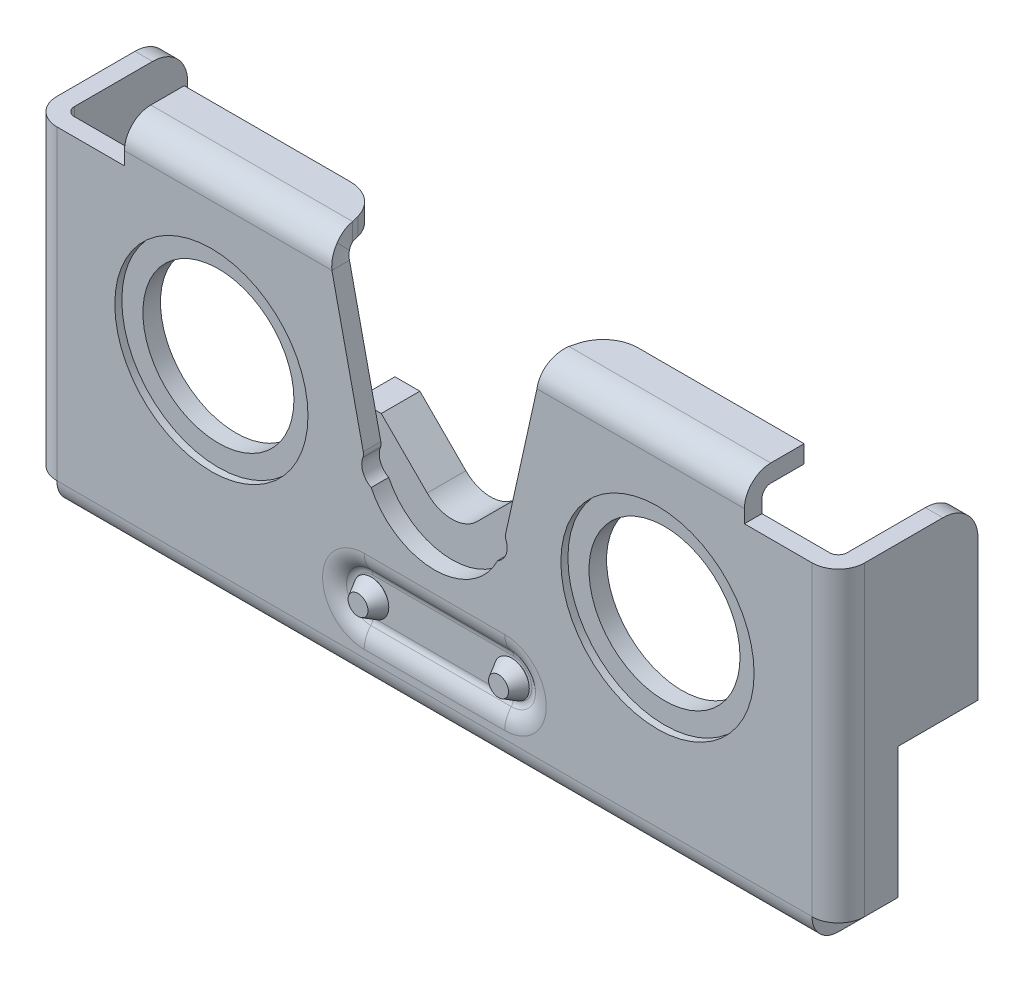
ISO-10303-21;
HEADER;
FILE_DESCRIPTION(('STEP AP214'),'2;1');
FILE_NAME('part.step','',(''),(''),'','','');
FILE_SCHEMA(('AUTOMOTIVE_DESIGN { 1 0 10303 214 1 1 1 1 }'));
ENDSEC;
DATA;
#1=APPLICATION_CONTEXT('core data for automotive mechanical design processes');
#2=APPLICATION_PROTOCOL_DEFINITION('international standard','automotive_design',2000,#1);
#3=PRODUCT_CONTEXT('',#1,'mechanical');
#4=PRODUCT('Part','Part','',(#3));
#5=PRODUCT_RELATED_PRODUCT_CATEGORY('part','',(#4));
#6=PRODUCT_DEFINITION_FORMATION('','',#4);
#7=PRODUCT_DEFINITION_CONTEXT('part definition',#1,'design');
#8=PRODUCT_DEFINITION('design','',#6,#7);
#9=PRODUCT_DEFINITION_SHAPE('','',#8);
#10=(LENGTH_UNIT() NAMED_UNIT(*) SI_UNIT(.MILLI.,.METRE.));
#11=(NAMED_UNIT(*) PLANE_ANGLE_UNIT() SI_UNIT($,.RADIAN.));
#12=(NAMED_UNIT(*) SI_UNIT($,.STERADIAN.) SOLID_ANGLE_UNIT());
#13=UNCERTAINTY_MEASURE_WITH_UNIT(LENGTH_MEASURE(1.E-05),#10,'distance_accuracy_value','');
#14=(GEOMETRIC_REPRESENTATION_CONTEXT(3) GLOBAL_UNCERTAINTY_ASSIGNED_CONTEXT((#13)) GLOBAL_UNIT_ASSIGNED_CONTEXT((#10,
#11,#12)) REPRESENTATION_CONTEXT('',''));
#15=CARTESIAN_POINT('',(0.,0.,0.));
#16=DIRECTION('',(0.,0.,1.));
#17=DIRECTION('',(1.,0.,0.));
#18=AXIS2_PLACEMENT_3D('',#15,#16,#17);
#19=CARTESIAN_POINT('',(-4.54030021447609,-0.311047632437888,-1.));
#20=DIRECTION('',(0.,0.,-1.));
#21=DIRECTION('',(-1.,0.,0.));
#22=AXIS2_PLACEMENT_3D('',#19,#20,#21);
#23=PLANE('',#22);
#24=CARTESIAN_POINT('',(12.7,0.,-1.));
#25=DIRECTION('',(0.,0.,-1.));
#26=DIRECTION('',(-1.,0.,0.));
#27=AXIS2_PLACEMENT_3D('',#24,#25,#26);
#28=CIRCLE('',#27,6.5);
#29=CARTESIAN_POINT('',(6.2,0.,-1.));
#30=VERTEX_POINT('',#29);
#31=EDGE_CURVE('E2608',#30,#30,#28,.F.);
#32=ORIENTED_EDGE('',*,*,#31,.T.);
#33=EDGE_LOOP('',(#32));
#34=FACE_BOUND('',#33,.T.);
#35=CARTESIAN_POINT('',(-12.7,0.,-1.));
#36=DIRECTION('',(0.,0.,-1.));
#37=DIRECTION('',(-1.,0.,0.));
#38=AXIS2_PLACEMENT_3D('',#35,#36,#37);
#39=CIRCLE('',#38,6.5);
#40=CARTESIAN_POINT('',(-19.2,0.,-1.));
#41=VERTEX_POINT('',#40);
#42=EDGE_CURVE('E2644',#41,#41,#39,.F.);
#43=ORIENTED_EDGE('',*,*,#42,.T.);
#44=EDGE_LOOP('',(#43));
#45=FACE_BOUND('',#44,.T.);
#46=CARTESIAN_POINT('',(4.,-7.55,-1.));
#47=DIRECTION('',(0.,0.,-1.));
#48=DIRECTION('',(-1.,0.,0.));
#49=AXIS2_PLACEMENT_3D('',#46,#47,#48);
#50=CIRCLE('',#49,2.75);
#51=CARTESIAN_POINT('',(4.,-10.3,-1.));
#52=VERTEX_POINT('',#51);
#53=CARTESIAN_POINT('',(5.14564392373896,-10.05,-1.));
#54=VERTEX_POINT('',#53);
#55=EDGE_CURVE('E812',#52,#54,#50,.F.);
#56=ORIENTED_EDGE('',*,*,#55,.T.);
#57=DIRECTION('',(-1.,0.,0.));
#58=VECTOR('',#57,1.);
#59=CARTESIAN_POINT('',(7.28301270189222,-10.05,-1.));
#60=LINE('',#59,#58);
#61=CARTESIAN_POINT('',(7.5,-10.05,-1.));
#62=VERTEX_POINT('',#61);
#63=EDGE_CURVE('E35',#54,#62,#60,.F.);
#64=ORIENTED_EDGE('',*,*,#63,.T.);
#65=DIRECTION('',(0.,1.,0.));
#66=VECTOR('',#65,1.);
#67=CARTESIAN_POINT('',(7.5,-10.8,-1.));
#68=LINE('',#67,#66);
#69=CARTESIAN_POINT('',(7.5,-5.0519798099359,-1.));
#70=VERTEX_POINT('',#69);
#71=EDGE_CURVE('E532',#62,#70,#68,.T.);
#72=ORIENTED_EDGE('',*,*,#71,.T.);
#73=CARTESIAN_POINT('',(12.7,0.,-1.));
#74=DIRECTION('',(0.,0.,-1.));
#75=DIRECTION('',(1.,0.,0.));
#76=AXIS2_PLACEMENT_3D('',#73,#74,#75);
#77=CIRCLE('',#76,7.25);
#78=CARTESIAN_POINT('',(5.45,0.,-1.));
#79=VERTEX_POINT('',#78);
#80=EDGE_CURVE('E536',#70,#79,#77,.T.);
#81=ORIENTED_EDGE('',*,*,#80,.T.);
#82=DIRECTION('',(0.,1.,0.));
#83=VECTOR('',#82,1.);
#84=CARTESIAN_POINT('',(5.45,0.,-1.));
#85=LINE('',#84,#83);
#86=CARTESIAN_POINT('',(5.45,1.2,-1.));
#87=VERTEX_POINT('',#86);
#88=EDGE_CURVE('E540',#79,#87,#85,.T.);
#89=ORIENTED_EDGE('',*,*,#88,.T.);
#90=DIRECTION('',(-1.,0.,0.));
#91=VECTOR('',#90,1.);
#92=CARTESIAN_POINT('',(5.45,1.2,-1.));
#93=LINE('',#92,#91);
#94=CARTESIAN_POINT('',(4.36315165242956,1.2,-1.));
#95=VERTEX_POINT('',#94);
#96=EDGE_CURVE('E545',#87,#95,#93,.T.);
#97=ORIENTED_EDGE('',*,*,#96,.T.);
#98=DIRECTION('',(0.216439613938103,0.976296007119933,0.));
#99=VECTOR('',#98,1.);
#100=CARTESIAN_POINT('',(4.05215221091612,-0.202827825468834,-1.));
#101=LINE('',#100,#99);
#102=CARTESIAN_POINT('',(5.83742115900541,7.85000000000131,-1.));
#103=VERTEX_POINT('',#102);
#104=EDGE_CURVE('E1824',#103,#95,#101,.F.);
#105=ORIENTED_EDGE('',*,*,#104,.F.);
#106=DIRECTION('',(-1.,0.,0.));
#107=VECTOR('',#106,1.);
#108=CARTESIAN_POINT('',(17.65,7.85000000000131,-1.));
#109=LINE('',#108,#107);
#110=CARTESIAN_POINT('',(17.65,7.85000000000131,-1.));
#111=VERTEX_POINT('',#110);
#112=EDGE_CURVE('E1984',#111,#103,#109,.T.);
#113=ORIENTED_EDGE('',*,*,#112,.F.);
#114=DIRECTION('',(0.,-1.,0.));
#115=VECTOR('',#114,1.);
#116=CARTESIAN_POINT('',(17.65,9.35,-1.));
#117=LINE('',#116,#115);
#118=CARTESIAN_POINT('',(17.65,7.1,-1.));
#119=VERTEX_POINT('',#118);
#120=EDGE_CURVE('E1981',#119,#111,#117,.F.);
#121=ORIENTED_EDGE('',*,*,#120,.F.);
#122=DIRECTION('',(1.,0.,0.));
#123=VECTOR('',#122,1.);
#124=CARTESIAN_POINT('',(17.65,7.1,-1.));
#125=LINE('',#124,#123);
#126=CARTESIAN_POINT('',(21.5,7.1,-1.));
#127=VERTEX_POINT('',#126);
#128=EDGE_CURVE('E1931',#127,#119,#125,.F.);
#129=ORIENTED_EDGE('',*,*,#128,.F.);
#130=DIRECTION('',(0.,1.,0.));
#131=VECTOR('',#130,1.);
#132=CARTESIAN_POINT('',(21.5,-10.35,-1.));
#133=LINE('',#132,#131);
#134=CARTESIAN_POINT('',(21.5,-10.35,-1.));
#135=VERTEX_POINT('',#134);
#136=EDGE_CURVE('E2718',#135,#127,#133,.T.);
#137=ORIENTED_EDGE('',*,*,#136,.F.);
#138=DIRECTION('',(1.,0.,0.));
#139=VECTOR('',#138,1.);
#140=CARTESIAN_POINT('',(-21.5,-10.35,-1.));
#141=LINE('',#140,#139);
#142=CARTESIAN_POINT('',(-21.5,-10.35,-1.));
#143=VERTEX_POINT('',#142);
#144=EDGE_CURVE('E2193',#143,#135,#141,.T.);
#145=ORIENTED_EDGE('',*,*,#144,.F.);
#146=DIRECTION('',(0.,-1.,0.));
#147=VECTOR('',#146,1.);
#148=CARTESIAN_POINT('',(-21.5,7.1,-1.));
#149=LINE('',#148,#147);
#150=CARTESIAN_POINT('',(-21.5,7.1,-1.));
#151=VERTEX_POINT('',#150);
#152=EDGE_CURVE('E2717',#151,#143,#149,.T.);
#153=ORIENTED_EDGE('',*,*,#152,.F.);
#154=DIRECTION('',(1.,0.,0.));
#155=VECTOR('',#154,1.);
#156=CARTESIAN_POINT('',(-23.,7.1,-1.));
#157=LINE('',#156,#155);
#158=CARTESIAN_POINT('',(-17.65,7.1,-1.));
#159=VERTEX_POINT('',#158);
#160=EDGE_CURVE('E2522',#159,#151,#157,.F.);
#161=ORIENTED_EDGE('',*,*,#160,.F.);
#162=DIRECTION('',(0.,1.,0.));
#163=VECTOR('',#162,1.);
#164=CARTESIAN_POINT('',(-17.65,7.1,-1.));
#165=LINE('',#164,#163);
#166=CARTESIAN_POINT('',(-17.65,7.84999999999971,-1.));
#167=VERTEX_POINT('',#166);
#168=EDGE_CURVE('E1884',#167,#159,#165,.F.);
#169=ORIENTED_EDGE('',*,*,#168,.F.);
#170=DIRECTION('',(-1.,0.,0.));
#171=VECTOR('',#170,1.);
#172=CARTESIAN_POINT('',(-5.83742115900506,7.84999999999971,-1.));
#173=LINE('',#172,#171);
#174=CARTESIAN_POINT('',(-5.83742115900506,7.84999999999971,-1.));
#175=VERTEX_POINT('',#174);
#176=EDGE_CURVE('E1880',#175,#167,#173,.T.);
#177=ORIENTED_EDGE('',*,*,#176,.F.);
#178=DIRECTION('',(0.216439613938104,-0.976296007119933,0.));
#179=VECTOR('',#178,1.);
#180=CARTESIAN_POINT('',(-6.16996315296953,9.35,-1.));
#181=LINE('',#180,#179);
#182=CARTESIAN_POINT('',(-4.36315165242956,1.2,-1.));
#183=VERTEX_POINT('',#182);
#184=EDGE_CURVE('E20',#183,#175,#181,.F.);
#185=ORIENTED_EDGE('',*,*,#184,.F.);
#186=DIRECTION('',(-1.,0.,0.));
#187=VECTOR('',#186,1.);
#188=CARTESIAN_POINT('',(-4.02842712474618,1.2,-1.));
#189=LINE('',#188,#187);
#190=CARTESIAN_POINT('',(-5.45,1.2,-1.));
#191=VERTEX_POINT('',#190);
#192=EDGE_CURVE('E561',#183,#191,#189,.T.);
#193=ORIENTED_EDGE('',*,*,#192,.T.);
#194=DIRECTION('',(0.,-1.,0.));
#195=VECTOR('',#194,1.);
#196=CARTESIAN_POINT('',(-5.45,1.2,-1.));
#197=LINE('',#196,#195);
#198=CARTESIAN_POINT('',(-5.45,0.,-1.));
#199=VERTEX_POINT('',#198);
#200=EDGE_CURVE('E491',#191,#199,#197,.T.);
#201=ORIENTED_EDGE('',*,*,#200,.T.);
#202=CARTESIAN_POINT('',(-12.7,0.,-1.));
#203=DIRECTION('',(0.,0.,-1.));
#204=DIRECTION('',(1.,0.,0.));
#205=AXIS2_PLACEMENT_3D('',#202,#203,#204);
#206=CIRCLE('',#205,7.25);
#207=CARTESIAN_POINT('',(-7.5,-5.0519798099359,-1.));
#208=VERTEX_POINT('',#207);
#209=EDGE_CURVE('E482',#199,#208,#206,.T.);
#210=ORIENTED_EDGE('',*,*,#209,.T.);
#211=DIRECTION('',(0.,-1.,0.));
#212=VECTOR('',#211,1.);
#213=CARTESIAN_POINT('',(-7.5,-5.0519798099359,-1.));
#214=LINE('',#213,#212);
#215=CARTESIAN_POINT('',(-7.5,-10.05,-1.));
#216=VERTEX_POINT('',#215);
#217=EDGE_CURVE('E460',#208,#216,#214,.T.);
#218=ORIENTED_EDGE('',*,*,#217,.T.);
#219=CARTESIAN_POINT('',(-5.14564392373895,-10.05,-1.));
#220=VERTEX_POINT('',#219);
#221=EDGE_CURVE('E621',#216,#220,#60,.F.);
#222=ORIENTED_EDGE('',*,*,#221,.T.);
#223=CARTESIAN_POINT('',(-4.,-7.55,-1.));
#224=DIRECTION('',(0.,0.,-1.));
#225=DIRECTION('',(-1.,0.,0.));
#226=AXIS2_PLACEMENT_3D('',#223,#224,#225);
#227=CIRCLE('',#226,2.75);
#228=CARTESIAN_POINT('',(-4.,-10.3,-1.));
#229=VERTEX_POINT('',#228);
#230=EDGE_CURVE('E805',#220,#229,#227,.F.);
#231=ORIENTED_EDGE('',*,*,#230,.T.);
#232=DIRECTION('',(1.,0.,0.));
#233=VECTOR('',#232,1.);
#234=CARTESIAN_POINT('',(-4.54030021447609,-10.3,-1.));
#235=LINE('',#234,#233);
#236=EDGE_CURVE('E808',#229,#52,#235,.T.);
#237=ORIENTED_EDGE('',*,*,#236,.T.);
#238=EDGE_LOOP('',(#56,#64,#72,#81,#89,#97,#105,#113,#121,#129,#137,#145,#153,#161,#169,#177,
#185,#193,#201,#210,#218,#222,#231,#237));
#239=FACE_BOUND('',#238,.T.);
#240=ADVANCED_FACE('F16',(#34,#45,#239),#23,.T.);
#241=CARTESIAN_POINT('',(-4.54030021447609,-0.311047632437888,0.));
#242=DIRECTION('',(0.,0.,-1.));
#243=DIRECTION('',(-1.,0.,0.));
#244=AXIS2_PLACEMENT_3D('',#241,#242,#243);
#245=PLANE('',#244);
#246=DIRECTION('',(1.,0.,0.));
#247=VECTOR('',#246,1.);
#248=CARTESIAN_POINT('',(-4.54030021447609,-5.18196601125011,0.));
#249=LINE('',#248,#247);
#250=CARTESIAN_POINT('',(-4.,-5.18196601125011,0.));
#251=VERTEX_POINT('',#250);
#252=CARTESIAN_POINT('',(4.,-5.18196601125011,0.));
#253=VERTEX_POINT('',#252);
#254=EDGE_CURVE('E831',#251,#253,#249,.T.);
#255=ORIENTED_EDGE('',*,*,#254,.T.);
#256=CARTESIAN_POINT('',(4.,-7.55,0.));
#257=DIRECTION('',(0.,0.,-1.));
#258=DIRECTION('',(-1.,0.,0.));
#259=AXIS2_PLACEMENT_3D('',#256,#257,#258);
#260=CIRCLE('',#259,2.36803398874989);
#261=CARTESIAN_POINT('',(4.,-9.91803398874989,0.));
#262=VERTEX_POINT('',#261);
#263=EDGE_CURVE('E834',#253,#262,#260,.T.);
#264=ORIENTED_EDGE('',*,*,#263,.T.);
#265=DIRECTION('',(-1.,0.,0.));
#266=VECTOR('',#265,1.);
#267=CARTESIAN_POINT('',(-4.54030021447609,-9.91803398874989,0.));
#268=LINE('',#267,#266);
#269=CARTESIAN_POINT('',(-4.,-9.91803398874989,0.));
#270=VERTEX_POINT('',#269);
#271=EDGE_CURVE('E827',#262,#270,#268,.T.);
#272=ORIENTED_EDGE('',*,*,#271,.T.);
#273=CARTESIAN_POINT('',(-4.,-7.55,0.));
#274=DIRECTION('',(0.,0.,-1.));
#275=DIRECTION('',(-1.,0.,0.));
#276=AXIS2_PLACEMENT_3D('',#273,#274,#275);
#277=CIRCLE('',#276,2.36803398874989);
#278=EDGE_CURVE('E816',#270,#251,#277,.T.);
#279=ORIENTED_EDGE('',*,*,#278,.T.);
#280=EDGE_LOOP('',(#255,#264,#272,#279));
#281=FACE_BOUND('',#280,.T.);
#282=DIRECTION('',(1.,0.,0.));
#283=VECTOR('',#282,1.);
#284=CARTESIAN_POINT('',(-23.,7.1,0.));
#285=LINE('',#284,#283);
#286=CARTESIAN_POINT('',(-17.65,7.1,0.));
#287=VERTEX_POINT('',#286);
#288=CARTESIAN_POINT('',(-21.5,7.1,0.));
#289=VERTEX_POINT('',#288);
#290=EDGE_CURVE('E2526',#287,#289,#285,.F.);
#291=ORIENTED_EDGE('',*,*,#290,.T.);
#292=DIRECTION('',(0.,-1.,0.));
#293=VECTOR('',#292,1.);
#294=CARTESIAN_POINT('',(-21.5,7.1,0.));
#295=LINE('',#294,#293);
#296=CARTESIAN_POINT('',(-21.5,-10.35,0.));
#297=VERTEX_POINT('',#296);
#298=EDGE_CURVE('E2705',#289,#297,#295,.T.);
#299=ORIENTED_EDGE('',*,*,#298,.T.);
#300=DIRECTION('',(1.,0.,0.));
#301=VECTOR('',#300,1.);
#302=CARTESIAN_POINT('',(-21.5,-10.35,0.));
#303=LINE('',#302,#301);
#304=CARTESIAN_POINT('',(21.5,-10.35,0.));
#305=VERTEX_POINT('',#304);
#306=EDGE_CURVE('E2918',#297,#305,#303,.T.);
#307=ORIENTED_EDGE('',*,*,#306,.T.);
#308=DIRECTION('',(0.,1.,0.));
#309=VECTOR('',#308,1.);
#310=CARTESIAN_POINT('',(21.5,-10.35,0.));
#311=LINE('',#310,#309);
#312=CARTESIAN_POINT('',(21.5,7.1,0.));
#313=VERTEX_POINT('',#312);
#314=EDGE_CURVE('E1988',#305,#313,#311,.T.);
#315=ORIENTED_EDGE('',*,*,#314,.T.);
#316=DIRECTION('',(1.,0.,0.));
#317=VECTOR('',#316,1.);
#318=CARTESIAN_POINT('',(17.65,7.1,0.));
#319=LINE('',#318,#317);
#320=CARTESIAN_POINT('',(17.65,7.1,0.));
#321=VERTEX_POINT('',#320);
#322=EDGE_CURVE('E2443',#313,#321,#319,.F.);
#323=ORIENTED_EDGE('',*,*,#322,.T.);
#324=DIRECTION('',(0.,-1.,0.));
#325=VECTOR('',#324,1.);
#326=CARTESIAN_POINT('',(17.65,9.35,0.));
#327=LINE('',#326,#325);
#328=CARTESIAN_POINT('',(17.65,7.85000000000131,0.));
#329=VERTEX_POINT('',#328);
#330=EDGE_CURVE('E2439',#321,#329,#327,.F.);
#331=ORIENTED_EDGE('',*,*,#330,.T.);
#332=DIRECTION('',(-1.,0.,0.));
#333=VECTOR('',#332,1.);
#334=CARTESIAN_POINT('',(17.65,7.85000000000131,0.));
#335=LINE('',#334,#333);
#336=CARTESIAN_POINT('',(5.83742115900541,7.85000000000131,0.));
#337=VERTEX_POINT('',#336);
#338=EDGE_CURVE('E1956',#329,#337,#335,.T.);
#339=ORIENTED_EDGE('',*,*,#338,.T.);
#340=DIRECTION('',(0.216439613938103,0.976296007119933,0.));
#341=VECTOR('',#340,1.);
#342=CARTESIAN_POINT('',(4.05215221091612,-0.202827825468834,0.));
#343=LINE('',#342,#341);
#344=CARTESIAN_POINT('',(4.05215221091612,-0.202827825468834,0.));
#345=VERTEX_POINT('',#344);
#346=EDGE_CURVE('E2436',#337,#345,#343,.F.);
#347=ORIENTED_EDGE('',*,*,#346,.T.);
#348=CARTESIAN_POINT('',(4.54030021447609,-0.311047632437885,0.));
#349=DIRECTION('',(0.,0.,-1.));
#350=DIRECTION('',(1.,0.,0.));
#351=AXIS2_PLACEMENT_3D('',#348,#349,#350);
#352=CIRCLE('',#351,0.5);
#353=CARTESIAN_POINT('',(4.07368946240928,-0.490698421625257,0.));
#354=VERTEX_POINT('',#353);
#355=EDGE_CURVE('E1922',#354,#345,#352,.T.);
#356=ORIENTED_EDGE('',*,*,#355,.F.);
#357=CARTESIAN_POINT('',(3.14046795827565,-0.85,0.));
#358=DIRECTION('',(0.,0.,1.));
#359=DIRECTION('',(1.,0.,0.));
#360=AXIS2_PLACEMENT_3D('',#357,#358,#359);
#361=CIRCLE('',#360,1.);
#362=CARTESIAN_POINT('',(3.60348253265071,-1.73635066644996,0.));
#363=VERTEX_POINT('',#362);
#364=EDGE_CURVE('E1914',#363,#354,#361,.T.);
#365=ORIENTED_EDGE('',*,*,#364,.F.);
#366=CARTESIAN_POINT('',(0.,0.,0.));
#367=DIRECTION('',(0.,0.,1.));
#368=DIRECTION('',(1.,0.,0.));
#369=AXIS2_PLACEMENT_3D('',#366,#367,#368);
#370=CIRCLE('',#369,4.);
#371=CARTESIAN_POINT('',(-3.60348253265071,-1.73635066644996,0.));
#372=VERTEX_POINT('',#371);
#373=EDGE_CURVE('E2671',#363,#372,#370,.F.);
#374=ORIENTED_EDGE('',*,*,#373,.T.);
#375=CARTESIAN_POINT('',(-3.14046795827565,-0.85,0.));
#376=DIRECTION('',(0.,0.,1.));
#377=DIRECTION('',(1.,0.,0.));
#378=AXIS2_PLACEMENT_3D('',#375,#376,#377);
#379=CIRCLE('',#378,1.);
#380=CARTESIAN_POINT('',(-4.07368946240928,-0.490698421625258,0.));
#381=VERTEX_POINT('',#380);
#382=EDGE_CURVE('E1901',#381,#372,#379,.T.);
#383=ORIENTED_EDGE('',*,*,#382,.F.);
#384=CARTESIAN_POINT('',(-4.54030021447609,-0.311047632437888,0.));
#385=DIRECTION('',(0.,0.,-1.));
#386=DIRECTION('',(1.,0.,0.));
#387=AXIS2_PLACEMENT_3D('',#384,#385,#386);
#388=CIRCLE('',#387,0.5);
#389=CARTESIAN_POINT('',(-4.05215221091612,-0.202827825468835,0.));
#390=VERTEX_POINT('',#389);
#391=EDGE_CURVE('E1895',#390,#381,#388,.T.);
#392=ORIENTED_EDGE('',*,*,#391,.F.);
#393=DIRECTION('',(0.216439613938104,-0.976296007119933,0.));
#394=VECTOR('',#393,1.);
#395=CARTESIAN_POINT('',(-6.16996315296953,9.35,0.));
#396=LINE('',#395,#394);
#397=CARTESIAN_POINT('',(-5.83742115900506,7.84999999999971,0.));
#398=VERTEX_POINT('',#397);
#399=EDGE_CURVE('E1971',#390,#398,#396,.F.);
#400=ORIENTED_EDGE('',*,*,#399,.T.);
#401=DIRECTION('',(-1.,0.,0.));
#402=VECTOR('',#401,1.);
#403=CARTESIAN_POINT('',(-5.83742115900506,7.84999999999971,0.));
#404=LINE('',#403,#402);
#405=CARTESIAN_POINT('',(-17.65,7.84999999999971,0.));
#406=VERTEX_POINT('',#405);
#407=EDGE_CURVE('E1942',#398,#406,#404,.T.);
#408=ORIENTED_EDGE('',*,*,#407,.T.);
#409=DIRECTION('',(0.,1.,0.));
#410=VECTOR('',#409,1.);
#411=CARTESIAN_POINT('',(-17.65,7.1,0.));
#412=LINE('',#411,#410);
#413=EDGE_CURVE('E1975',#406,#287,#412,.F.);
#414=ORIENTED_EDGE('',*,*,#413,.T.);
#415=EDGE_LOOP('',(#291,#299,#307,#315,#323,#331,#339,#347,#356,#365,#374,#383,#392,#400,#408,#414));
#416=FACE_BOUND('',#415,.T.);
#417=CARTESIAN_POINT('',(-12.7,0.,0.));
#418=DIRECTION('',(0.,0.,1.));
#419=DIRECTION('',(1.,0.,0.));
#420=AXIS2_PLACEMENT_3D('',#417,#418,#419);
#421=CIRCLE('',#420,5.5);
#422=CARTESIAN_POINT('',(-7.2,0.,0.));
#423=VERTEX_POINT('',#422);
#424=EDGE_CURVE('E2611',#423,#423,#421,.T.);
#425=ORIENTED_EDGE('',*,*,#424,.F.);
#426=EDGE_LOOP('',(#425));
#427=FACE_BOUND('',#426,.T.);
#428=CARTESIAN_POINT('',(12.7,0.,0.));
#429=DIRECTION('',(0.,0.,1.));
#430=DIRECTION('',(1.,0.,0.));
#431=AXIS2_PLACEMENT_3D('',#428,#429,#430);
#432=CIRCLE('',#431,5.5);
#433=CARTESIAN_POINT('',(18.2,0.,0.));
#434=VERTEX_POINT('',#433);
#435=EDGE_CURVE('E1947',#434,#434,#432,.T.);
#436=ORIENTED_EDGE('',*,*,#435,.F.);
#437=EDGE_LOOP('',(#436));
#438=FACE_BOUND('',#437,.T.);
#439=ADVANCED_FACE('F694',(#281,#416,#427,#438),#245,.F.);
#440=CARTESIAN_POINT('',(-21.5,-11.85,-0.848119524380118));
#441=DIRECTION('',(1.,0.,0.));
#442=DIRECTION('',(0.,1.,0.));
#443=AXIS2_PLACEMENT_3D('',#440,#441,#442);
#444=PLANE('',#443);
#445=DIRECTION('',(0.,0.,1.));
#446=VECTOR('',#445,1.);
#447=CARTESIAN_POINT('',(-21.5,-10.35,0.));
#448=LINE('',#447,#446);
#449=EDGE_CURVE('E2725',#143,#297,#448,.T.);
#450=ORIENTED_EDGE('',*,*,#449,.F.);
#451=CARTESIAN_POINT('',(-21.5,-10.35,-1.5));
#452=DIRECTION('',(1.,0.,0.));
#453=DIRECTION('',(0.,1.,0.));
#454=AXIS2_PLACEMENT_3D('',#451,#452,#453);
#455=CIRCLE('',#454,0.5);
#456=CARTESIAN_POINT('',(-21.5,-10.85,-1.5));
#457=VERTEX_POINT('',#456);
#458=EDGE_CURVE('E2925',#457,#143,#455,.F.);
#459=ORIENTED_EDGE('',*,*,#458,.F.);
#460=DIRECTION('',(0.,0.,-1.));
#461=VECTOR('',#460,1.);
#462=CARTESIAN_POINT('',(-21.5,-10.85,-0.848119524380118));
#463=LINE('',#462,#461);
#464=CARTESIAN_POINT('',(-21.5,-10.85,-3.39999999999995));
#465=VERTEX_POINT('',#464);
#466=EDGE_CURVE('E2214',#457,#465,#463,.T.);
#467=ORIENTED_EDGE('',*,*,#466,.T.);
#468=DIRECTION('',(0.,1.,0.));
#469=VECTOR('',#468,1.);
#470=CARTESIAN_POINT('',(-21.5,-11.85,-3.39999999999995));
#471=LINE('',#470,#469);
#472=CARTESIAN_POINT('',(-21.5,-11.85,-3.39999999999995));
#473=VERTEX_POINT('',#472);
#474=EDGE_CURVE('E2226',#473,#465,#471,.T.);
#475=ORIENTED_EDGE('',*,*,#474,.F.);
#476=DIRECTION('',(0.,0.,-1.));
#477=VECTOR('',#476,1.);
#478=CARTESIAN_POINT('',(-21.5,-11.85,-0.848119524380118));
#479=LINE('',#478,#477);
#480=CARTESIAN_POINT('',(-21.5,-11.85,-1.5));
#481=VERTEX_POINT('',#480);
#482=EDGE_CURVE('E2204',#481,#473,#479,.T.);
#483=ORIENTED_EDGE('',*,*,#482,.F.);
#484=CARTESIAN_POINT('',(-21.5,-10.35,-1.5));
#485=DIRECTION('',(-1.,0.,0.));
#486=DIRECTION('',(0.,0.,-1.));
#487=AXIS2_PLACEMENT_3D('',#484,#485,#486);
#488=CIRCLE('',#487,1.5);
#489=EDGE_CURVE('E2203',#481,#297,#488,.T.);
#490=ORIENTED_EDGE('',*,*,#489,.T.);
#491=EDGE_LOOP('',(#450,#459,#467,#475,#483,#490));
#492=FACE_BOUND('',#491,.T.);
#493=ADVANCED_FACE('F701',(#492),#444,.F.);
#494=CARTESIAN_POINT('',(-23.,7.1,-1.));
#495=DIRECTION('',(0.,-1.,0.));
#496=DIRECTION('',(1.,0.,0.));
#497=AXIS2_PLACEMENT_3D('',#494,#495,#496);
#498=PLANE('',#497);
#499=DIRECTION('',(0.,0.,1.));
#500=VECTOR('',#499,1.);
#501=CARTESIAN_POINT('',(-22.,7.1000000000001,-7.95));
#502=LINE('',#501,#500);
#503=CARTESIAN_POINT('',(-22.,7.10000000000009,-5.95));
#504=VERTEX_POINT('',#503);
#505=CARTESIAN_POINT('',(-22.,7.1,-1.5));
#506=VERTEX_POINT('',#505);
#507=EDGE_CURVE('E2893',#504,#506,#502,.T.);
#508=ORIENTED_EDGE('',*,*,#507,.F.);
#509=DIRECTION('',(1.,0.,0.));
#510=VECTOR('',#509,1.);
#511=CARTESIAN_POINT('',(-23.,7.1,-5.95));
#512=LINE('',#511,#510);
#513=CARTESIAN_POINT('',(-23.,7.10000000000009,-5.95));
#514=VERTEX_POINT('',#513);
#515=EDGE_CURVE('E799',#504,#514,#512,.F.);
#516=ORIENTED_EDGE('',*,*,#515,.T.);
#517=DIRECTION('',(0.,0.,1.));
#518=VECTOR('',#517,1.);
#519=CARTESIAN_POINT('',(-23.,7.10000000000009,-7.95));
#520=LINE('',#519,#518);
#521=CARTESIAN_POINT('',(-23.,7.1,-1.5));
#522=VERTEX_POINT('',#521);
#523=EDGE_CURVE('E2722',#514,#522,#520,.T.);
#524=ORIENTED_EDGE('',*,*,#523,.T.);
#525=CARTESIAN_POINT('',(-21.5,7.1,-1.5));
#526=DIRECTION('',(0.,-1.,0.));
#527=DIRECTION('',(0.,0.,-1.));
#528=AXIS2_PLACEMENT_3D('',#525,#526,#527);
#529=CIRCLE('',#528,1.5);
#530=EDGE_CURVE('E2713',#289,#522,#529,.T.);
#531=ORIENTED_EDGE('',*,*,#530,.F.);
#532=ORIENTED_EDGE('',*,*,#290,.F.);
#533=DIRECTION('',(0.,0.,1.));
#534=VECTOR('',#533,1.);
#535=CARTESIAN_POINT('',(-17.65,7.1,-1.));
#536=LINE('',#535,#534);
#537=EDGE_CURVE('E1938',#287,#159,#536,.F.);
#538=ORIENTED_EDGE('',*,*,#537,.T.);
#539=ORIENTED_EDGE('',*,*,#160,.T.);
#540=CARTESIAN_POINT('',(-21.5,7.1,-1.5));
#541=DIRECTION('',(0.,-1.,0.));
#542=DIRECTION('',(0.,0.,-1.));
#543=AXIS2_PLACEMENT_3D('',#540,#541,#542);
#544=CIRCLE('',#543,0.5);
#545=EDGE_CURVE('E2733',#151,#506,#544,.T.);
#546=ORIENTED_EDGE('',*,*,#545,.T.);
#547=EDGE_LOOP('',(#508,#516,#524,#531,#532,#538,#539,#546));
#548=FACE_BOUND('',#547,.T.);
#549=ADVANCED_FACE('F714',(#548),#498,.F.);
#550=CARTESIAN_POINT('',(17.65,7.1,-1.));
#551=DIRECTION('',(0.,-1.,0.));
#552=DIRECTION('',(1.,0.,0.));
#553=AXIS2_PLACEMENT_3D('',#550,#551,#552);
#554=PLANE('',#553);
#555=DIRECTION('',(0.,0.,1.));
#556=VECTOR('',#555,1.);
#557=CARTESIAN_POINT('',(23.,7.1,-7.95));
#558=LINE('',#557,#556);
#559=CARTESIAN_POINT('',(23.,7.1,-5.95));
#560=VERTEX_POINT('',#559);
#561=CARTESIAN_POINT('',(23.,7.1,-1.5));
#562=VERTEX_POINT('',#561);
#563=EDGE_CURVE('E2851',#560,#562,#558,.T.);
#564=ORIENTED_EDGE('',*,*,#563,.F.);
#565=DIRECTION('',(-1.,0.,0.));
#566=VECTOR('',#565,1.);
#567=CARTESIAN_POINT('',(17.65,7.1,-5.95));
#568=LINE('',#567,#566);
#569=CARTESIAN_POINT('',(22.,7.1,-5.95));
#570=VERTEX_POINT('',#569);
#571=EDGE_CURVE('E779',#560,#570,#568,.T.);
#572=ORIENTED_EDGE('',*,*,#571,.T.);
#573=DIRECTION('',(0.,0.,1.));
#574=VECTOR('',#573,1.);
#575=CARTESIAN_POINT('',(22.,7.1,-7.95));
#576=LINE('',#575,#574);
#577=CARTESIAN_POINT('',(22.,7.1,-1.5));
#578=VERTEX_POINT('',#577);
#579=EDGE_CURVE('E2163',#570,#578,#576,.T.);
#580=ORIENTED_EDGE('',*,*,#579,.T.);
#581=CARTESIAN_POINT('',(21.5,7.1,-1.5));
#582=DIRECTION('',(0.,1.,0.));
#583=DIRECTION('',(0.,0.,1.));
#584=AXIS2_PLACEMENT_3D('',#581,#582,#583);
#585=CIRCLE('',#584,0.5);
#586=EDGE_CURVE('E2821',#578,#127,#585,.F.);
#587=ORIENTED_EDGE('',*,*,#586,.T.);
#588=ORIENTED_EDGE('',*,*,#128,.T.);
#589=DIRECTION('',(0.,0.,1.));
#590=VECTOR('',#589,1.);
#591=CARTESIAN_POINT('',(17.65,7.1,-1.));
#592=LINE('',#591,#590);
#593=EDGE_CURVE('E1925',#321,#119,#592,.F.);
#594=ORIENTED_EDGE('',*,*,#593,.F.);
#595=ORIENTED_EDGE('',*,*,#322,.F.);
#596=CARTESIAN_POINT('',(21.5,7.1,-1.5));
#597=DIRECTION('',(0.,-1.,0.));
#598=DIRECTION('',(0.,0.,-1.));
#599=AXIS2_PLACEMENT_3D('',#596,#597,#598);
#600=CIRCLE('',#599,1.5);
#601=EDGE_CURVE('E2820',#562,#313,#600,.T.);
#602=ORIENTED_EDGE('',*,*,#601,.F.);
#603=EDGE_LOOP('',(#564,#572,#580,#587,#588,#594,#595,#602));
#604=FACE_BOUND('',#603,.T.);
#605=ADVANCED_FACE('F710',(#604),#554,.F.);
#606=CARTESIAN_POINT('',(4.05215221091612,-0.202827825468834,-1.));
#607=DIRECTION('',(0.976296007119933,-0.216439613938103,0.));
#608=DIRECTION('',(0.216439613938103,0.976296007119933,0.));
#609=AXIS2_PLACEMENT_3D('',#606,#607,#608);
#610=PLANE('',#609);
#611=DIRECTION('',(0.,0.,1.));
#612=VECTOR('',#611,1.);
#613=CARTESIAN_POINT('',(5.83742115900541,7.85000000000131,-1.));
#614=LINE('',#613,#612);
#615=EDGE_CURVE('E1991',#103,#337,#614,.T.);
#616=ORIENTED_EDGE('',*,*,#615,.F.);
#617=ORIENTED_EDGE('',*,*,#104,.T.);
#618=DIRECTION('',(0.216439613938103,0.976296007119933,0.));
#619=VECTOR('',#618,1.);
#620=CARTESIAN_POINT('',(4.05215221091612,-0.202827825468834,-1.));
#621=LINE('',#620,#619);
#622=CARTESIAN_POINT('',(4.05215221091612,-0.202827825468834,-1.));
#623=VERTEX_POINT('',#622);
#624=EDGE_CURVE('E648',#95,#623,#621,.F.);
#625=ORIENTED_EDGE('',*,*,#624,.T.);
#626=DIRECTION('',(0.,0.,1.));
#627=VECTOR('',#626,1.);
#628=CARTESIAN_POINT('',(4.05215221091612,-0.202827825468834,-1.));
#629=LINE('',#628,#627);
#630=EDGE_CURVE('E1918',#623,#345,#629,.T.);
#631=ORIENTED_EDGE('',*,*,#630,.T.);
#632=ORIENTED_EDGE('',*,*,#346,.F.);
#633=EDGE_LOOP('',(#616,#617,#625,#631,#632));
#634=FACE_BOUND('',#633,.T.);
#635=ADVANCED_FACE('F713',(#634),#610,.F.);
#636=CARTESIAN_POINT('',(17.65,9.35,-1.));
#637=DIRECTION('',(-1.,0.,0.));
#638=DIRECTION('',(0.,0.,1.));
#639=AXIS2_PLACEMENT_3D('',#636,#637,#638);
#640=PLANE('',#639);
#641=ORIENTED_EDGE('',*,*,#120,.T.);
#642=CARTESIAN_POINT('',(17.65,7.85000000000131,-1.5));
#643=DIRECTION('',(-1.,0.,0.));
#644=DIRECTION('',(0.,0.,1.));
#645=AXIS2_PLACEMENT_3D('',#642,#643,#644);
#646=CIRCLE('',#645,0.5);
#647=CARTESIAN_POINT('',(17.65,8.35000000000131,-1.5));
#648=VERTEX_POINT('',#647);
#649=EDGE_CURVE('E2280',#111,#648,#646,.T.);
#650=ORIENTED_EDGE('',*,*,#649,.T.);
#651=DIRECTION('',(0.,0.,1.));
#652=VECTOR('',#651,1.);
#653=CARTESIAN_POINT('',(17.65,8.35000000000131,-3.4));
#654=LINE('',#653,#652);
#655=CARTESIAN_POINT('',(17.65,8.35000000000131,-3.4));
#656=VERTEX_POINT('',#655);
#657=EDGE_CURVE('E2343',#656,#648,#654,.T.);
#658=ORIENTED_EDGE('',*,*,#657,.F.);
#659=DIRECTION('',(0.,-1.,0.));
#660=VECTOR('',#659,1.);
#661=CARTESIAN_POINT('',(17.65,9.35000000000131,-3.4));
#662=LINE('',#661,#660);
#663=CARTESIAN_POINT('',(17.65,9.35000000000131,-3.4));
#664=VERTEX_POINT('',#663);
#665=EDGE_CURVE('E1997',#664,#656,#662,.T.);
#666=ORIENTED_EDGE('',*,*,#665,.F.);
#667=DIRECTION('',(0.,0.,1.));
#668=VECTOR('',#667,1.);
#669=CARTESIAN_POINT('',(17.65,9.35000000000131,-3.4));
#670=LINE('',#669,#668);
#671=CARTESIAN_POINT('',(17.65,9.35000000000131,-1.5));
#672=VERTEX_POINT('',#671);
#673=EDGE_CURVE('E2336',#664,#672,#670,.T.);
#674=ORIENTED_EDGE('',*,*,#673,.T.);
#675=CARTESIAN_POINT('',(17.65,7.85000000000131,-1.5));
#676=DIRECTION('',(-1.,0.,0.));
#677=DIRECTION('',(0.,0.,-1.));
#678=AXIS2_PLACEMENT_3D('',#675,#676,#677);
#679=CIRCLE('',#678,1.5);
#680=EDGE_CURVE('E2269',#329,#672,#679,.T.);
#681=ORIENTED_EDGE('',*,*,#680,.F.);
#682=ORIENTED_EDGE('',*,*,#330,.F.);
#683=ORIENTED_EDGE('',*,*,#593,.T.);
#684=EDGE_LOOP('',(#641,#650,#658,#666,#674,#681,#682,#683));
#685=FACE_BOUND('',#684,.T.);
#686=ADVANCED_FACE('F716',(#685),#640,.F.);
#687=CARTESIAN_POINT('',(-17.65,7.1,-1.));
#688=DIRECTION('',(1.,0.,0.));
#689=DIRECTION('',(0.,0.,-1.));
#690=AXIS2_PLACEMENT_3D('',#687,#688,#689);
#691=PLANE('',#690);
#692=ORIENTED_EDGE('',*,*,#413,.F.);
#693=CARTESIAN_POINT('',(-17.65,7.84999999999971,-1.5));
#694=DIRECTION('',(1.,0.,0.));
#695=DIRECTION('',(0.,0.,-1.));
#696=AXIS2_PLACEMENT_3D('',#693,#694,#695);
#697=CIRCLE('',#696,1.5);
#698=CARTESIAN_POINT('',(-17.65,9.34999999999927,-1.5));
#699=VERTEX_POINT('',#698);
#700=EDGE_CURVE('E2044',#699,#406,#697,.T.);
#701=ORIENTED_EDGE('',*,*,#700,.F.);
#702=DIRECTION('',(0.,0.,-1.));
#703=VECTOR('',#702,1.);
#704=CARTESIAN_POINT('',(-17.65,9.34999999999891,-0.848119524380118));
#705=LINE('',#704,#703);
#706=CARTESIAN_POINT('',(-17.65,9.34999999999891,-3.4));
#707=VERTEX_POINT('',#706);
#708=EDGE_CURVE('E2100',#699,#707,#705,.T.);
#709=ORIENTED_EDGE('',*,*,#708,.T.);
#710=DIRECTION('',(0.,-1.,0.));
#711=VECTOR('',#710,1.);
#712=CARTESIAN_POINT('',(-17.65,9.34999999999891,-3.4));
#713=LINE('',#712,#711);
#714=CARTESIAN_POINT('',(-17.65,8.34999999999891,-3.39999999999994));
#715=VERTEX_POINT('',#714);
#716=EDGE_CURVE('E1964',#707,#715,#713,.T.);
#717=ORIENTED_EDGE('',*,*,#716,.T.);
#718=DIRECTION('',(0.,0.,-1.));
#719=VECTOR('',#718,1.);
#720=CARTESIAN_POINT('',(-17.65,8.34999999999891,-0.848119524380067));
#721=LINE('',#720,#719);
#722=CARTESIAN_POINT('',(-17.65,8.34999999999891,-1.5));
#723=VERTEX_POINT('',#722);
#724=EDGE_CURVE('E2113',#723,#715,#721,.T.);
#725=ORIENTED_EDGE('',*,*,#724,.F.);
#726=CARTESIAN_POINT('',(-17.65,7.84999999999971,-1.5));
#727=DIRECTION('',(-1.,0.,0.));
#728=DIRECTION('',(0.,0.,1.));
#729=AXIS2_PLACEMENT_3D('',#726,#727,#728);
#730=CIRCLE('',#729,0.5);
#731=EDGE_CURVE('E2055',#723,#167,#730,.F.);
#732=ORIENTED_EDGE('',*,*,#731,.T.);
#733=ORIENTED_EDGE('',*,*,#168,.T.);
#734=ORIENTED_EDGE('',*,*,#537,.F.);
#735=EDGE_LOOP('',(#692,#701,#709,#717,#725,#732,#733,#734));
#736=FACE_BOUND('',#735,.T.);
#737=ADVANCED_FACE('F719',(#736),#691,.F.);
#738=CARTESIAN_POINT('',(-6.16996315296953,9.35,-1.));
#739=DIRECTION('',(-0.976296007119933,-0.216439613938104,0.));
#740=DIRECTION('',(0.216439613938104,-0.976296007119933,0.));
#741=AXIS2_PLACEMENT_3D('',#738,#739,#740);
#742=PLANE('',#741);
#743=CARTESIAN_POINT('',(-4.05215221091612,-0.202827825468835,-1.));
#744=VERTEX_POINT('',#743);
#745=EDGE_CURVE('E1792',#744,#183,#181,.F.);
#746=ORIENTED_EDGE('',*,*,#745,.T.);
#747=ORIENTED_EDGE('',*,*,#184,.T.);
#748=DIRECTION('',(0.,0.,1.));
#749=VECTOR('',#748,1.);
#750=CARTESIAN_POINT('',(-5.83742115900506,7.84999999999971,-1.));
#751=LINE('',#750,#749);
#752=EDGE_CURVE('E1960',#175,#398,#751,.T.);
#753=ORIENTED_EDGE('',*,*,#752,.T.);
#754=ORIENTED_EDGE('',*,*,#399,.F.);
#755=DIRECTION('',(0.,0.,1.));
#756=VECTOR('',#755,1.);
#757=CARTESIAN_POINT('',(-4.05215221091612,-0.202827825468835,-1.));
#758=LINE('',#757,#756);
#759=EDGE_CURVE('E1887',#744,#390,#758,.T.);
#760=ORIENTED_EDGE('',*,*,#759,.F.);
#761=EDGE_LOOP('',(#746,#747,#753,#754,#760));
#762=FACE_BOUND('',#761,.T.);
#763=ADVANCED_FACE('F746',(#762),#742,.F.);
#764=CARTESIAN_POINT('',(-12.7,0.,-1.4));
#765=DIRECTION('',(0.,0.,1.));
#766=DIRECTION('',(1.,0.,0.));
#767=AXIS2_PLACEMENT_3D('',#764,#765,#766);
#768=PLANE('',#767);
#769=CARTESIAN_POINT('',(-12.7,0.,-1.4));
#770=DIRECTION('',(0.,0.,1.));
#771=DIRECTION('',(1.,0.,0.));
#772=AXIS2_PLACEMENT_3D('',#769,#770,#771);
#773=CIRCLE('',#772,6.5);
#774=CARTESIAN_POINT('',(-6.2,0.,-1.4));
#775=VERTEX_POINT('',#774);
#776=EDGE_CURVE('E2648',#775,#775,#773,.T.);
#777=ORIENTED_EDGE('',*,*,#776,.F.);
#778=EDGE_LOOP('',(#777));
#779=FACE_BOUND('',#778,.T.);
#780=CARTESIAN_POINT('',(-12.7,0.,-1.4));
#781=DIRECTION('',(0.,0.,1.));
#782=DIRECTION('',(1.,0.,0.));
#783=AXIS2_PLACEMENT_3D('',#780,#781,#782);
#784=CIRCLE('',#783,4.3);
#785=CARTESIAN_POINT('',(-8.4,0.,-1.4));
#786=VERTEX_POINT('',#785);
#787=EDGE_CURVE('E1953',#786,#786,#784,.F.);
#788=ORIENTED_EDGE('',*,*,#787,.F.);
#789=EDGE_LOOP('',(#788));
#790=FACE_BOUND('',#789,.T.);
#791=ADVANCED_FACE('F749',(#779,#790),#768,.F.);
#792=CARTESIAN_POINT('',(12.7,0.,-1.4));
#793=DIRECTION('',(0.,0.,1.));
#794=DIRECTION('',(1.,0.,0.));
#795=AXIS2_PLACEMENT_3D('',#792,#793,#794);
#796=PLANE('',#795);
#797=CARTESIAN_POINT('',(12.7,0.,-1.4));
#798=DIRECTION('',(0.,0.,1.));
#799=DIRECTION('',(1.,0.,0.));
#800=AXIS2_PLACEMENT_3D('',#797,#798,#799);
#801=CIRCLE('',#800,6.5);
#802=CARTESIAN_POINT('',(19.2,0.,-1.4));
#803=VERTEX_POINT('',#802);
#804=EDGE_CURVE('E2612',#803,#803,#801,.T.);
#805=ORIENTED_EDGE('',*,*,#804,.F.);
#806=EDGE_LOOP('',(#805));
#807=FACE_BOUND('',#806,.T.);
#808=CARTESIAN_POINT('',(12.7,0.,-1.4));
#809=DIRECTION('',(0.,0.,1.));
#810=DIRECTION('',(1.,0.,0.));
#811=AXIS2_PLACEMENT_3D('',#808,#809,#810);
#812=CIRCLE('',#811,4.3);
#813=CARTESIAN_POINT('',(17.,0.,-1.4));
#814=VERTEX_POINT('',#813);
#815=EDGE_CURVE('E1948',#814,#814,#812,.F.);
#816=ORIENTED_EDGE('',*,*,#815,.F.);
#817=EDGE_LOOP('',(#816));
#818=FACE_BOUND('',#817,.T.);
#819=ADVANCED_FACE('F744',(#807,#818),#796,.F.);
#820=CARTESIAN_POINT('',(-4.54030021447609,-0.311047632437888,-1.));
#821=DIRECTION('',(0.,0.,1.));
#822=DIRECTION('',(1.,0.,0.));
#823=AXIS2_PLACEMENT_3D('',#820,#821,#822);
#824=CYLINDRICAL_SURFACE('',#823,0.5);
#825=ORIENTED_EDGE('',*,*,#391,.T.);
#826=DIRECTION('',(0.,0.,1.));
#827=VECTOR('',#826,1.);
#828=CARTESIAN_POINT('',(-4.07368946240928,-0.490698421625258,-1.));
#829=LINE('',#828,#827);
#830=CARTESIAN_POINT('',(-4.07368946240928,-0.490698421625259,-1.));
#831=VERTEX_POINT('',#830);
#832=EDGE_CURVE('E1893',#831,#381,#829,.T.);
#833=ORIENTED_EDGE('',*,*,#832,.F.);
#834=CARTESIAN_POINT('',(-4.54030021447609,-0.311047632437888,-1.));
#835=DIRECTION('',(0.,0.,-1.));
#836=DIRECTION('',(1.,0.,0.));
#837=AXIS2_PLACEMENT_3D('',#834,#835,#836);
#838=CIRCLE('',#837,0.5);
#839=EDGE_CURVE('E1796',#744,#831,#838,.T.);
#840=ORIENTED_EDGE('',*,*,#839,.F.);
#841=ORIENTED_EDGE('',*,*,#759,.T.);
#842=EDGE_LOOP('',(#825,#833,#840,#841));
#843=FACE_BOUND('',#842,.T.);
#844=ADVANCED_FACE('F740',(#843),#824,.T.);
#845=CARTESIAN_POINT('',(-3.14046795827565,-0.85,-1.));
#846=DIRECTION('',(0.,0.,1.));
#847=DIRECTION('',(1.,0.,0.));
#848=AXIS2_PLACEMENT_3D('',#845,#846,#847);
#849=CYLINDRICAL_SURFACE('',#848,1.);
#850=ORIENTED_EDGE('',*,*,#382,.T.);
#851=DIRECTION('',(0.,0.,1.));
#852=VECTOR('',#851,1.);
#853=CARTESIAN_POINT('',(-3.60348253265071,-1.73635066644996,-1.));
#854=LINE('',#853,#852);
#855=CARTESIAN_POINT('',(-3.60348253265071,-1.73635066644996,-1.));
#856=VERTEX_POINT('',#855);
#857=EDGE_CURVE('E1898',#856,#372,#854,.T.);
#858=ORIENTED_EDGE('',*,*,#857,.F.);
#859=CARTESIAN_POINT('',(-3.14046795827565,-0.85,-1.));
#860=DIRECTION('',(0.,0.,1.));
#861=DIRECTION('',(1.,0.,0.));
#862=AXIS2_PLACEMENT_3D('',#859,#860,#861);
#863=CIRCLE('',#862,1.);
#864=EDGE_CURVE('E1802',#831,#856,#863,.T.);
#865=ORIENTED_EDGE('',*,*,#864,.F.);
#866=ORIENTED_EDGE('',*,*,#832,.T.);
#867=EDGE_LOOP('',(#850,#858,#865,#866));
#868=FACE_BOUND('',#867,.T.);
#869=ADVANCED_FACE('F736',(#868),#849,.F.);
#870=CARTESIAN_POINT('',(0.,0.,-1.));
#871=DIRECTION('',(0.,0.,1.));
#872=DIRECTION('',(1.,0.,0.));
#873=AXIS2_PLACEMENT_3D('',#870,#871,#872);
#874=CYLINDRICAL_SURFACE('',#873,4.);
#875=ORIENTED_EDGE('',*,*,#373,.F.);
#876=DIRECTION('',(0.,0.,1.));
#877=VECTOR('',#876,1.);
#878=CARTESIAN_POINT('',(3.60348253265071,-1.73635066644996,-1.));
#879=LINE('',#878,#877);
#880=CARTESIAN_POINT('',(3.60348253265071,-1.73635066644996,-1.));
#881=VERTEX_POINT('',#880);
#882=EDGE_CURVE('E1904',#881,#363,#879,.T.);
#883=ORIENTED_EDGE('',*,*,#882,.F.);
#884=CARTESIAN_POINT('',(0.,0.,-1.));
#885=DIRECTION('',(0.,0.,1.));
#886=DIRECTION('',(1.,0.,0.));
#887=AXIS2_PLACEMENT_3D('',#884,#885,#886);
#888=CIRCLE('',#887,4.);
#889=EDGE_CURVE('E1798',#881,#856,#888,.F.);
#890=ORIENTED_EDGE('',*,*,#889,.T.);
#891=ORIENTED_EDGE('',*,*,#857,.T.);
#892=EDGE_LOOP('',(#875,#883,#890,#891));
#893=FACE_BOUND('',#892,.T.);
#894=ADVANCED_FACE('F732',(#893),#874,.F.);
#895=CARTESIAN_POINT('',(3.14046795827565,-0.85,-1.));
#896=DIRECTION('',(0.,0.,1.));
#897=DIRECTION('',(1.,0.,0.));
#898=AXIS2_PLACEMENT_3D('',#895,#896,#897);
#899=CYLINDRICAL_SURFACE('',#898,1.);
#900=ORIENTED_EDGE('',*,*,#364,.T.);
#901=DIRECTION('',(0.,0.,1.));
#902=VECTOR('',#901,1.);
#903=CARTESIAN_POINT('',(4.07368946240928,-0.490698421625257,-1.));
#904=LINE('',#903,#902);
#905=CARTESIAN_POINT('',(4.07368946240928,-0.490698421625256,-1.));
#906=VERTEX_POINT('',#905);
#907=EDGE_CURVE('E1912',#906,#354,#904,.T.);
#908=ORIENTED_EDGE('',*,*,#907,.F.);
#909=CARTESIAN_POINT('',(3.14046795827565,-0.85,-1.));
#910=DIRECTION('',(0.,0.,1.));
#911=DIRECTION('',(1.,0.,0.));
#912=AXIS2_PLACEMENT_3D('',#909,#910,#911);
#913=CIRCLE('',#912,1.);
#914=EDGE_CURVE('E1801',#881,#906,#913,.T.);
#915=ORIENTED_EDGE('',*,*,#914,.F.);
#916=ORIENTED_EDGE('',*,*,#882,.T.);
#917=EDGE_LOOP('',(#900,#908,#915,#916));
#918=FACE_BOUND('',#917,.T.);
#919=ADVANCED_FACE('F728',(#918),#899,.F.);
#920=CARTESIAN_POINT('',(4.54030021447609,-0.311047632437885,-1.));
#921=DIRECTION('',(0.,0.,1.));
#922=DIRECTION('',(1.,0.,0.));
#923=AXIS2_PLACEMENT_3D('',#920,#921,#922);
#924=CYLINDRICAL_SURFACE('',#923,0.5);
#925=ORIENTED_EDGE('',*,*,#355,.T.);
#926=ORIENTED_EDGE('',*,*,#630,.F.);
#927=CARTESIAN_POINT('',(4.54030021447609,-0.311047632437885,-1.));
#928=DIRECTION('',(0.,0.,-1.));
#929=DIRECTION('',(1.,0.,0.));
#930=AXIS2_PLACEMENT_3D('',#927,#928,#929);
#931=CIRCLE('',#930,0.5);
#932=EDGE_CURVE('E1808',#906,#623,#931,.T.);
#933=ORIENTED_EDGE('',*,*,#932,.F.);
#934=ORIENTED_EDGE('',*,*,#907,.T.);
#935=EDGE_LOOP('',(#925,#926,#933,#934));
#936=FACE_BOUND('',#935,.T.);
#937=ADVANCED_FACE('F724',(#936),#924,.T.);
#938=CARTESIAN_POINT('',(-12.7,0.,-0.4));
#939=DIRECTION('',(0.,0.,1.));
#940=DIRECTION('',(1.,0.,0.));
#941=AXIS2_PLACEMENT_3D('',#938,#939,#940);
#942=PLANE('',#941);
#943=CARTESIAN_POINT('',(-12.7,0.,-0.4));
#944=DIRECTION('',(0.,0.,1.));
#945=DIRECTION('',(1.,0.,0.));
#946=AXIS2_PLACEMENT_3D('',#943,#944,#945);
#947=CIRCLE('',#946,4.3);
#948=CARTESIAN_POINT('',(-8.4,0.,-0.4));
#949=VERTEX_POINT('',#948);
#950=EDGE_CURVE('E1949',#949,#949,#947,.T.);
#951=ORIENTED_EDGE('',*,*,#950,.F.);
#952=EDGE_LOOP('',(#951));
#953=FACE_BOUND('',#952,.T.);
#954=CARTESIAN_POINT('',(-12.7,0.,-0.4));
#955=DIRECTION('',(0.,0.,1.));
#956=DIRECTION('',(1.,0.,0.));
#957=AXIS2_PLACEMENT_3D('',#954,#955,#956);
#958=CIRCLE('',#957,5.5);
#959=CARTESIAN_POINT('',(-7.2,0.,-0.4));
#960=VERTEX_POINT('',#959);
#961=EDGE_CURVE('E2653',#960,#960,#958,.T.);
#962=ORIENTED_EDGE('',*,*,#961,.T.);
#963=EDGE_LOOP('',(#962));
#964=FACE_BOUND('',#963,.T.);
#965=ADVANCED_FACE('F727',(#953,#964),#942,.T.);
#966=CARTESIAN_POINT('',(-12.7,0.,-1.4));
#967=DIRECTION('',(0.,0.,1.));
#968=DIRECTION('',(1.,0.,0.));
#969=AXIS2_PLACEMENT_3D('',#966,#967,#968);
#970=CYLINDRICAL_SURFACE('',#969,5.5);
#971=ORIENTED_EDGE('',*,*,#961,.F.);
#972=EDGE_LOOP('',(#971));
#973=FACE_BOUND('',#972,.T.);
#974=ORIENTED_EDGE('',*,*,#424,.T.);
#975=EDGE_LOOP('',(#974));
#976=FACE_BOUND('',#975,.T.);
#977=ADVANCED_FACE('F2576',(#973,#976),#970,.F.);
#978=CARTESIAN_POINT('',(-12.7,0.,-1.4));
#979=DIRECTION('',(0.,0.,1.));
#980=DIRECTION('',(1.,0.,0.));
#981=AXIS2_PLACEMENT_3D('',#978,#979,#980);
#982=CYLINDRICAL_SURFACE('',#981,6.5);
#983=ORIENTED_EDGE('',*,*,#42,.F.);
#984=EDGE_LOOP('',(#983));
#985=FACE_BOUND('',#984,.T.);
#986=ORIENTED_EDGE('',*,*,#776,.T.);
#987=EDGE_LOOP('',(#986));
#988=FACE_BOUND('',#987,.T.);
#989=ADVANCED_FACE('F707',(#985,#988),#982,.T.);
#990=CARTESIAN_POINT('',(12.7,0.,-0.4));
#991=DIRECTION('',(0.,0.,1.));
#992=DIRECTION('',(1.,0.,0.));
#993=AXIS2_PLACEMENT_3D('',#990,#991,#992);
#994=PLANE('',#993);
#995=CARTESIAN_POINT('',(12.7,0.,-0.4));
#996=DIRECTION('',(0.,0.,1.));
#997=DIRECTION('',(1.,0.,0.));
#998=AXIS2_PLACEMENT_3D('',#995,#996,#997);
#999=CIRCLE('',#998,4.3);
#1000=CARTESIAN_POINT('',(17.,0.,-0.4));
#1001=VERTEX_POINT('',#1000);
#1002=EDGE_CURVE('E1943',#1001,#1001,#999,.T.);
#1003=ORIENTED_EDGE('',*,*,#1002,.F.);
#1004=EDGE_LOOP('',(#1003));
#1005=FACE_BOUND('',#1004,.T.);
#1006=CARTESIAN_POINT('',(12.7,0.,-0.4));
#1007=DIRECTION('',(0.,0.,1.));
#1008=DIRECTION('',(1.,0.,0.));
#1009=AXIS2_PLACEMENT_3D('',#1006,#1007,#1008);
#1010=CIRCLE('',#1009,5.5);
#1011=CARTESIAN_POINT('',(18.2,0.,-0.4));
#1012=VERTEX_POINT('',#1011);
#1013=EDGE_CURVE('E2614',#1012,#1012,#1010,.T.);
#1014=ORIENTED_EDGE('',*,*,#1013,.T.);
#1015=EDGE_LOOP('',(#1014));
#1016=FACE_BOUND('',#1015,.T.);
#1017=ADVANCED_FACE('F2546',(#1005,#1016),#994,.T.);
#1018=CARTESIAN_POINT('',(12.7,0.,-1.4));
#1019=DIRECTION('',(0.,0.,1.));
#1020=DIRECTION('',(1.,0.,0.));
#1021=AXIS2_PLACEMENT_3D('',#1018,#1019,#1020);
#1022=CYLINDRICAL_SURFACE('',#1021,5.5);
#1023=ORIENTED_EDGE('',*,*,#1013,.F.);
#1024=EDGE_LOOP('',(#1023));
#1025=FACE_BOUND('',#1024,.T.);
#1026=ORIENTED_EDGE('',*,*,#435,.T.);
#1027=EDGE_LOOP('',(#1026));
#1028=FACE_BOUND('',#1027,.T.);
#1029=ADVANCED_FACE('F2552',(#1025,#1028),#1022,.F.);
#1030=CARTESIAN_POINT('',(12.7,0.,-1.4));
#1031=DIRECTION('',(0.,0.,1.));
#1032=DIRECTION('',(1.,0.,0.));
#1033=AXIS2_PLACEMENT_3D('',#1030,#1031,#1032);
#1034=CYLINDRICAL_SURFACE('',#1033,6.5);
#1035=ORIENTED_EDGE('',*,*,#31,.F.);
#1036=EDGE_LOOP('',(#1035));
#1037=FACE_BOUND('',#1036,.T.);
#1038=ORIENTED_EDGE('',*,*,#804,.T.);
#1039=EDGE_LOOP('',(#1038));
#1040=FACE_BOUND('',#1039,.T.);
#1041=ADVANCED_FACE('F2541',(#1037,#1040),#1034,.T.);
#1042=CARTESIAN_POINT('',(12.7,0.,-13.86));
#1043=DIRECTION('',(0.,0.,1.));
#1044=DIRECTION('',(1.,0.,0.));
#1045=AXIS2_PLACEMENT_3D('',#1042,#1043,#1044);
#1046=CYLINDRICAL_SURFACE('',#1045,4.3);
#1047=ORIENTED_EDGE('',*,*,#1002,.T.);
#1048=EDGE_LOOP('',(#1047));
#1049=FACE_BOUND('',#1048,.T.);
#1050=ORIENTED_EDGE('',*,*,#815,.T.);
#1051=EDGE_LOOP('',(#1050));
#1052=FACE_BOUND('',#1051,.T.);
#1053=ADVANCED_FACE('F2533',(#1049,#1052),#1046,.F.);
#1054=CARTESIAN_POINT('',(-12.7,0.,-13.86));
#1055=DIRECTION('',(0.,0.,1.));
#1056=DIRECTION('',(1.,0.,0.));
#1057=AXIS2_PLACEMENT_3D('',#1054,#1055,#1056);
#1058=CYLINDRICAL_SURFACE('',#1057,4.3);
#1059=ORIENTED_EDGE('',*,*,#950,.T.);
#1060=EDGE_LOOP('',(#1059));
#1061=FACE_BOUND('',#1060,.T.);
#1062=ORIENTED_EDGE('',*,*,#787,.T.);
#1063=EDGE_LOOP('',(#1062));
#1064=FACE_BOUND('',#1063,.T.);
#1065=ADVANCED_FACE('F2528',(#1061,#1064),#1058,.F.);
#1066=CARTESIAN_POINT('',(-6.66571389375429,9.34999999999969,-3.4));
#1067=DIRECTION('',(0.965925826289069,0.,-0.258819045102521));
#1068=DIRECTION('',(-0.258819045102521,0.,-0.965925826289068));
#1069=AXIS2_PLACEMENT_3D('',#1066,#1067,#1068);
#1070=PLANE('',#1069);
#1071=DIRECTION('',(0.258819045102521,0.,0.965925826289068));
#1072=VECTOR('',#1071,1.);
#1073=CARTESIAN_POINT('',(-6.66571389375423,8.34999999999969,-3.39999999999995));
#1074=LINE('',#1073,#1072);
#1075=CARTESIAN_POINT('',(-6.26851621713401,8.34999999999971,-1.91763809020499));
#1076=VERTEX_POINT('',#1075);
#1077=CARTESIAN_POINT('',(-6.15661042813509,8.34999999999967,-1.5));
#1078=VERTEX_POINT('',#1077);
#1079=EDGE_CURVE('E2120',#1076,#1078,#1074,.T.);
#1080=ORIENTED_EDGE('',*,*,#1079,.F.);
#1081=DIRECTION('',(0.,-1.,0.));
#1082=VECTOR('',#1081,1.);
#1083=CARTESIAN_POINT('',(-6.26851621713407,9.34999999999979,-1.91763809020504));
#1084=LINE('',#1083,#1082);
#1085=CARTESIAN_POINT('',(-6.26851621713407,9.34999999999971,-1.91763809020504));
#1086=VERTEX_POINT('',#1085);
#1087=EDGE_CURVE('E2134',#1076,#1086,#1084,.F.);
#1088=ORIENTED_EDGE('',*,*,#1087,.T.);
#1089=DIRECTION('',(0.258819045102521,0.,0.965925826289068));
#1090=VECTOR('',#1089,1.);
#1091=CARTESIAN_POINT('',(-6.66571389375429,9.34999999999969,-3.4));
#1092=LINE('',#1091,#1090);
#1093=CARTESIAN_POINT('',(-6.15661042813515,9.34999999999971,-1.5));
#1094=VERTEX_POINT('',#1093);
#1095=EDGE_CURVE('E2112',#1086,#1094,#1092,.T.);
#1096=ORIENTED_EDGE('',*,*,#1095,.T.);
#1097=DIRECTION('',(0.,1.,0.));
#1098=VECTOR('',#1097,1.);
#1099=CARTESIAN_POINT('',(-6.15661042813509,8.34999999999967,-1.5));
#1100=LINE('',#1099,#1098);
#1101=EDGE_CURVE('E2498',#1078,#1094,#1100,.T.);
#1102=ORIENTED_EDGE('',*,*,#1101,.F.);
#1103=EDGE_LOOP('',(#1080,#1088,#1096,#1102));
#1104=FACE_BOUND('',#1103,.T.);
#1105=ADVANCED_FACE('F2532',(#1104),#1070,.T.);
#1106=CARTESIAN_POINT('',(-6.34135391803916E-13,9.35000000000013,0.));
#1107=DIRECTION('',(0.,1.,0.));
#1108=DIRECTION('',(-1.,0.,0.));
#1109=AXIS2_PLACEMENT_3D('',#1106,#1107,#1108);
#1110=PLANE('',#1109);
#1111=ORIENTED_EDGE('',*,*,#1095,.F.);
#1112=CARTESIAN_POINT('',(-8.20036786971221,9.34999999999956,-1.4));
#1113=DIRECTION('',(0.,1.,0.));
#1114=DIRECTION('',(-1.,0.,0.));
#1115=AXIS2_PLACEMENT_3D('',#1112,#1113,#1114);
#1116=CIRCLE('',#1115,2.);
#1117=CARTESIAN_POINT('',(-8.20036786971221,9.34999999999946,-3.4));
#1118=VERTEX_POINT('',#1117);
#1119=EDGE_CURVE('E2137',#1086,#1118,#1116,.T.);
#1120=ORIENTED_EDGE('',*,*,#1119,.T.);
#1121=DIRECTION('',(1.,0.,0.));
#1122=VECTOR('',#1121,1.);
#1123=CARTESIAN_POINT('',(-17.65,9.34999999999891,-3.4));
#1124=LINE('',#1123,#1122);
#1125=EDGE_CURVE('E2108',#707,#1118,#1124,.T.);
#1126=ORIENTED_EDGE('',*,*,#1125,.F.);
#1127=ORIENTED_EDGE('',*,*,#708,.F.);
#1128=DIRECTION('',(1.,0.,0.));
#1129=VECTOR('',#1128,1.);
#1130=CARTESIAN_POINT('',(-17.65,9.34999999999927,-1.5));
#1131=LINE('',#1130,#1129);
#1132=EDGE_CURVE('E2126',#699,#1094,#1131,.T.);
#1133=ORIENTED_EDGE('',*,*,#1132,.T.);
#1134=EDGE_LOOP('',(#1111,#1120,#1126,#1127,#1133));
#1135=FACE_BOUND('',#1134,.T.);
#1136=ADVANCED_FACE('F2798',(#1135),#1110,.T.);
#1137=CARTESIAN_POINT('',(-5.76017983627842E-13,8.35000000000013,0.));
#1138=DIRECTION('',(0.,1.,0.));
#1139=DIRECTION('',(-1.,0.,0.));
#1140=AXIS2_PLACEMENT_3D('',#1137,#1138,#1139);
#1141=PLANE('',#1140);
#1142=DIRECTION('',(1.,0.,0.));
#1143=VECTOR('',#1142,1.);
#1144=CARTESIAN_POINT('',(-17.65,8.34999999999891,-3.39999999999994));
#1145=LINE('',#1144,#1143);
#1146=CARTESIAN_POINT('',(-8.20036786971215,8.34999999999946,-3.39999999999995));
#1147=VERTEX_POINT('',#1146);
#1148=EDGE_CURVE('E2116',#715,#1147,#1145,.T.);
#1149=ORIENTED_EDGE('',*,*,#1148,.T.);
#1150=CARTESIAN_POINT('',(-8.20036786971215,8.34999999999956,-1.39999999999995));
#1151=DIRECTION('',(0.,1.,0.));
#1152=DIRECTION('',(-1.,0.,0.));
#1153=AXIS2_PLACEMENT_3D('',#1150,#1151,#1152);
#1154=CIRCLE('',#1153,2.);
#1155=EDGE_CURVE('E2132',#1147,#1076,#1154,.F.);
#1156=ORIENTED_EDGE('',*,*,#1155,.T.);
#1157=ORIENTED_EDGE('',*,*,#1079,.T.);
#1158=DIRECTION('',(1.,0.,0.));
#1159=VECTOR('',#1158,1.);
#1160=CARTESIAN_POINT('',(-17.65,8.34999999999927,-1.5));
#1161=LINE('',#1160,#1159);
#1162=EDGE_CURVE('E2501',#723,#1078,#1161,.T.);
#1163=ORIENTED_EDGE('',*,*,#1162,.F.);
#1164=ORIENTED_EDGE('',*,*,#724,.T.);
#1165=EDGE_LOOP('',(#1149,#1156,#1157,#1163,#1164));
#1166=FACE_BOUND('',#1165,.T.);
#1167=ADVANCED_FACE('F2768',(#1166),#1141,.F.);
#1168=CARTESIAN_POINT('',(-17.65,9.34999999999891,-3.4));
#1169=DIRECTION('',(0.,0.,-1.));
#1170=DIRECTION('',(0.,1.,0.));
#1171=AXIS2_PLACEMENT_3D('',#1168,#1169,#1170);
#1172=PLANE('',#1171);
#1173=ORIENTED_EDGE('',*,*,#1125,.T.);
#1174=DIRECTION('',(0.,-1.,0.));
#1175=VECTOR('',#1174,1.);
#1176=CARTESIAN_POINT('',(-8.20036786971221,9.34999999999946,-3.4));
#1177=LINE('',#1176,#1175);
#1178=EDGE_CURVE('E2753',#1118,#1147,#1177,.T.);
#1179=ORIENTED_EDGE('',*,*,#1178,.T.);
#1180=ORIENTED_EDGE('',*,*,#1148,.F.);
#1181=ORIENTED_EDGE('',*,*,#716,.F.);
#1182=EDGE_LOOP('',(#1173,#1179,#1180,#1181));
#1183=FACE_BOUND('',#1182,.T.);
#1184=ADVANCED_FACE('F2464',(#1183),#1172,.T.);
#1185=CARTESIAN_POINT('',(-5.83742115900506,7.84999999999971,0.));
#1186=CARTESIAN_POINT('',(-5.86151182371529,8.04638427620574,0.));
#1187=CARTESIAN_POINT('',(-5.88559396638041,8.24262192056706,-0.0390410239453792));
#1188=CARTESIAN_POINT('',(-5.93376677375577,8.60542837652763,-0.18932037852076));
#1189=CARTESIAN_POINT('',(-5.95784890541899,8.77179552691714,-0.300475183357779));
#1190=CARTESIAN_POINT('',(-5.98193958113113,8.91066017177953,-0.439339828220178));
#1191=CARTESIAN_POINT('',(-5.83742115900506,7.84999999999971,-1.));
#1192=CARTESIAN_POINT('',(-5.86151135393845,7.91546014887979,-1.));
#1193=CARTESIAN_POINT('',(-5.88559396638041,7.98087397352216,-1.01301367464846));
#1194=CARTESIAN_POINT('',(-5.93376677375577,8.10180945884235,-1.06310679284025));
#1195=CARTESIAN_POINT('',(-5.95784937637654,8.15726608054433,-1.10015929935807));
#1196=CARTESIAN_POINT('',(-5.98193958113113,8.20355339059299,-1.14644660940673));
#1197=B_SPLINE_SURFACE_WITH_KNOTS('',1,3,((#1185,#1186,#1187,#1188,#1189,#1190),(#1191,#1192,
#1193,#1194,#1195,#1196)),.UNSPECIFIED.,.F.,.F.,.F.,(2,2),(4,2,4),(0.,1.),(0.,0.5,1.),.UNSPECIFIED.);
#1198=CARTESIAN_POINT('',(-5.83742115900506,7.84999999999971,-1.));
#1199=CARTESIAN_POINT('',(-5.86151135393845,7.91546014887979,-1.));
#1200=CARTESIAN_POINT('',(-5.88559396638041,7.98087397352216,-1.01301367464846));
#1201=CARTESIAN_POINT('',(-5.93376677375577,8.10180945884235,-1.06310679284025));
#1202=CARTESIAN_POINT('',(-5.95784937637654,8.15726608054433,-1.10015929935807));
#1203=CARTESIAN_POINT('',(-5.98193958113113,8.20355339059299,-1.14644660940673));
#1204=B_SPLINE_CURVE_WITH_KNOTS('',3,(#1198,#1199,#1200,#1201,#1202,#1203),.UNSPECIFIED.,.F.,
.F.,(4,2,4),(0.,0.5,1.),.UNSPECIFIED.);
#1205=CARTESIAN_POINT('',(-5.98193958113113,8.20355339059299,-1.14644660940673));
#1206=VERTEX_POINT('',#1205);
#1207=EDGE_CURVE('E2054',#175,#1206,#1204,.T.);
#1208=DIRECTION('',(0.,0.707106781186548,0.707106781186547));
#1209=VECTOR('',#1208,1.);
#1210=CARTESIAN_POINT('',(-5.98193958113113,8.91066017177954,-0.43933982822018));
#1211=LINE('',#1210,#1209);
#1212=CARTESIAN_POINT('',(-5.98193958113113,8.91066017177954,-0.43933982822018));
#1213=VERTEX_POINT('',#1212);
#1214=EDGE_CURVE('E2488',#1206,#1213,#1211,.T.);
#1215=CARTESIAN_POINT('',(-5.98193958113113,8.91066017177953,-0.439339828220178));
#1216=CARTESIAN_POINT('',(-5.95784890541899,8.77179552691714,-0.300475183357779));
#1217=CARTESIAN_POINT('',(-5.93376677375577,8.60542837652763,-0.18932037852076));
#1218=CARTESIAN_POINT('',(-5.88559396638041,8.24262192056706,-0.0390410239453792));
#1219=CARTESIAN_POINT('',(-5.86151182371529,8.04638427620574,0.));
#1220=CARTESIAN_POINT('',(-5.83742115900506,7.84999999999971,0.));
#1221=B_SPLINE_CURVE_WITH_KNOTS('',3,(#1215,#1216,#1217,#1218,#1219,#1220),.UNSPECIFIED.,.F.,
.F.,(4,2,4),(0.,0.5,1.),.UNSPECIFIED.);
#1222=EDGE_CURVE('E2053',#398,#1213,#1221,.F.);
#1223=ORIENTED_EDGE('',*,*,#1207,.T.);
#1224=ORIENTED_EDGE('',*,*,#1214,.T.);
#1225=ORIENTED_EDGE('',*,*,#1222,.F.);
#1226=ORIENTED_EDGE('',*,*,#752,.F.);
#1227=EDGE_LOOP('',(#1223,#1224,#1225,#1226));
#1228=FACE_BOUND('',#1227,.T.);
#1229=ADVANCED_FACE('F2088',(#1228),#1197,.T.);
#1230=CARTESIAN_POINT('',(-5.83742115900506,7.84999999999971,-1.5));
#1231=DIRECTION('',(-1.,0.,0.));
#1232=DIRECTION('',(0.,0.,-1.));
#1233=AXIS2_PLACEMENT_3D('',#1230,#1231,#1232);
#1234=CYLINDRICAL_SURFACE('',#1233,1.5);
#1235=ORIENTED_EDGE('',*,*,#407,.F.);
#1236=ORIENTED_EDGE('',*,*,#1222,.T.);
#1237=CARTESIAN_POINT('',(-6.15661042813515,9.34999999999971,-1.5));
#1238=CARTESIAN_POINT('',(-6.12749349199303,9.34999999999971,-1.30361597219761));
#1239=CARTESIAN_POINT('',(-6.09838681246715,9.31095897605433,-1.10737807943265));
#1240=CARTESIAN_POINT('',(-6.04016319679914,9.16067962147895,-0.744571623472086));
#1241=CARTESIAN_POINT('',(-6.01105650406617,9.049524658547,-0.57820431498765));
#1242=CARTESIAN_POINT('',(-5.98193958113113,8.91066017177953,-0.43933982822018));
#1243=B_SPLINE_CURVE_WITH_KNOTS('',3,(#1237,#1238,#1239,#1240,#1241,#1242),.UNSPECIFIED.,.F.,
.F.,(4,2,4),(0.,0.5,1.),.UNSPECIFIED.);
#1244=EDGE_CURVE('E2008',#1213,#1094,#1243,.F.);
#1245=ORIENTED_EDGE('',*,*,#1244,.T.);
#1246=ORIENTED_EDGE('',*,*,#1132,.F.);
#1247=ORIENTED_EDGE('',*,*,#700,.T.);
#1248=EDGE_LOOP('',(#1235,#1236,#1245,#1246,#1247));
#1249=FACE_BOUND('',#1248,.T.);
#1250=ADVANCED_FACE('F2032',(#1249),#1234,.T.);
#1251=CARTESIAN_POINT('',(-5.83742115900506,7.84999999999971,-1.5));
#1252=DIRECTION('',(-1.,0.,0.));
#1253=DIRECTION('',(0.,0.,-1.));
#1254=AXIS2_PLACEMENT_3D('',#1251,#1252,#1253);
#1255=CYLINDRICAL_SURFACE('',#1254,0.5);
#1256=ORIENTED_EDGE('',*,*,#176,.T.);
#1257=ORIENTED_EDGE('',*,*,#731,.F.);
#1258=ORIENTED_EDGE('',*,*,#1162,.T.);
#1259=CARTESIAN_POINT('',(-5.98193958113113,8.20355339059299,-1.14644660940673));
#1260=CARTESIAN_POINT('',(-6.01105573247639,8.24984032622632,-1.19273354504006));
#1261=CARTESIAN_POINT('',(-6.04016319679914,8.28689320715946,-1.24819054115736));
#1262=CARTESIAN_POINT('',(-6.09838681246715,8.33698632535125,-1.36912602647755));
#1263=CARTESIAN_POINT('',(-6.12749426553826,8.34999999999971,-1.43454039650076));
#1264=CARTESIAN_POINT('',(-6.15661042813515,8.34999999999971,-1.5));
#1265=B_SPLINE_CURVE_WITH_KNOTS('',3,(#1259,#1260,#1261,#1262,#1263,#1264),.UNSPECIFIED.,.F.,
.F.,(4,2,4),(0.,0.5,1.),.UNSPECIFIED.);
#1266=EDGE_CURVE('E1996',#1206,#1078,#1265,.T.);
#1267=ORIENTED_EDGE('',*,*,#1266,.F.);
#1268=ORIENTED_EDGE('',*,*,#1207,.F.);
#1269=EDGE_LOOP('',(#1256,#1257,#1258,#1267,#1268));
#1270=FACE_BOUND('',#1269,.T.);
#1271=ADVANCED_FACE('F2029',(#1270),#1255,.F.);
#1272=CARTESIAN_POINT('',(-5.98193958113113,8.91066017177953,-0.43933982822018));
#1273=CARTESIAN_POINT('',(-6.01105650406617,9.049524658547,-0.57820431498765));
#1274=CARTESIAN_POINT('',(-6.04016319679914,9.16067962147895,-0.744571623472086));
#1275=CARTESIAN_POINT('',(-6.09838681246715,9.31095897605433,-1.10737807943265));
#1276=CARTESIAN_POINT('',(-6.12749349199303,9.34999999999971,-1.30361597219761));
#1277=CARTESIAN_POINT('',(-6.15661042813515,9.34999999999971,-1.5));
#1278=CARTESIAN_POINT('',(-5.98193958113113,8.20355339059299,-1.14644660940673));
#1279=CARTESIAN_POINT('',(-6.01105573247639,8.24984032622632,-1.19273354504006));
#1280=CARTESIAN_POINT('',(-6.04016319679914,8.28689320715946,-1.24819054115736));
#1281=CARTESIAN_POINT('',(-6.09838681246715,8.33698632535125,-1.36912602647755));
#1282=CARTESIAN_POINT('',(-6.12749426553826,8.34999999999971,-1.43454039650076));
#1283=CARTESIAN_POINT('',(-6.15661042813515,8.34999999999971,-1.5));
#1284=B_SPLINE_SURFACE_WITH_KNOTS('',1,3,((#1272,#1273,#1274,#1275,#1276,#1277),(#1278,#1279,
#1280,#1281,#1282,#1283)),.UNSPECIFIED.,.F.,.F.,.F.,(2,2),(4,2,4),(0.,1.),(0.,0.5,1.),.UNSPECIFIED.);
#1285=ORIENTED_EDGE('',*,*,#1266,.T.);
#1286=ORIENTED_EDGE('',*,*,#1101,.T.);
#1287=ORIENTED_EDGE('',*,*,#1244,.F.);
#1288=ORIENTED_EDGE('',*,*,#1214,.F.);
#1289=EDGE_LOOP('',(#1285,#1286,#1287,#1288));
#1290=FACE_BOUND('',#1289,.T.);
#1291=ADVANCED_FACE('F2016',(#1290),#1284,.T.);
#1292=CARTESIAN_POINT('',(5.98193958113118,9.35000000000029,-0.848119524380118));
#1293=DIRECTION('',(-0.965925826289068,0.,-0.258819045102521));
#1294=DIRECTION('',(-0.258819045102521,0.,0.965925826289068));
#1295=AXIS2_PLACEMENT_3D('',#1292,#1293,#1294);
#1296=PLANE('',#1295);
#1297=DIRECTION('',(0.258819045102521,0.,-0.965925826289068));
#1298=VECTOR('',#1297,1.);
#1299=CARTESIAN_POINT('',(5.98193958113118,9.35000000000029,-0.848119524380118));
#1300=LINE('',#1299,#1298);
#1301=CARTESIAN_POINT('',(6.15661042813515,9.3500000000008,-1.5));
#1302=VERTEX_POINT('',#1301);
#1303=CARTESIAN_POINT('',(6.26851621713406,9.3500000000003,-1.91763809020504));
#1304=VERTEX_POINT('',#1303);
#1305=EDGE_CURVE('E2335',#1302,#1304,#1300,.T.);
#1306=ORIENTED_EDGE('',*,*,#1305,.T.);
#1307=DIRECTION('',(0.,-1.,0.));
#1308=VECTOR('',#1307,1.);
#1309=CARTESIAN_POINT('',(6.26851621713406,9.35000000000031,-1.91763809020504));
#1310=LINE('',#1309,#1308);
#1311=CARTESIAN_POINT('',(6.26851621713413,8.3500000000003,-1.91763809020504));
#1312=VERTEX_POINT('',#1311);
#1313=EDGE_CURVE('E2140',#1304,#1312,#1310,.T.);
#1314=ORIENTED_EDGE('',*,*,#1313,.T.);
#1315=DIRECTION('',(0.258819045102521,0.,-0.965925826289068));
#1316=VECTOR('',#1315,1.);
#1317=CARTESIAN_POINT('',(5.98193958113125,8.35000000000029,-0.848119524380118));
#1318=LINE('',#1317,#1316);
#1319=CARTESIAN_POINT('',(6.15661042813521,8.35000000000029,-1.5));
#1320=VERTEX_POINT('',#1319);
#1321=EDGE_CURVE('E2339',#1320,#1312,#1318,.T.);
#1322=ORIENTED_EDGE('',*,*,#1321,.F.);
#1323=DIRECTION('',(0.,1.,0.));
#1324=VECTOR('',#1323,1.);
#1325=CARTESIAN_POINT('',(6.15661042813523,8.3500000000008,-1.5));
#1326=LINE('',#1325,#1324);
#1327=EDGE_CURVE('E2346',#1320,#1302,#1326,.T.);
#1328=ORIENTED_EDGE('',*,*,#1327,.T.);
#1329=EDGE_LOOP('',(#1306,#1314,#1322,#1328));
#1330=FACE_BOUND('',#1329,.T.);
#1331=ADVANCED_FACE('F2028',(#1330),#1296,.T.);
#1332=CARTESIAN_POINT('',(-7.9750288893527E-13,9.34999999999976,0.));
#1333=DIRECTION('',(0.,-1.,0.));
#1334=DIRECTION('',(1.,0.,0.));
#1335=AXIS2_PLACEMENT_3D('',#1332,#1333,#1334);
#1336=PLANE('',#1335);
#1337=DIRECTION('',(1.,0.,0.));
#1338=VECTOR('',#1337,1.);
#1339=CARTESIAN_POINT('',(6.66571389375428,9.3500000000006,-3.4));
#1340=LINE('',#1339,#1338);
#1341=CARTESIAN_POINT('',(8.2003678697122,9.3500000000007,-3.4));
#1342=VERTEX_POINT('',#1341);
#1343=EDGE_CURVE('E2327',#1342,#664,#1340,.T.);
#1344=ORIENTED_EDGE('',*,*,#1343,.F.);
#1345=CARTESIAN_POINT('',(8.2003678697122,9.35000000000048,-1.4));
#1346=DIRECTION('',(0.,-1.,0.));
#1347=DIRECTION('',(1.,0.,0.));
#1348=AXIS2_PLACEMENT_3D('',#1345,#1346,#1347);
#1349=CIRCLE('',#1348,2.);
#1350=EDGE_CURVE('E2150',#1342,#1304,#1349,.F.);
#1351=ORIENTED_EDGE('',*,*,#1350,.T.);
#1352=ORIENTED_EDGE('',*,*,#1305,.F.);
#1353=DIRECTION('',(1.,0.,0.));
#1354=VECTOR('',#1353,1.);
#1355=CARTESIAN_POINT('',(6.15661042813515,9.3500000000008,-1.5));
#1356=LINE('',#1355,#1354);
#1357=EDGE_CURVE('E2358',#1302,#672,#1356,.T.);
#1358=ORIENTED_EDGE('',*,*,#1357,.T.);
#1359=ORIENTED_EDGE('',*,*,#673,.F.);
#1360=EDGE_LOOP('',(#1344,#1351,#1352,#1358,#1359));
#1361=FACE_BOUND('',#1360,.T.);
#1362=ADVANCED_FACE('F2957',(#1361),#1336,.F.);
#1363=CARTESIAN_POINT('',(-7.32436660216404E-13,8.34999999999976,0.));
#1364=DIRECTION('',(0.,-1.,0.));
#1365=DIRECTION('',(1.,0.,0.));
#1366=AXIS2_PLACEMENT_3D('',#1363,#1364,#1365);
#1367=PLANE('',#1366);
#1368=ORIENTED_EDGE('',*,*,#1321,.T.);
#1369=CARTESIAN_POINT('',(8.20036786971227,8.35000000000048,-1.4));
#1370=DIRECTION('',(0.,-1.,0.));
#1371=DIRECTION('',(1.,0.,0.));
#1372=AXIS2_PLACEMENT_3D('',#1369,#1370,#1371);
#1373=CIRCLE('',#1372,2.);
#1374=CARTESIAN_POINT('',(8.20036786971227,8.3500000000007,-3.4));
#1375=VERTEX_POINT('',#1374);
#1376=EDGE_CURVE('E2144',#1312,#1375,#1373,.T.);
#1377=ORIENTED_EDGE('',*,*,#1376,.T.);
#1378=DIRECTION('',(1.,0.,0.));
#1379=VECTOR('',#1378,1.);
#1380=CARTESIAN_POINT('',(6.66571389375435,8.3500000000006,-3.4));
#1381=LINE('',#1380,#1379);
#1382=EDGE_CURVE('E2340',#1375,#656,#1381,.T.);
#1383=ORIENTED_EDGE('',*,*,#1382,.T.);
#1384=ORIENTED_EDGE('',*,*,#657,.T.);
#1385=DIRECTION('',(1.,0.,0.));
#1386=VECTOR('',#1385,1.);
#1387=CARTESIAN_POINT('',(6.15661042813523,8.3500000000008,-1.5));
#1388=LINE('',#1387,#1386);
#1389=EDGE_CURVE('E2352',#1320,#648,#1388,.T.);
#1390=ORIENTED_EDGE('',*,*,#1389,.F.);
#1391=EDGE_LOOP('',(#1368,#1377,#1383,#1384,#1390));
#1392=FACE_BOUND('',#1391,.T.);
#1393=ADVANCED_FACE('F2383',(#1392),#1367,.T.);
#1394=CARTESIAN_POINT('',(6.66571389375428,9.3500000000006,-3.4));
#1395=DIRECTION('',(0.,0.,-1.));
#1396=DIRECTION('',(-1.,0.,0.));
#1397=AXIS2_PLACEMENT_3D('',#1394,#1395,#1396);
#1398=PLANE('',#1397);
#1399=ORIENTED_EDGE('',*,*,#1382,.F.);
#1400=DIRECTION('',(0.,-1.,0.));
#1401=VECTOR('',#1400,1.);
#1402=CARTESIAN_POINT('',(8.2003678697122,9.3500000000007,-3.4));
#1403=LINE('',#1402,#1401);
#1404=EDGE_CURVE('E2147',#1375,#1342,#1403,.F.);
#1405=ORIENTED_EDGE('',*,*,#1404,.T.);
#1406=ORIENTED_EDGE('',*,*,#1343,.T.);
#1407=ORIENTED_EDGE('',*,*,#665,.T.);
#1408=EDGE_LOOP('',(#1399,#1405,#1406,#1407));
#1409=FACE_BOUND('',#1408,.T.);
#1410=ADVANCED_FACE('F2030',(#1409),#1398,.T.);
#1411=CARTESIAN_POINT('',(5.98193958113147,8.91066017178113,-0.43933982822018));
#1412=CARTESIAN_POINT('',(5.95784891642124,8.77179551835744,-0.30047517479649));
#1413=CARTESIAN_POINT('',(5.93376677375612,8.60542837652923,-0.189320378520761));
#1414=CARTESIAN_POINT('',(5.88559396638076,8.24262192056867,-0.03904102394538));
#1415=CARTESIAN_POINT('',(5.86151183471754,8.04638426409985,0.));
#1416=CARTESIAN_POINT('',(5.83742115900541,7.85000000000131,0.));
#1417=CARTESIAN_POINT('',(5.98193958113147,8.20355339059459,-1.14644660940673));
#1418=CARTESIAN_POINT('',(5.95784938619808,8.15726607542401,-1.10015929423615));
#1419=CARTESIAN_POINT('',(5.93376677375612,8.10180945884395,-1.06310679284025));
#1420=CARTESIAN_POINT('',(5.88559396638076,7.98087397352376,-1.01301367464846));
#1421=CARTESIAN_POINT('',(5.86151136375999,7.91546014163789,-1.));
#1422=CARTESIAN_POINT('',(5.83742115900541,7.85000000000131,-1.));
#1423=B_SPLINE_SURFACE_WITH_KNOTS('',1,3,((#1411,#1412,#1413,#1414,#1415,#1416),(#1417,#1418,
#1419,#1420,#1421,#1422)),.UNSPECIFIED.,.F.,.F.,.F.,(2,2),(4,2,4),(0.,1.),(0.,0.5,1.),.UNSPECIFIED.);
#1424=DIRECTION('',(0.,0.707106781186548,0.707106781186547));
#1425=VECTOR('',#1424,1.);
#1426=CARTESIAN_POINT('',(5.98193958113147,8.91066017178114,-0.43933982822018));
#1427=LINE('',#1426,#1425);
#1428=CARTESIAN_POINT('',(5.98193958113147,8.20355339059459,-1.14644660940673));
#1429=VERTEX_POINT('',#1428);
#1430=CARTESIAN_POINT('',(5.98193958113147,8.91066017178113,-0.43933982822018));
#1431=VERTEX_POINT('',#1430);
#1432=EDGE_CURVE('E2278',#1429,#1431,#1427,.T.);
#1433=CARTESIAN_POINT('',(5.98193958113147,8.20355339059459,-1.14644660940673));
#1434=CARTESIAN_POINT('',(5.95784938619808,8.15726607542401,-1.10015929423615));
#1435=CARTESIAN_POINT('',(5.93376677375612,8.10180945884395,-1.06310679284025));
#1436=CARTESIAN_POINT('',(5.88559396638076,7.98087397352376,-1.01301367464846));
#1437=CARTESIAN_POINT('',(5.86151136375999,7.91546014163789,-1.));
#1438=CARTESIAN_POINT('',(5.83742115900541,7.85000000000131,-1.));
#1439=B_SPLINE_CURVE_WITH_KNOTS('',3,(#1433,#1434,#1435,#1436,#1437,#1438),.UNSPECIFIED.,.F.,
.F.,(4,2,4),(0.,0.5,1.),.UNSPECIFIED.);
#1440=EDGE_CURVE('E2284',#1429,#103,#1439,.T.);
#1441=CARTESIAN_POINT('',(5.83742115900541,7.85000000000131,0.));
#1442=CARTESIAN_POINT('',(5.86151183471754,8.04638426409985,0.));
#1443=CARTESIAN_POINT('',(5.88559396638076,8.24262192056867,-0.03904102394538));
#1444=CARTESIAN_POINT('',(5.93376677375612,8.60542837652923,-0.189320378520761));
#1445=CARTESIAN_POINT('',(5.95784891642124,8.77179551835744,-0.30047517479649));
#1446=CARTESIAN_POINT('',(5.98193958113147,8.91066017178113,-0.43933982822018));
#1447=B_SPLINE_CURVE_WITH_KNOTS('',3,(#1441,#1442,#1443,#1444,#1445,#1446),.UNSPECIFIED.,.F.,
.F.,(4,2,4),(0.,0.5,1.),.UNSPECIFIED.);
#1448=EDGE_CURVE('E2279',#1431,#337,#1447,.F.);
#1449=ORIENTED_EDGE('',*,*,#1432,.F.);
#1450=ORIENTED_EDGE('',*,*,#1440,.T.);
#1451=ORIENTED_EDGE('',*,*,#615,.T.);
#1452=ORIENTED_EDGE('',*,*,#1448,.F.);
#1453=EDGE_LOOP('',(#1449,#1450,#1451,#1452));
#1454=FACE_BOUND('',#1453,.T.);
#1455=ADVANCED_FACE('F2315',(#1454),#1423,.T.);
#1456=CARTESIAN_POINT('',(17.65,7.85000000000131,-1.5));
#1457=DIRECTION('',(-1.,0.,0.));
#1458=DIRECTION('',(0.,0.,-1.));
#1459=AXIS2_PLACEMENT_3D('',#1456,#1457,#1458);
#1460=CYLINDRICAL_SURFACE('',#1459,1.5);
#1461=ORIENTED_EDGE('',*,*,#338,.F.);
#1462=ORIENTED_EDGE('',*,*,#680,.T.);
#1463=ORIENTED_EDGE('',*,*,#1357,.F.);
#1464=CARTESIAN_POINT('',(5.98193958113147,8.91066017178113,-0.439339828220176));
#1465=CARTESIAN_POINT('',(6.01105651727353,9.04952464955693,-0.578204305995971));
#1466=CARTESIAN_POINT('',(6.04016319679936,9.16067962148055,-0.744571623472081));
#1467=CARTESIAN_POINT('',(6.09838681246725,9.31095897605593,-1.10737807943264));
#1468=CARTESIAN_POINT('',(6.12749350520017,9.35000000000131,-1.30361595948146));
#1469=CARTESIAN_POINT('',(6.15661042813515,9.35000000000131,-1.5));
#1470=B_SPLINE_CURVE_WITH_KNOTS('',3,(#1464,#1465,#1466,#1467,#1468,#1469),.UNSPECIFIED.,.F.,
.F.,(4,2,4),(0.,0.5,1.),.UNSPECIFIED.);
#1471=EDGE_CURVE('E2236',#1302,#1431,#1470,.F.);
#1472=ORIENTED_EDGE('',*,*,#1471,.T.);
#1473=ORIENTED_EDGE('',*,*,#1448,.T.);
#1474=EDGE_LOOP('',(#1461,#1462,#1463,#1472,#1473));
#1475=FACE_BOUND('',#1474,.T.);
#1476=ADVANCED_FACE('F2257',(#1475),#1460,.T.);
#1477=CARTESIAN_POINT('',(17.65,7.85000000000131,-1.5));
#1478=DIRECTION('',(-1.,0.,0.));
#1479=DIRECTION('',(0.,0.,-1.));
#1480=AXIS2_PLACEMENT_3D('',#1477,#1478,#1479);
#1481=CYLINDRICAL_SURFACE('',#1480,0.5);
#1482=ORIENTED_EDGE('',*,*,#112,.T.);
#1483=ORIENTED_EDGE('',*,*,#1440,.F.);
#1484=CARTESIAN_POINT('',(6.15661042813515,8.35000000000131,-1.5));
#1485=CARTESIAN_POINT('',(6.12749427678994,8.35000000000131,-1.43454038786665));
#1486=CARTESIAN_POINT('',(6.09838681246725,8.33698632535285,-1.36912602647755));
#1487=CARTESIAN_POINT('',(6.04016319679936,8.28689320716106,-1.24819054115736));
#1488=CARTESIAN_POINT('',(6.01105574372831,8.24984032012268,-1.19273353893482));
#1489=CARTESIAN_POINT('',(5.98193958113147,8.20355339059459,-1.14644660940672));
#1490=B_SPLINE_CURVE_WITH_KNOTS('',3,(#1484,#1485,#1486,#1487,#1488,#1489),.UNSPECIFIED.,.F.,
.F.,(4,2,4),(0.,0.5,1.),.UNSPECIFIED.);
#1491=EDGE_CURVE('E2230',#1320,#1429,#1490,.T.);
#1492=ORIENTED_EDGE('',*,*,#1491,.F.);
#1493=ORIENTED_EDGE('',*,*,#1389,.T.);
#1494=ORIENTED_EDGE('',*,*,#649,.F.);
#1495=EDGE_LOOP('',(#1482,#1483,#1492,#1493,#1494));
#1496=FACE_BOUND('',#1495,.T.);
#1497=ADVANCED_FACE('F2255',(#1496),#1481,.F.);
#1498=CARTESIAN_POINT('',(6.15661042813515,9.35000000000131,-1.5));
#1499=CARTESIAN_POINT('',(6.12749350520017,9.35000000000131,-1.30361595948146));
#1500=CARTESIAN_POINT('',(6.09838681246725,9.31095897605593,-1.10737807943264));
#1501=CARTESIAN_POINT('',(6.04016319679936,9.16067962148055,-0.744571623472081));
#1502=CARTESIAN_POINT('',(6.01105651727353,9.04952464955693,-0.578204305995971));
#1503=CARTESIAN_POINT('',(5.98193958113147,8.91066017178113,-0.439339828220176));
#1504=CARTESIAN_POINT('',(6.15661042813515,8.35000000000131,-1.5));
#1505=CARTESIAN_POINT('',(6.12749427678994,8.35000000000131,-1.43454038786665));
#1506=CARTESIAN_POINT('',(6.09838681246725,8.33698632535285,-1.36912602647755));
#1507=CARTESIAN_POINT('',(6.04016319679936,8.28689320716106,-1.24819054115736));
#1508=CARTESIAN_POINT('',(6.01105574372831,8.24984032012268,-1.19273353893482));
#1509=CARTESIAN_POINT('',(5.98193958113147,8.20355339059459,-1.14644660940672));
#1510=B_SPLINE_SURFACE_WITH_KNOTS('',1,3,((#1498,#1499,#1500,#1501,#1502,#1503),(#1504,#1505,
#1506,#1507,#1508,#1509)),.UNSPECIFIED.,.F.,.F.,.F.,(2,2),(4,2,4),(0.,1.),(0.,0.5,1.),.UNSPECIFIED.);
#1511=ORIENTED_EDGE('',*,*,#1327,.F.);
#1512=ORIENTED_EDGE('',*,*,#1491,.T.);
#1513=ORIENTED_EDGE('',*,*,#1432,.T.);
#1514=ORIENTED_EDGE('',*,*,#1471,.F.);
#1515=EDGE_LOOP('',(#1511,#1512,#1513,#1514));
#1516=FACE_BOUND('',#1515,.T.);
#1517=ADVANCED_FACE('F2242',(#1516),#1510,.T.);
#1518=CARTESIAN_POINT('',(21.5,-11.85,-3.39999999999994));
#1519=DIRECTION('',(-1.,0.,0.));
#1520=DIRECTION('',(0.,-1.,0.));
#1521=AXIS2_PLACEMENT_3D('',#1518,#1519,#1520);
#1522=PLANE('',#1521);
#1523=CARTESIAN_POINT('',(21.5,-10.35,-1.5));
#1524=DIRECTION('',(1.,0.,0.));
#1525=DIRECTION('',(0.,1.,0.));
#1526=AXIS2_PLACEMENT_3D('',#1523,#1524,#1525);
#1527=CIRCLE('',#1526,0.5);
#1528=CARTESIAN_POINT('',(21.5,-10.85,-1.5));
#1529=VERTEX_POINT('',#1528);
#1530=EDGE_CURVE('E2921',#1529,#135,#1527,.F.);
#1531=ORIENTED_EDGE('',*,*,#1530,.T.);
#1532=DIRECTION('',(0.,0.,1.));
#1533=VECTOR('',#1532,1.);
#1534=CARTESIAN_POINT('',(21.5,-10.35,0.));
#1535=LINE('',#1534,#1533);
#1536=EDGE_CURVE('E2822',#135,#305,#1535,.T.);
#1537=ORIENTED_EDGE('',*,*,#1536,.T.);
#1538=CARTESIAN_POINT('',(21.5,-10.35,-1.5));
#1539=DIRECTION('',(-1.,0.,0.));
#1540=DIRECTION('',(0.,0.,-1.));
#1541=AXIS2_PLACEMENT_3D('',#1538,#1539,#1540);
#1542=CIRCLE('',#1541,1.5);
#1543=CARTESIAN_POINT('',(21.5,-11.85,-1.5));
#1544=VERTEX_POINT('',#1543);
#1545=EDGE_CURVE('E2915',#1544,#305,#1542,.T.);
#1546=ORIENTED_EDGE('',*,*,#1545,.F.);
#1547=DIRECTION('',(0.,0.,1.));
#1548=VECTOR('',#1547,1.);
#1549=CARTESIAN_POINT('',(21.5,-11.85,-3.39999999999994));
#1550=LINE('',#1549,#1548);
#1551=CARTESIAN_POINT('',(21.5,-11.85,-3.39999999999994));
#1552=VERTEX_POINT('',#1551);
#1553=EDGE_CURVE('E2211',#1552,#1544,#1550,.T.);
#1554=ORIENTED_EDGE('',*,*,#1553,.F.);
#1555=DIRECTION('',(0.,1.,0.));
#1556=VECTOR('',#1555,1.);
#1557=CARTESIAN_POINT('',(21.5,-11.85,-3.39999999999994));
#1558=LINE('',#1557,#1556);
#1559=CARTESIAN_POINT('',(21.5,-10.85,-3.39999999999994));
#1560=VERTEX_POINT('',#1559);
#1561=EDGE_CURVE('E2207',#1552,#1560,#1558,.T.);
#1562=ORIENTED_EDGE('',*,*,#1561,.T.);
#1563=DIRECTION('',(0.,0.,1.));
#1564=VECTOR('',#1563,1.);
#1565=CARTESIAN_POINT('',(21.5,-10.85,-3.39999999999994));
#1566=LINE('',#1565,#1564);
#1567=EDGE_CURVE('E2198',#1560,#1529,#1566,.T.);
#1568=ORIENTED_EDGE('',*,*,#1567,.T.);
#1569=EDGE_LOOP('',(#1531,#1537,#1546,#1554,#1562,#1568));
#1570=FACE_BOUND('',#1569,.T.);
#1571=ADVANCED_FACE('F2254',(#1570),#1522,.F.);
#1572=CARTESIAN_POINT('',(0.,-11.85,0.));
#1573=DIRECTION('',(0.,-1.,0.));
#1574=DIRECTION('',(1.,0.,0.));
#1575=AXIS2_PLACEMENT_3D('',#1572,#1573,#1574);
#1576=PLANE('',#1575);
#1577=ORIENTED_EDGE('',*,*,#1553,.T.);
#1578=DIRECTION('',(-1.,0.,0.));
#1579=VECTOR('',#1578,1.);
#1580=CARTESIAN_POINT('',(21.5,-11.85,-1.5));
#1581=LINE('',#1580,#1579);
#1582=EDGE_CURVE('E2199',#1544,#481,#1581,.T.);
#1583=ORIENTED_EDGE('',*,*,#1582,.T.);
#1584=ORIENTED_EDGE('',*,*,#482,.T.);
#1585=DIRECTION('',(1.,0.,0.));
#1586=VECTOR('',#1585,1.);
#1587=CARTESIAN_POINT('',(-21.5,-11.85,-3.39999999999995));
#1588=LINE('',#1587,#1586);
#1589=EDGE_CURVE('E2208',#473,#1552,#1588,.T.);
#1590=ORIENTED_EDGE('',*,*,#1589,.T.);
#1591=EDGE_LOOP('',(#1577,#1583,#1584,#1590));
#1592=FACE_BOUND('',#1591,.T.);
#1593=ADVANCED_FACE('F3304',(#1592),#1576,.T.);
#1594=CARTESIAN_POINT('',(0.,-10.85,0.));
#1595=DIRECTION('',(0.,-1.,0.));
#1596=DIRECTION('',(1.,0.,0.));
#1597=AXIS2_PLACEMENT_3D('',#1594,#1595,#1596);
#1598=PLANE('',#1597);
#1599=DIRECTION('',(-1.,0.,0.));
#1600=VECTOR('',#1599,1.);
#1601=CARTESIAN_POINT('',(21.5,-10.85,-1.5));
#1602=LINE('',#1601,#1600);
#1603=EDGE_CURVE('E2194',#1529,#457,#1602,.T.);
#1604=ORIENTED_EDGE('',*,*,#1603,.F.);
#1605=ORIENTED_EDGE('',*,*,#1567,.F.);
#1606=DIRECTION('',(1.,0.,0.));
#1607=VECTOR('',#1606,1.);
#1608=CARTESIAN_POINT('',(-21.5,-10.85,-3.39999999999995));
#1609=LINE('',#1608,#1607);
#1610=EDGE_CURVE('E2217',#465,#1560,#1609,.T.);
#1611=ORIENTED_EDGE('',*,*,#1610,.F.);
#1612=ORIENTED_EDGE('',*,*,#466,.F.);
#1613=EDGE_LOOP('',(#1604,#1605,#1611,#1612));
#1614=FACE_BOUND('',#1613,.T.);
#1615=ADVANCED_FACE('F3292',(#1614),#1598,.F.);
#1616=CARTESIAN_POINT('',(-21.5,-11.85,-3.39999999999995));
#1617=DIRECTION('',(0.,0.,1.));
#1618=DIRECTION('',(1.,0.,0.));
#1619=AXIS2_PLACEMENT_3D('',#1616,#1617,#1618);
#1620=PLANE('',#1619);
#1621=ORIENTED_EDGE('',*,*,#1610,.T.);
#1622=ORIENTED_EDGE('',*,*,#1561,.F.);
#1623=ORIENTED_EDGE('',*,*,#1589,.F.);
#1624=ORIENTED_EDGE('',*,*,#474,.T.);
#1625=EDGE_LOOP('',(#1621,#1622,#1623,#1624));
#1626=FACE_BOUND('',#1625,.T.);
#1627=ADVANCED_FACE('F3281',(#1626),#1620,.F.);
#1628=CARTESIAN_POINT('',(-21.5,-10.35,-1.5));
#1629=DIRECTION('',(1.,0.,0.));
#1630=DIRECTION('',(0.,0.,-1.));
#1631=AXIS2_PLACEMENT_3D('',#1628,#1629,#1630);
#1632=CYLINDRICAL_SURFACE('',#1631,1.5);
#1633=ORIENTED_EDGE('',*,*,#306,.F.);
#1634=ORIENTED_EDGE('',*,*,#489,.F.);
#1635=ORIENTED_EDGE('',*,*,#1582,.F.);
#1636=ORIENTED_EDGE('',*,*,#1545,.T.);
#1637=EDGE_LOOP('',(#1633,#1634,#1635,#1636));
#1638=FACE_BOUND('',#1637,.T.);
#1639=ADVANCED_FACE('F2952',(#1638),#1632,.T.);
#1640=CARTESIAN_POINT('',(-21.5,-10.35,-1.5));
#1641=DIRECTION('',(1.,0.,0.));
#1642=DIRECTION('',(0.,0.,-1.));
#1643=AXIS2_PLACEMENT_3D('',#1640,#1641,#1642);
#1644=CYLINDRICAL_SURFACE('',#1643,0.5);
#1645=ORIENTED_EDGE('',*,*,#144,.T.);
#1646=ORIENTED_EDGE('',*,*,#1530,.F.);
#1647=ORIENTED_EDGE('',*,*,#1603,.T.);
#1648=ORIENTED_EDGE('',*,*,#458,.T.);
#1649=EDGE_LOOP('',(#1645,#1646,#1647,#1648));
#1650=FACE_BOUND('',#1649,.T.);
#1651=ADVANCED_FACE('F3268',(#1650),#1644,.F.);
#1652=CARTESIAN_POINT('',(23.,-10.35,-0.848119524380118));
#1653=DIRECTION('',(0.,1.,0.));
#1654=DIRECTION('',(0.,0.,1.));
#1655=AXIS2_PLACEMENT_3D('',#1652,#1653,#1654);
#1656=PLANE('',#1655);
#1657=DIRECTION('',(0.,0.,-1.));
#1658=VECTOR('',#1657,1.);
#1659=CARTESIAN_POINT('',(23.,-10.35,-0.848119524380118));
#1660=LINE('',#1659,#1658);
#1661=CARTESIAN_POINT('',(23.,-10.35,-1.5));
#1662=VERTEX_POINT('',#1661);
#1663=CARTESIAN_POINT('',(23.,-10.35,-3.4));
#1664=VERTEX_POINT('',#1663);
#1665=EDGE_CURVE('E2185',#1662,#1664,#1660,.T.);
#1666=ORIENTED_EDGE('',*,*,#1665,.F.);
#1667=CARTESIAN_POINT('',(21.5,-10.35,-1.5));
#1668=DIRECTION('',(0.,-1.,0.));
#1669=DIRECTION('',(0.,0.,-1.));
#1670=AXIS2_PLACEMENT_3D('',#1667,#1668,#1669);
#1671=CIRCLE('',#1670,1.5);
#1672=EDGE_CURVE('E2828',#305,#1662,#1671,.F.);
#1673=ORIENTED_EDGE('',*,*,#1672,.F.);
#1674=ORIENTED_EDGE('',*,*,#1536,.F.);
#1675=CARTESIAN_POINT('',(21.5,-10.35,-1.5));
#1676=DIRECTION('',(0.,1.,0.));
#1677=DIRECTION('',(0.,0.,1.));
#1678=AXIS2_PLACEMENT_3D('',#1675,#1676,#1677);
#1679=CIRCLE('',#1678,0.5);
#1680=CARTESIAN_POINT('',(22.,-10.35,-1.5));
#1681=VERTEX_POINT('',#1680);
#1682=EDGE_CURVE('E2816',#135,#1681,#1679,.T.);
#1683=ORIENTED_EDGE('',*,*,#1682,.T.);
#1684=DIRECTION('',(0.,0.,-1.));
#1685=VECTOR('',#1684,1.);
#1686=CARTESIAN_POINT('',(22.,-10.35,-0.848119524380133));
#1687=LINE('',#1686,#1685);
#1688=CARTESIAN_POINT('',(22.,-10.35,-3.4));
#1689=VERTEX_POINT('',#1688);
#1690=EDGE_CURVE('E2854',#1681,#1689,#1687,.T.);
#1691=ORIENTED_EDGE('',*,*,#1690,.T.);
#1692=DIRECTION('',(-1.,0.,0.));
#1693=VECTOR('',#1692,1.);
#1694=CARTESIAN_POINT('',(23.,-10.35,-3.4));
#1695=LINE('',#1694,#1693);
#1696=EDGE_CURVE('E2189',#1664,#1689,#1695,.T.);
#1697=ORIENTED_EDGE('',*,*,#1696,.F.);
#1698=EDGE_LOOP('',(#1666,#1673,#1674,#1683,#1691,#1697));
#1699=FACE_BOUND('',#1698,.T.);
#1700=ADVANCED_FACE('F2871',(#1699),#1656,.F.);
#1701=CARTESIAN_POINT('',(23.,1.44551807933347E-13,0.));
#1702=DIRECTION('',(1.,0.,0.));
#1703=DIRECTION('',(0.,1.,0.));
#1704=AXIS2_PLACEMENT_3D('',#1701,#1702,#1703);
#1705=PLANE('',#1704);
#1706=DIRECTION('',(0.,1.,0.));
#1707=VECTOR('',#1706,1.);
#1708=CARTESIAN_POINT('',(23.,-2.9,-7.95));
#1709=LINE('',#1708,#1707);
#1710=CARTESIAN_POINT('',(23.,-2.9,-7.95));
#1711=VERTEX_POINT('',#1710);
#1712=CARTESIAN_POINT('',(23.,5.1,-7.95));
#1713=VERTEX_POINT('',#1712);
#1714=EDGE_CURVE('E2849',#1711,#1713,#1709,.T.);
#1715=ORIENTED_EDGE('',*,*,#1714,.T.);
#1716=CARTESIAN_POINT('',(23.,5.1,-5.95));
#1717=DIRECTION('',(1.,0.,0.));
#1718=DIRECTION('',(0.,1.,0.));
#1719=AXIS2_PLACEMENT_3D('',#1716,#1717,#1718);
#1720=CIRCLE('',#1719,2.);
#1721=EDGE_CURVE('E776',#1713,#560,#1720,.T.);
#1722=ORIENTED_EDGE('',*,*,#1721,.T.);
#1723=ORIENTED_EDGE('',*,*,#563,.T.);
#1724=DIRECTION('',(0.,-1.,0.));
#1725=VECTOR('',#1724,1.);
#1726=CARTESIAN_POINT('',(23.,7.1,-1.5));
#1727=LINE('',#1726,#1725);
#1728=EDGE_CURVE('E2827',#562,#1662,#1727,.T.);
#1729=ORIENTED_EDGE('',*,*,#1728,.T.);
#1730=ORIENTED_EDGE('',*,*,#1665,.T.);
#1731=DIRECTION('',(0.,1.,0.));
#1732=VECTOR('',#1731,1.);
#1733=CARTESIAN_POINT('',(23.,-10.35,-3.4));
#1734=LINE('',#1733,#1732);
#1735=CARTESIAN_POINT('',(23.,-2.9,-3.4));
#1736=VERTEX_POINT('',#1735);
#1737=EDGE_CURVE('E2843',#1664,#1736,#1734,.T.);
#1738=ORIENTED_EDGE('',*,*,#1737,.T.);
#1739=DIRECTION('',(0.,0.,-1.));
#1740=VECTOR('',#1739,1.);
#1741=CARTESIAN_POINT('',(23.,-2.9,-3.4));
#1742=LINE('',#1741,#1740);
#1743=EDGE_CURVE('E2846',#1736,#1711,#1742,.T.);
#1744=ORIENTED_EDGE('',*,*,#1743,.T.);
#1745=EDGE_LOOP('',(#1715,#1722,#1723,#1729,#1730,#1738,#1744));
#1746=FACE_BOUND('',#1745,.T.);
#1747=ADVANCED_FACE('F2867',(#1746),#1705,.T.);
#1748=CARTESIAN_POINT('',(22.,1.57467162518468E-13,0.));
#1749=DIRECTION('',(1.,0.,0.));
#1750=DIRECTION('',(0.,1.,0.));
#1751=AXIS2_PLACEMENT_3D('',#1748,#1749,#1750);
#1752=PLANE('',#1751);
#1753=ORIENTED_EDGE('',*,*,#579,.F.);
#1754=CARTESIAN_POINT('',(22.,5.1,-5.95));
#1755=DIRECTION('',(1.,0.,0.));
#1756=DIRECTION('',(0.,1.,0.));
#1757=AXIS2_PLACEMENT_3D('',#1754,#1755,#1756);
#1758=CIRCLE('',#1757,2.);
#1759=CARTESIAN_POINT('',(22.,5.1,-7.95));
#1760=VERTEX_POINT('',#1759);
#1761=EDGE_CURVE('E793',#570,#1760,#1758,.F.);
#1762=ORIENTED_EDGE('',*,*,#1761,.T.);
#1763=DIRECTION('',(0.,1.,0.));
#1764=VECTOR('',#1763,1.);
#1765=CARTESIAN_POINT('',(22.,-2.89999999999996,-7.95));
#1766=LINE('',#1765,#1764);
#1767=CARTESIAN_POINT('',(22.,-2.89999999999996,-7.95));
#1768=VERTEX_POINT('',#1767);
#1769=EDGE_CURVE('E2161',#1768,#1760,#1766,.T.);
#1770=ORIENTED_EDGE('',*,*,#1769,.F.);
#1771=DIRECTION('',(0.,0.,-1.));
#1772=VECTOR('',#1771,1.);
#1773=CARTESIAN_POINT('',(22.,-2.9,-3.4));
#1774=LINE('',#1773,#1772);
#1775=CARTESIAN_POINT('',(22.,-2.9,-3.4));
#1776=VERTEX_POINT('',#1775);
#1777=EDGE_CURVE('E2169',#1776,#1768,#1774,.T.);
#1778=ORIENTED_EDGE('',*,*,#1777,.F.);
#1779=DIRECTION('',(0.,1.,0.));
#1780=VECTOR('',#1779,1.);
#1781=CARTESIAN_POINT('',(22.,-10.35,-3.4));
#1782=LINE('',#1781,#1780);
#1783=EDGE_CURVE('E2175',#1689,#1776,#1782,.T.);
#1784=ORIENTED_EDGE('',*,*,#1783,.F.);
#1785=ORIENTED_EDGE('',*,*,#1690,.F.);
#1786=DIRECTION('',(0.,-1.,0.));
#1787=VECTOR('',#1786,1.);
#1788=CARTESIAN_POINT('',(22.,7.1,-1.5));
#1789=LINE('',#1788,#1787);
#1790=EDGE_CURVE('E2178',#578,#1681,#1789,.T.);
#1791=ORIENTED_EDGE('',*,*,#1790,.F.);
#1792=EDGE_LOOP('',(#1753,#1762,#1770,#1778,#1784,#1785,#1791));
#1793=FACE_BOUND('',#1792,.T.);
#1794=ADVANCED_FACE('F2159',(#1793),#1752,.F.);
#1795=CARTESIAN_POINT('',(23.,-10.35,-3.4));
#1796=DIRECTION('',(0.,0.,1.));
#1797=DIRECTION('',(1.,0.,0.));
#1798=AXIS2_PLACEMENT_3D('',#1795,#1796,#1797);
#1799=PLANE('',#1798);
#1800=ORIENTED_EDGE('',*,*,#1783,.T.);
#1801=DIRECTION('',(-1.,0.,0.));
#1802=VECTOR('',#1801,1.);
#1803=CARTESIAN_POINT('',(23.,-2.9,-3.4));
#1804=LINE('',#1803,#1802);
#1805=EDGE_CURVE('E2184',#1736,#1776,#1804,.T.);
#1806=ORIENTED_EDGE('',*,*,#1805,.F.);
#1807=ORIENTED_EDGE('',*,*,#1737,.F.);
#1808=ORIENTED_EDGE('',*,*,#1696,.T.);
#1809=EDGE_LOOP('',(#1800,#1806,#1807,#1808));
#1810=FACE_BOUND('',#1809,.T.);
#1811=ADVANCED_FACE('F2862',(#1810),#1799,.F.);
#1812=CARTESIAN_POINT('',(23.,-2.9,-3.4));
#1813=DIRECTION('',(0.,1.,0.));
#1814=DIRECTION('',(-1.,0.,0.));
#1815=AXIS2_PLACEMENT_3D('',#1812,#1813,#1814);
#1816=PLANE('',#1815);
#1817=ORIENTED_EDGE('',*,*,#1777,.T.);
#1818=DIRECTION('',(-1.,0.,0.));
#1819=VECTOR('',#1818,1.);
#1820=CARTESIAN_POINT('',(23.,-2.9,-7.95));
#1821=LINE('',#1820,#1819);
#1822=EDGE_CURVE('E2167',#1711,#1768,#1821,.T.);
#1823=ORIENTED_EDGE('',*,*,#1822,.F.);
#1824=ORIENTED_EDGE('',*,*,#1743,.F.);
#1825=ORIENTED_EDGE('',*,*,#1805,.T.);
#1826=EDGE_LOOP('',(#1817,#1823,#1824,#1825));
#1827=FACE_BOUND('',#1826,.T.);
#1828=ADVANCED_FACE('F1252',(#1827),#1816,.F.);
#1829=CARTESIAN_POINT('',(23.,-2.9,-7.95));
#1830=DIRECTION('',(0.,0.,1.));
#1831=DIRECTION('',(1.,0.,0.));
#1832=AXIS2_PLACEMENT_3D('',#1829,#1830,#1831);
#1833=PLANE('',#1832);
#1834=ORIENTED_EDGE('',*,*,#1769,.T.);
#1835=DIRECTION('',(-1.,0.,0.));
#1836=VECTOR('',#1835,1.);
#1837=CARTESIAN_POINT('',(23.,5.1,-7.95));
#1838=LINE('',#1837,#1836);
#1839=EDGE_CURVE('E777',#1760,#1713,#1838,.F.);
#1840=ORIENTED_EDGE('',*,*,#1839,.T.);
#1841=ORIENTED_EDGE('',*,*,#1714,.F.);
#1842=ORIENTED_EDGE('',*,*,#1822,.T.);
#1843=EDGE_LOOP('',(#1834,#1840,#1841,#1842));
#1844=FACE_BOUND('',#1843,.T.);
#1845=ADVANCED_FACE('F1247',(#1844),#1833,.F.);
#1846=CARTESIAN_POINT('',(21.5,-10.35,-1.5));
#1847=DIRECTION('',(0.,1.,0.));
#1848=DIRECTION('',(0.,0.,-1.));
#1849=AXIS2_PLACEMENT_3D('',#1846,#1847,#1848);
#1850=CYLINDRICAL_SURFACE('',#1849,1.5);
#1851=ORIENTED_EDGE('',*,*,#314,.F.);
#1852=ORIENTED_EDGE('',*,*,#1672,.T.);
#1853=ORIENTED_EDGE('',*,*,#1728,.F.);
#1854=ORIENTED_EDGE('',*,*,#601,.T.);
#1855=EDGE_LOOP('',(#1851,#1852,#1853,#1854));
#1856=FACE_BOUND('',#1855,.T.);
#1857=ADVANCED_FACE('F1251',(#1856),#1850,.T.);
#1858=CARTESIAN_POINT('',(21.5,-10.35,-1.5));
#1859=DIRECTION('',(0.,1.,0.));
#1860=DIRECTION('',(0.,0.,-1.));
#1861=AXIS2_PLACEMENT_3D('',#1858,#1859,#1860);
#1862=CYLINDRICAL_SURFACE('',#1861,0.5);
#1863=ORIENTED_EDGE('',*,*,#136,.T.);
#1864=ORIENTED_EDGE('',*,*,#586,.F.);
#1865=ORIENTED_EDGE('',*,*,#1790,.T.);
#1866=ORIENTED_EDGE('',*,*,#1682,.F.);
#1867=EDGE_LOOP('',(#1863,#1864,#1865,#1866));
#1868=FACE_BOUND('',#1867,.T.);
#1869=ADVANCED_FACE('F1269',(#1868),#1862,.F.);
#1870=CARTESIAN_POINT('',(-23.,-10.35,-0.848119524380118));
#1871=DIRECTION('',(0.,-1.,0.));
#1872=DIRECTION('',(1.,0.,0.));
#1873=AXIS2_PLACEMENT_3D('',#1870,#1871,#1872);
#1874=PLANE('',#1873);
#1875=DIRECTION('',(0.,0.,-1.));
#1876=VECTOR('',#1875,1.);
#1877=CARTESIAN_POINT('',(-22.,-10.35,-0.848119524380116));
#1878=LINE('',#1877,#1876);
#1879=CARTESIAN_POINT('',(-22.,-10.35,-1.5));
#1880=VERTEX_POINT('',#1879);
#1881=CARTESIAN_POINT('',(-22.,-10.35,-3.4));
#1882=VERTEX_POINT('',#1881);
#1883=EDGE_CURVE('E3212',#1880,#1882,#1878,.T.);
#1884=ORIENTED_EDGE('',*,*,#1883,.F.);
#1885=CARTESIAN_POINT('',(-21.5,-10.35,-1.5));
#1886=DIRECTION('',(0.,-1.,0.));
#1887=DIRECTION('',(0.,0.,-1.));
#1888=AXIS2_PLACEMENT_3D('',#1885,#1886,#1887);
#1889=CIRCLE('',#1888,0.5);
#1890=EDGE_CURVE('E824',#143,#1880,#1889,.T.);
#1891=ORIENTED_EDGE('',*,*,#1890,.F.);
#1892=ORIENTED_EDGE('',*,*,#449,.T.);
#1893=CARTESIAN_POINT('',(-21.5,-10.35,-1.5));
#1894=DIRECTION('',(0.,-1.,0.));
#1895=DIRECTION('',(0.,0.,-1.));
#1896=AXIS2_PLACEMENT_3D('',#1893,#1894,#1895);
#1897=CIRCLE('',#1896,1.5);
#1898=CARTESIAN_POINT('',(-23.,-10.35,-1.5));
#1899=VERTEX_POINT('',#1898);
#1900=EDGE_CURVE('E2715',#297,#1899,#1897,.T.);
#1901=ORIENTED_EDGE('',*,*,#1900,.T.);
#1902=DIRECTION('',(0.,0.,-1.));
#1903=VECTOR('',#1902,1.);
#1904=CARTESIAN_POINT('',(-23.,-10.35,-0.848119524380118));
#1905=LINE('',#1904,#1903);
#1906=CARTESIAN_POINT('',(-23.,-10.35,-3.4));
#1907=VERTEX_POINT('',#1906);
#1908=EDGE_CURVE('E2898',#1899,#1907,#1905,.T.);
#1909=ORIENTED_EDGE('',*,*,#1908,.T.);
#1910=DIRECTION('',(1.,0.,0.));
#1911=VECTOR('',#1910,1.);
#1912=CARTESIAN_POINT('',(-23.,-10.35,-3.4));
#1913=LINE('',#1912,#1911);
#1914=EDGE_CURVE('E2890',#1907,#1882,#1913,.T.);
#1915=ORIENTED_EDGE('',*,*,#1914,.T.);
#1916=EDGE_LOOP('',(#1884,#1891,#1892,#1901,#1909,#1915));
#1917=FACE_BOUND('',#1916,.T.);
#1918=ADVANCED_FACE('F1196',(#1917),#1874,.T.);
#1919=CARTESIAN_POINT('',(-23.,-1.30468569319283E-13,0.));
#1920=DIRECTION('',(1.,0.,0.));
#1921=DIRECTION('',(0.,1.,0.));
#1922=AXIS2_PLACEMENT_3D('',#1919,#1920,#1921);
#1923=PLANE('',#1922);
#1924=ORIENTED_EDGE('',*,*,#523,.F.);
#1925=CARTESIAN_POINT('',(-23.,5.1,-5.95));
#1926=DIRECTION('',(1.,0.,0.));
#1927=DIRECTION('',(0.,1.,0.));
#1928=AXIS2_PLACEMENT_3D('',#1925,#1926,#1927);
#1929=CIRCLE('',#1928,2.);
#1930=CARTESIAN_POINT('',(-23.,5.1,-7.95));
#1931=VERTEX_POINT('',#1930);
#1932=EDGE_CURVE('E802',#514,#1931,#1929,.F.);
#1933=ORIENTED_EDGE('',*,*,#1932,.T.);
#1934=DIRECTION('',(0.,1.,0.));
#1935=VECTOR('',#1934,1.);
#1936=CARTESIAN_POINT('',(-23.,-2.89999999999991,-7.95));
#1937=LINE('',#1936,#1935);
#1938=CARTESIAN_POINT('',(-23.,-2.89999999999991,-7.95));
#1939=VERTEX_POINT('',#1938);
#1940=EDGE_CURVE('E3211',#1939,#1931,#1937,.T.);
#1941=ORIENTED_EDGE('',*,*,#1940,.F.);
#1942=DIRECTION('',(0.,0.,-1.));
#1943=VECTOR('',#1942,1.);
#1944=CARTESIAN_POINT('',(-23.,-2.89999999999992,-3.4));
#1945=LINE('',#1944,#1943);
#1946=CARTESIAN_POINT('',(-23.,-2.89999999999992,-3.4));
#1947=VERTEX_POINT('',#1946);
#1948=EDGE_CURVE('E3216',#1947,#1939,#1945,.T.);
#1949=ORIENTED_EDGE('',*,*,#1948,.F.);
#1950=DIRECTION('',(0.,1.,0.));
#1951=VECTOR('',#1950,1.);
#1952=CARTESIAN_POINT('',(-23.,-10.35,-3.4));
#1953=LINE('',#1952,#1951);
#1954=EDGE_CURVE('E3240',#1907,#1947,#1953,.T.);
#1955=ORIENTED_EDGE('',*,*,#1954,.F.);
#1956=ORIENTED_EDGE('',*,*,#1908,.F.);
#1957=DIRECTION('',(0.,1.,0.));
#1958=VECTOR('',#1957,1.);
#1959=CARTESIAN_POINT('',(-23.,-10.35,-1.5));
#1960=LINE('',#1959,#1958);
#1961=EDGE_CURVE('E2730',#1899,#522,#1960,.T.);
#1962=ORIENTED_EDGE('',*,*,#1961,.T.);
#1963=EDGE_LOOP('',(#1924,#1933,#1941,#1949,#1955,#1956,#1962));
#1964=FACE_BOUND('',#1963,.T.);
#1965=ADVANCED_FACE('F1191',(#1964),#1923,.F.);
#1966=CARTESIAN_POINT('',(-22.,-1.26848547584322E-13,0.));
#1967=DIRECTION('',(1.,0.,0.));
#1968=DIRECTION('',(0.,1.,0.));
#1969=AXIS2_PLACEMENT_3D('',#1966,#1967,#1968);
#1970=PLANE('',#1969);
#1971=DIRECTION('',(0.,1.,0.));
#1972=VECTOR('',#1971,1.);
#1973=CARTESIAN_POINT('',(-22.,-2.8999999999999,-7.95));
#1974=LINE('',#1973,#1972);
#1975=CARTESIAN_POINT('',(-22.,-2.8999999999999,-7.95));
#1976=VERTEX_POINT('',#1975);
#1977=CARTESIAN_POINT('',(-22.,5.1,-7.95));
#1978=VERTEX_POINT('',#1977);
#1979=EDGE_CURVE('E3209',#1976,#1978,#1974,.T.);
#1980=ORIENTED_EDGE('',*,*,#1979,.T.);
#1981=CARTESIAN_POINT('',(-22.,5.1,-5.95));
#1982=DIRECTION('',(1.,0.,0.));
#1983=DIRECTION('',(0.,1.,0.));
#1984=AXIS2_PLACEMENT_3D('',#1981,#1982,#1983);
#1985=CIRCLE('',#1984,2.);
#1986=EDGE_CURVE('E791',#1978,#504,#1985,.T.);
#1987=ORIENTED_EDGE('',*,*,#1986,.T.);
#1988=ORIENTED_EDGE('',*,*,#507,.T.);
#1989=DIRECTION('',(0.,1.,0.));
#1990=VECTOR('',#1989,1.);
#1991=CARTESIAN_POINT('',(-22.,-10.35,-1.5));
#1992=LINE('',#1991,#1990);
#1993=EDGE_CURVE('E2740',#1880,#506,#1992,.T.);
#1994=ORIENTED_EDGE('',*,*,#1993,.F.);
#1995=ORIENTED_EDGE('',*,*,#1883,.T.);
#1996=DIRECTION('',(0.,1.,0.));
#1997=VECTOR('',#1996,1.);
#1998=CARTESIAN_POINT('',(-22.,-10.35,-3.4));
#1999=LINE('',#1998,#1997);
#2000=CARTESIAN_POINT('',(-22.,-2.89999999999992,-3.4));
#2001=VERTEX_POINT('',#2000);
#2002=EDGE_CURVE('E3218',#1882,#2001,#1999,.T.);
#2003=ORIENTED_EDGE('',*,*,#2002,.T.);
#2004=DIRECTION('',(0.,0.,-1.));
#2005=VECTOR('',#2004,1.);
#2006=CARTESIAN_POINT('',(-22.,-2.89999999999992,-3.4));
#2007=LINE('',#2006,#2005);
#2008=EDGE_CURVE('E3225',#2001,#1976,#2007,.T.);
#2009=ORIENTED_EDGE('',*,*,#2008,.T.);
#2010=EDGE_LOOP('',(#1980,#1987,#1988,#1994,#1995,#2003,#2009));
#2011=FACE_BOUND('',#2010,.T.);
#2012=ADVANCED_FACE('F969',(#2011),#1970,.T.);
#2013=CARTESIAN_POINT('',(-23.,-2.89999999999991,-7.95));
#2014=DIRECTION('',(0.,0.,-1.));
#2015=DIRECTION('',(0.,1.,0.));
#2016=AXIS2_PLACEMENT_3D('',#2013,#2014,#2015);
#2017=PLANE('',#2016);
#2018=ORIENTED_EDGE('',*,*,#1940,.T.);
#2019=DIRECTION('',(1.,0.,0.));
#2020=VECTOR('',#2019,1.);
#2021=CARTESIAN_POINT('',(-22.,5.1,-7.95));
#2022=LINE('',#2021,#2020);
#2023=EDGE_CURVE('E784',#1931,#1978,#2022,.T.);
#2024=ORIENTED_EDGE('',*,*,#2023,.T.);
#2025=ORIENTED_EDGE('',*,*,#1979,.F.);
#2026=DIRECTION('',(1.,0.,0.));
#2027=VECTOR('',#2026,1.);
#2028=CARTESIAN_POINT('',(-23.,-2.89999999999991,-7.95));
#2029=LINE('',#2028,#2027);
#2030=EDGE_CURVE('E2877',#1939,#1976,#2029,.T.);
#2031=ORIENTED_EDGE('',*,*,#2030,.F.);
#2032=EDGE_LOOP('',(#2018,#2024,#2025,#2031));
#2033=FACE_BOUND('',#2032,.T.);
#2034=ADVANCED_FACE('F964',(#2033),#2017,.T.);
#2035=CARTESIAN_POINT('',(-23.,-2.89999999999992,-3.4));
#2036=DIRECTION('',(0.,-1.,0.));
#2037=DIRECTION('',(1.,0.,0.));
#2038=AXIS2_PLACEMENT_3D('',#2035,#2036,#2037);
#2039=PLANE('',#2038);
#2040=ORIENTED_EDGE('',*,*,#2008,.F.);
#2041=DIRECTION('',(1.,0.,0.));
#2042=VECTOR('',#2041,1.);
#2043=CARTESIAN_POINT('',(-23.,-2.89999999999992,-3.4));
#2044=LINE('',#2043,#2042);
#2045=EDGE_CURVE('E2881',#1947,#2001,#2044,.T.);
#2046=ORIENTED_EDGE('',*,*,#2045,.F.);
#2047=ORIENTED_EDGE('',*,*,#1948,.T.);
#2048=ORIENTED_EDGE('',*,*,#2030,.T.);
#2049=EDGE_LOOP('',(#2040,#2046,#2047,#2048));
#2050=FACE_BOUND('',#2049,.T.);
#2051=ADVANCED_FACE('F968',(#2050),#2039,.T.);
#2052=CARTESIAN_POINT('',(-23.,-10.35,-3.4));
#2053=DIRECTION('',(0.,0.,-1.));
#2054=DIRECTION('',(-1.,0.,0.));
#2055=AXIS2_PLACEMENT_3D('',#2052,#2053,#2054);
#2056=PLANE('',#2055);
#2057=ORIENTED_EDGE('',*,*,#2002,.F.);
#2058=ORIENTED_EDGE('',*,*,#1914,.F.);
#2059=ORIENTED_EDGE('',*,*,#1954,.T.);
#2060=ORIENTED_EDGE('',*,*,#2045,.T.);
#2061=EDGE_LOOP('',(#2057,#2058,#2059,#2060));
#2062=FACE_BOUND('',#2061,.T.);
#2063=ADVANCED_FACE('F1319',(#2062),#2056,.T.);
#2064=CARTESIAN_POINT('',(-21.5,7.1,-1.5));
#2065=DIRECTION('',(0.,-1.,0.));
#2066=DIRECTION('',(0.,0.,-1.));
#2067=AXIS2_PLACEMENT_3D('',#2064,#2065,#2066);
#2068=CYLINDRICAL_SURFACE('',#2067,1.5);
#2069=ORIENTED_EDGE('',*,*,#298,.F.);
#2070=ORIENTED_EDGE('',*,*,#530,.T.);
#2071=ORIENTED_EDGE('',*,*,#1961,.F.);
#2072=ORIENTED_EDGE('',*,*,#1900,.F.);
#2073=EDGE_LOOP('',(#2069,#2070,#2071,#2072));
#2074=FACE_BOUND('',#2073,.T.);
#2075=ADVANCED_FACE('F1330',(#2074),#2068,.T.);
#2076=CARTESIAN_POINT('',(-21.5,7.1,-1.5));
#2077=DIRECTION('',(0.,-1.,0.));
#2078=DIRECTION('',(0.,0.,-1.));
#2079=AXIS2_PLACEMENT_3D('',#2076,#2077,#2078);
#2080=CYLINDRICAL_SURFACE('',#2079,0.5);
#2081=ORIENTED_EDGE('',*,*,#152,.T.);
#2082=ORIENTED_EDGE('',*,*,#1890,.T.);
#2083=ORIENTED_EDGE('',*,*,#1993,.T.);
#2084=ORIENTED_EDGE('',*,*,#545,.F.);
#2085=EDGE_LOOP('',(#2081,#2082,#2083,#2084));
#2086=FACE_BOUND('',#2085,.T.);
#2087=ADVANCED_FACE('F761',(#2086),#2080,.F.);
#2088=CARTESIAN_POINT('',(-8.20036786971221,9.34999999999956,-1.4));
#2089=DIRECTION('',(0.,-1.,0.));
#2090=DIRECTION('',(1.,0.,0.));
#2091=AXIS2_PLACEMENT_3D('',#2088,#2089,#2090);
#2092=CYLINDRICAL_SURFACE('',#2091,2.);
#2093=ORIENTED_EDGE('',*,*,#1119,.F.);
#2094=ORIENTED_EDGE('',*,*,#1087,.F.);
#2095=ORIENTED_EDGE('',*,*,#1155,.F.);
#2096=ORIENTED_EDGE('',*,*,#1178,.F.);
#2097=EDGE_LOOP('',(#2093,#2094,#2095,#2096));
#2098=FACE_BOUND('',#2097,.T.);
#2099=ADVANCED_FACE('F757',(#2098),#2092,.T.);
#2100=CARTESIAN_POINT('',(8.2003678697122,9.35000000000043,-1.4));
#2101=DIRECTION('',(0.,-1.,0.));
#2102=DIRECTION('',(1.,0.,0.));
#2103=AXIS2_PLACEMENT_3D('',#2100,#2101,#2102);
#2104=CYLINDRICAL_SURFACE('',#2103,2.);
#2105=ORIENTED_EDGE('',*,*,#1350,.F.);
#2106=ORIENTED_EDGE('',*,*,#1404,.F.);
#2107=ORIENTED_EDGE('',*,*,#1376,.F.);
#2108=ORIENTED_EDGE('',*,*,#1313,.F.);
#2109=EDGE_LOOP('',(#2105,#2106,#2107,#2108));
#2110=FACE_BOUND('',#2109,.T.);
#2111=ADVANCED_FACE('F760',(#2110),#2104,.T.);
#2112=CARTESIAN_POINT('',(17.65,5.1,-5.95));
#2113=DIRECTION('',(-1.,0.,0.));
#2114=DIRECTION('',(0.,0.,1.));
#2115=AXIS2_PLACEMENT_3D('',#2112,#2113,#2114);
#2116=CYLINDRICAL_SURFACE('',#2115,2.);
#2117=ORIENTED_EDGE('',*,*,#1721,.F.);
#2118=ORIENTED_EDGE('',*,*,#1839,.F.);
#2119=ORIENTED_EDGE('',*,*,#1761,.F.);
#2120=ORIENTED_EDGE('',*,*,#571,.F.);
#2121=EDGE_LOOP('',(#2117,#2118,#2119,#2120));
#2122=FACE_BOUND('',#2121,.T.);
#2123=ADVANCED_FACE('F764',(#2122),#2116,.T.);
#2124=CARTESIAN_POINT('',(-23.,5.1,-5.95));
#2125=DIRECTION('',(-1.,0.,0.));
#2126=DIRECTION('',(0.,-1.,0.));
#2127=AXIS2_PLACEMENT_3D('',#2124,#2125,#2126);
#2128=CYLINDRICAL_SURFACE('',#2127,2.);
#2129=ORIENTED_EDGE('',*,*,#1932,.F.);
#2130=ORIENTED_EDGE('',*,*,#515,.F.);
#2131=ORIENTED_EDGE('',*,*,#1986,.F.);
#2132=ORIENTED_EDGE('',*,*,#2023,.F.);
#2133=EDGE_LOOP('',(#2129,#2130,#2131,#2132));
#2134=FACE_BOUND('',#2133,.T.);
#2135=ADVANCED_FACE('F682',(#2134),#2128,.T.);
#2136=CARTESIAN_POINT('',(-4.,-7.55,-0.5));
#2137=DIRECTION('',(0.,0.,-1.));
#2138=DIRECTION('',(-1.,0.,0.));
#2139=AXIS2_PLACEMENT_3D('',#2136,#2137,#2138);
#2140=PLANE('',#2139);
#2141=CARTESIAN_POINT('',(4.,-7.55,-0.5));
#2142=DIRECTION('',(0.,0.,-1.));
#2143=DIRECTION('',(-1.,0.,0.));
#2144=AXIS2_PLACEMENT_3D('',#2141,#2142,#2143);
#2145=CIRCLE('',#2144,0.875);
#2146=CARTESIAN_POINT('',(3.125,-7.55,-0.5));
#2147=VERTEX_POINT('',#2146);
#2148=EDGE_CURVE('E880',#2147,#2147,#2145,.T.);
#2149=ORIENTED_EDGE('',*,*,#2148,.T.);
#2150=EDGE_LOOP('',(#2149));
#2151=FACE_BOUND('',#2150,.T.);
#2152=CARTESIAN_POINT('',(-4.,-7.55,-0.5));
#2153=DIRECTION('',(0.,0.,-1.));
#2154=DIRECTION('',(-1.,0.,0.));
#2155=AXIS2_PLACEMENT_3D('',#2152,#2153,#2154);
#2156=CIRCLE('',#2155,0.875);
#2157=CARTESIAN_POINT('',(-4.875,-7.55,-0.5));
#2158=VERTEX_POINT('',#2157);
#2159=EDGE_CURVE('E674',#2158,#2158,#2156,.T.);
#2160=ORIENTED_EDGE('',*,*,#2159,.T.);
#2161=EDGE_LOOP('',(#2160));
#2162=FACE_BOUND('',#2161,.T.);
#2163=DIRECTION('',(-1.,0.,0.));
#2164=VECTOR('',#2163,1.);
#2165=CARTESIAN_POINT('',(-4.,-8.5951583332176,-0.5));
#2166=LINE('',#2165,#2164);
#2167=CARTESIAN_POINT('',(-4.,-8.5951583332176,-0.5));
#2168=VERTEX_POINT('',#2167);
#2169=CARTESIAN_POINT('',(4.,-8.5951583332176,-0.5));
#2170=VERTEX_POINT('',#2169);
#2171=EDGE_CURVE('E858',#2168,#2170,#2166,.F.);
#2172=ORIENTED_EDGE('',*,*,#2171,.T.);
#2173=CARTESIAN_POINT('',(4.,-7.55,-0.5));
#2174=DIRECTION('',(0.,0.,-1.));
#2175=DIRECTION('',(-1.,0.,0.));
#2176=AXIS2_PLACEMENT_3D('',#2173,#2174,#2175);
#2177=CIRCLE('',#2176,1.0451583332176);
#2178=CARTESIAN_POINT('',(4.,-6.5048416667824,-0.5));
#2179=VERTEX_POINT('',#2178);
#2180=EDGE_CURVE('E864',#2170,#2179,#2177,.F.);
#2181=ORIENTED_EDGE('',*,*,#2180,.T.);
#2182=DIRECTION('',(1.,0.,0.));
#2183=VECTOR('',#2182,1.);
#2184=CARTESIAN_POINT('',(-4.,-6.5048416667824,-0.5));
#2185=LINE('',#2184,#2183);
#2186=CARTESIAN_POINT('',(-4.,-6.5048416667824,-0.5));
#2187=VERTEX_POINT('',#2186);
#2188=EDGE_CURVE('E861',#2179,#2187,#2185,.F.);
#2189=ORIENTED_EDGE('',*,*,#2188,.T.);
#2190=CARTESIAN_POINT('',(-4.,-7.55,-0.5));
#2191=DIRECTION('',(0.,0.,-1.));
#2192=DIRECTION('',(-1.,0.,0.));
#2193=AXIS2_PLACEMENT_3D('',#2190,#2191,#2192);
#2194=CIRCLE('',#2193,1.0451583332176);
#2195=EDGE_CURVE('E855',#2187,#2168,#2194,.F.);
#2196=ORIENTED_EDGE('',*,*,#2195,.T.);
#2197=EDGE_LOOP('',(#2172,#2181,#2189,#2196));
#2198=FACE_BOUND('',#2197,.T.);
#2199=ADVANCED_FACE('F662',(#2151,#2162,#2198),#2140,.F.);
#2200=CARTESIAN_POINT('',(-4.,-7.55,-1.5));
#2201=DIRECTION('',(0.,0.,-1.));
#2202=DIRECTION('',(-1.,0.,0.));
#2203=AXIS2_PLACEMENT_3D('',#2200,#2201,#2202);
#2204=TOROIDAL_SURFACE('',#2203,2.75,0.5);
#2205=ORIENTED_EDGE('',*,*,#230,.F.);
#2206=CARTESIAN_POINT('',(-5.14564392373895,-10.05,-1.));
#2207=CARTESIAN_POINT('',(-5.14249764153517,-10.0507595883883,-1.00000001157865));
#2208=CARTESIAN_POINT('',(-5.13935061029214,-10.0515161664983,-1.00000116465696));
#2209=CARTESIAN_POINT('',(-5.05462106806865,-10.0718000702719,-1.0000622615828));
#2210=CARTESIAN_POINT('',(-4.97254067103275,-10.0893058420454,-1.00087119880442));
#2211=CARTESIAN_POINT('',(-4.80760341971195,-10.1201386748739,-1.00312682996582));
#2212=CARTESIAN_POINT('',(-4.72474644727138,-10.1334650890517,-1.00457362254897));
#2213=CARTESIAN_POINT('',(-4.55840837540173,-10.1558368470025,-1.00741939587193));
#2214=CARTESIAN_POINT('',(-4.47492696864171,-10.164879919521,-1.00881835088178));
#2215=CARTESIAN_POINT('',(-4.30761732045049,-10.1785884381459,-1.01107247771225));
#2216=CARTESIAN_POINT('',(-4.22378918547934,-10.183255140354,-1.01192780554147));
#2217=CARTESIAN_POINT('',(-4.09362550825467,-10.1870673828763,-1.01263052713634));
#2218=CARTESIAN_POINT('',(-4.04733169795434,-10.1877502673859,-1.012757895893));
#2219=CARTESIAN_POINT('',(-3.95478595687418,-10.1877705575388,-1.01276311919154));
#2220=CARTESIAN_POINT('',(-3.90853402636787,-10.1871091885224,-1.01264120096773));
#2221=CARTESIAN_POINT('',(-3.8623,-10.1857760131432,-1.01239246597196));
#2222=B_SPLINE_CURVE_WITH_KNOTS('',3,(#2206,#2207,#2208,#2209,#2210,#2211,#2212,#2213,#2214,
#2215,#2216,#2217,#2218,#2219,#2220,#2221),.UNSPECIFIED.,.F.,.F.,(4,2,2,2,2,2,2,4),(0.,
0.00971008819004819,0.261369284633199,0.51306741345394,0.764898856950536,1.01665799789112,
1.15553695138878,1.2942893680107),.UNSPECIFIED.);
#2223=CARTESIAN_POINT('',(-4.,-10.187760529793,-1.01276052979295));
#2224=VERTEX_POINT('',#2223);
#2225=EDGE_CURVE('E638',#220,#2224,#2222,.T.);
#2226=ORIENTED_EDGE('',*,*,#2225,.T.);
#2227=CARTESIAN_POINT('',(-4.,-10.3,-1.5));
#2228=DIRECTION('',(-1.,0.,0.));
#2229=DIRECTION('',(0.,0.,1.));
#2230=AXIS2_PLACEMENT_3D('',#2227,#2228,#2229);
#2231=CIRCLE('',#2230,0.5);
#2232=EDGE_CURVE('E820',#229,#2224,#2231,.T.);
#2233=ORIENTED_EDGE('',*,*,#2232,.F.);
#2234=EDGE_LOOP('',(#2205,#2226,#2233));
#2235=FACE_BOUND('',#2234,.T.);
#2236=ADVANCED_FACE('F650',(#2235),#2204,.F.);
#2237=CARTESIAN_POINT('',(-4.54030021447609,-10.3,-1.5));
#2238=DIRECTION('',(1.,0.,0.));
#2239=DIRECTION('',(0.,0.,-1.));
#2240=AXIS2_PLACEMENT_3D('',#2237,#2238,#2239);
#2241=CYLINDRICAL_SURFACE('',#2240,0.5);
#2242=ORIENTED_EDGE('',*,*,#2232,.T.);
#2243=DIRECTION('',(-1.,0.,0.));
#2244=VECTOR('',#2243,1.);
#2245=CARTESIAN_POINT('',(0.,-10.187760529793,-1.01276052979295));
#2246=LINE('',#2245,#2244);
#2247=CARTESIAN_POINT('',(4.,-10.1877605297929,-1.01276052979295));
#2248=VERTEX_POINT('',#2247);
#2249=EDGE_CURVE('E634',#2224,#2248,#2246,.F.);
#2250=ORIENTED_EDGE('',*,*,#2249,.T.);
#2251=CARTESIAN_POINT('',(4.,-10.3,-1.5));
#2252=DIRECTION('',(-1.,0.,0.));
#2253=DIRECTION('',(0.,-1.,0.));
#2254=AXIS2_PLACEMENT_3D('',#2251,#2252,#2253);
#2255=CIRCLE('',#2254,0.5);
#2256=EDGE_CURVE('E817',#2248,#52,#2255,.F.);
#2257=ORIENTED_EDGE('',*,*,#2256,.T.);
#2258=ORIENTED_EDGE('',*,*,#236,.F.);
#2259=EDGE_LOOP('',(#2242,#2250,#2257,#2258));
#2260=FACE_BOUND('',#2259,.T.);
#2261=ADVANCED_FACE('F680',(#2260),#2241,.F.);
#2262=CARTESIAN_POINT('',(4.,-7.55,-1.5));
#2263=DIRECTION('',(0.,0.,-1.));
#2264=DIRECTION('',(-1.,0.,0.));
#2265=AXIS2_PLACEMENT_3D('',#2262,#2263,#2264);
#2266=TOROIDAL_SURFACE('',#2265,2.75,0.5);
#2267=ORIENTED_EDGE('',*,*,#2256,.F.);
#2268=CARTESIAN_POINT('',(3.8623,-10.1857760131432,-1.01239246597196));
#2269=CARTESIAN_POINT('',(3.94631022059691,-10.1882055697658,-1.01288376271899));
#2270=CARTESIAN_POINT('',(4.03038395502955,-10.1884049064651,-1.01289013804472));
#2271=CARTESIAN_POINT('',(4.19841686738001,-10.1843766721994,-1.01212165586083));
#2272=CARTESIAN_POINT('',(4.2823760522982,-10.1801493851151,-1.01134684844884));
#2273=CARTESIAN_POINT('',(4.44978891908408,-10.1673140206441,-1.00920667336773));
#2274=CARTESIAN_POINT('',(4.5332432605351,-10.1587143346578,-1.00784243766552));
#2275=CARTESIAN_POINT('',(4.69958345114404,-10.1372231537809,-1.00500978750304));
#2276=CARTESIAN_POINT('',(4.78246934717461,-10.1243320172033,-1.00354138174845));
#2277=CARTESIAN_POINT('',(4.95589300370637,-10.0928342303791,-1.00104079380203));
#2278=CARTESIAN_POINT('',(5.0463518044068,-10.0737796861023,-1.0000681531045));
#2279=CARTESIAN_POINT('',(5.13935061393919,-10.0515161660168,-1.00000116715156));
#2280=CARTESIAN_POINT('',(5.14249764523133,-10.0507595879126,-1.00000001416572));
#2281=CARTESIAN_POINT('',(5.14564392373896,-10.05,-1.));
#2282=B_SPLINE_CURVE_WITH_KNOTS('',3,(#2268,#2269,#2270,#2271,#2272,#2273,#2274,#2275,#2276,
#2277,#2278,#2279,#2280,#2281),.UNSPECIFIED.,.F.,.F.,(4,2,2,2,2,2,4),(0.,0.252103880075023,
0.504191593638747,0.755797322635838,1.00738204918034,1.28454951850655,1.29425960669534),.UNSPECIFIED.);
#2283=EDGE_CURVE('E11',#2248,#54,#2282,.T.);
#2284=ORIENTED_EDGE('',*,*,#2283,.T.);
#2285=ORIENTED_EDGE('',*,*,#55,.F.);
#2286=EDGE_LOOP('',(#2267,#2284,#2285));
#2287=FACE_BOUND('',#2286,.T.);
#2288=ADVANCED_FACE('F675',(#2287),#2266,.F.);
#2289=CARTESIAN_POINT('',(-4.,-7.55,-1.5));
#2290=DIRECTION('',(0.,0.,-1.));
#2291=DIRECTION('',(-1.,0.,0.));
#2292=AXIS2_PLACEMENT_3D('',#2289,#2290,#2291);
#2293=TOROIDAL_SURFACE('',#2292,2.36803398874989,1.5);
#2294=CARTESIAN_POINT('',(-4.,-9.91803398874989,-1.5));
#2295=DIRECTION('',(1.,0.,0.));
#2296=DIRECTION('',(0.,1.,0.));
#2297=AXIS2_PLACEMENT_3D('',#2294,#2295,#2296);
#2298=CIRCLE('',#2297,1.5);
#2299=CARTESIAN_POINT('',(-4.,-8.92587724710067,-0.375));
#2300=VERTEX_POINT('',#2299);
#2301=EDGE_CURVE('E846',#2300,#270,#2298,.T.);
#2302=ORIENTED_EDGE('',*,*,#2301,.F.);
#2303=CARTESIAN_POINT('',(-4.,-7.55,-0.375));
#2304=DIRECTION('',(0.,0.,-1.));
#2305=DIRECTION('',(-1.,0.,0.));
#2306=AXIS2_PLACEMENT_3D('',#2303,#2304,#2305);
#2307=CIRCLE('',#2306,1.37587724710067);
#2308=CARTESIAN_POINT('',(-4.,-6.17412275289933,-0.375));
#2309=VERTEX_POINT('',#2308);
#2310=EDGE_CURVE('E27',#2300,#2309,#2307,.T.);
#2311=ORIENTED_EDGE('',*,*,#2310,.T.);
#2312=CARTESIAN_POINT('',(-4.,-5.18196601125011,-1.5));
#2313=DIRECTION('',(1.,0.,0.));
#2314=DIRECTION('',(0.,1.,0.));
#2315=AXIS2_PLACEMENT_3D('',#2312,#2313,#2314);
#2316=CIRCLE('',#2315,1.5);
#2317=EDGE_CURVE('E821',#2309,#251,#2316,.F.);
#2318=ORIENTED_EDGE('',*,*,#2317,.T.);
#2319=ORIENTED_EDGE('',*,*,#278,.F.);
#2320=EDGE_LOOP('',(#2302,#2311,#2318,#2319));
#2321=FACE_BOUND('',#2320,.T.);
#2322=ADVANCED_FACE('F679',(#2321),#2293,.T.);
#2323=CARTESIAN_POINT('',(-4.,-5.18196601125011,-1.5));
#2324=DIRECTION('',(1.,0.,0.));
#2325=DIRECTION('',(0.,0.,-1.));
#2326=AXIS2_PLACEMENT_3D('',#2323,#2324,#2325);
#2327=CYLINDRICAL_SURFACE('',#2326,1.5);
#2328=ORIENTED_EDGE('',*,*,#2317,.F.);
#2329=DIRECTION('',(1.,0.,0.));
#2330=VECTOR('',#2329,1.);
#2331=CARTESIAN_POINT('',(-4.,-6.17412275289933,-0.375));
#2332=LINE('',#2331,#2330);
#2333=CARTESIAN_POINT('',(4.,-6.17412275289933,-0.375));
#2334=VERTEX_POINT('',#2333);
#2335=EDGE_CURVE('E868',#2309,#2334,#2332,.T.);
#2336=ORIENTED_EDGE('',*,*,#2335,.T.);
#2337=CARTESIAN_POINT('',(4.,-5.18196601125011,-1.5));
#2338=DIRECTION('',(1.,0.,0.));
#2339=DIRECTION('',(0.,0.,-1.));
#2340=AXIS2_PLACEMENT_3D('',#2337,#2338,#2339);
#2341=CIRCLE('',#2340,1.5);
#2342=EDGE_CURVE('E842',#253,#2334,#2341,.T.);
#2343=ORIENTED_EDGE('',*,*,#2342,.F.);
#2344=ORIENTED_EDGE('',*,*,#254,.F.);
#2345=EDGE_LOOP('',(#2328,#2336,#2343,#2344));
#2346=FACE_BOUND('',#2345,.T.);
#2347=ADVANCED_FACE('F905',(#2346),#2327,.T.);
#2348=CARTESIAN_POINT('',(4.,-9.91803398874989,-1.5));
#2349=DIRECTION('',(-1.,0.,0.));
#2350=DIRECTION('',(0.,0.,1.));
#2351=AXIS2_PLACEMENT_3D('',#2348,#2349,#2350);
#2352=CYLINDRICAL_SURFACE('',#2351,1.5);
#2353=CARTESIAN_POINT('',(4.,-9.91803398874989,-1.5));
#2354=DIRECTION('',(1.,0.,0.));
#2355=DIRECTION('',(0.,0.,-1.));
#2356=AXIS2_PLACEMENT_3D('',#2353,#2354,#2355);
#2357=CIRCLE('',#2356,1.5);
#2358=CARTESIAN_POINT('',(4.,-8.92587724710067,-0.375));
#2359=VERTEX_POINT('',#2358);
#2360=EDGE_CURVE('E839',#262,#2359,#2357,.F.);
#2361=ORIENTED_EDGE('',*,*,#2360,.T.);
#2362=DIRECTION('',(-1.,0.,0.));
#2363=VECTOR('',#2362,1.);
#2364=CARTESIAN_POINT('',(4.,-8.92587724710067,-0.375));
#2365=LINE('',#2364,#2363);
#2366=EDGE_CURVE('E42',#2359,#2300,#2365,.T.);
#2367=ORIENTED_EDGE('',*,*,#2366,.T.);
#2368=ORIENTED_EDGE('',*,*,#2301,.T.);
#2369=ORIENTED_EDGE('',*,*,#271,.F.);
#2370=EDGE_LOOP('',(#2361,#2367,#2368,#2369));
#2371=FACE_BOUND('',#2370,.T.);
#2372=ADVANCED_FACE('F914',(#2371),#2352,.T.);
#2373=CARTESIAN_POINT('',(4.,-7.55,-1.5));
#2374=DIRECTION('',(0.,0.,-1.));
#2375=DIRECTION('',(-1.,0.,0.));
#2376=AXIS2_PLACEMENT_3D('',#2373,#2374,#2375);
#2377=TOROIDAL_SURFACE('',#2376,2.36803398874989,1.5);
#2378=ORIENTED_EDGE('',*,*,#2342,.T.);
#2379=CARTESIAN_POINT('',(4.,-7.55,-0.375));
#2380=DIRECTION('',(0.,0.,-1.));
#2381=DIRECTION('',(-1.,0.,0.));
#2382=AXIS2_PLACEMENT_3D('',#2379,#2380,#2381);
#2383=CIRCLE('',#2382,1.37587724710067);
#2384=EDGE_CURVE('E838',#2334,#2359,#2383,.T.);
#2385=ORIENTED_EDGE('',*,*,#2384,.T.);
#2386=ORIENTED_EDGE('',*,*,#2360,.F.);
#2387=ORIENTED_EDGE('',*,*,#263,.F.);
#2388=EDGE_LOOP('',(#2378,#2385,#2386,#2387));
#2389=FACE_BOUND('',#2388,.T.);
#2390=ADVANCED_FACE('F909',(#2389),#2377,.T.);
#2391=CARTESIAN_POINT('',(-4.,-7.55,0.));
#2392=DIRECTION('',(0.,0.,1.));
#2393=DIRECTION('',(1.,0.,0.));
#2394=AXIS2_PLACEMENT_3D('',#2391,#2392,#2393);
#2395=TOROIDAL_SURFACE('',#2394,1.0451583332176,0.5);
#2396=CARTESIAN_POINT('',(-4.,-8.5951583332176,0.));
#2397=DIRECTION('',(-1.,0.,0.));
#2398=DIRECTION('',(0.,0.,1.));
#2399=AXIS2_PLACEMENT_3D('',#2396,#2397,#2398);
#2400=CIRCLE('',#2399,0.5);
#2401=EDGE_CURVE('E882',#2168,#2300,#2400,.T.);
#2402=ORIENTED_EDGE('',*,*,#2401,.F.);
#2403=ORIENTED_EDGE('',*,*,#2195,.F.);
#2404=CARTESIAN_POINT('',(-4.,-6.5048416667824,0.));
#2405=DIRECTION('',(-1.,0.,0.));
#2406=DIRECTION('',(0.,0.,1.));
#2407=AXIS2_PLACEMENT_3D('',#2404,#2405,#2406);
#2408=CIRCLE('',#2407,0.5);
#2409=EDGE_CURVE('E672',#2187,#2309,#2408,.F.);
#2410=ORIENTED_EDGE('',*,*,#2409,.T.);
#2411=ORIENTED_EDGE('',*,*,#2310,.F.);
#2412=EDGE_LOOP('',(#2402,#2403,#2410,#2411));
#2413=FACE_BOUND('',#2412,.T.);
#2414=ADVANCED_FACE('F18',(#2413),#2395,.F.);
#2415=CARTESIAN_POINT('',(-4.,-6.5048416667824,0.));
#2416=DIRECTION('',(1.,0.,0.));
#2417=DIRECTION('',(0.,0.,-1.));
#2418=AXIS2_PLACEMENT_3D('',#2415,#2416,#2417);
#2419=CYLINDRICAL_SURFACE('',#2418,0.5);
#2420=ORIENTED_EDGE('',*,*,#2409,.F.);
#2421=ORIENTED_EDGE('',*,*,#2188,.F.);
#2422=CARTESIAN_POINT('',(4.,-6.5048416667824,0.));
#2423=DIRECTION('',(-1.,0.,0.));
#2424=DIRECTION('',(0.,0.,1.));
#2425=AXIS2_PLACEMENT_3D('',#2422,#2423,#2424);
#2426=CIRCLE('',#2425,0.5);
#2427=EDGE_CURVE('E879',#2334,#2179,#2426,.T.);
#2428=ORIENTED_EDGE('',*,*,#2427,.F.);
#2429=ORIENTED_EDGE('',*,*,#2335,.F.);
#2430=EDGE_LOOP('',(#2420,#2421,#2428,#2429));
#2431=FACE_BOUND('',#2430,.T.);
#2432=ADVANCED_FACE('F900',(#2431),#2419,.F.);
#2433=CARTESIAN_POINT('',(4.,-8.5951583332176,0.));
#2434=DIRECTION('',(-1.,0.,0.));
#2435=DIRECTION('',(0.,0.,1.));
#2436=AXIS2_PLACEMENT_3D('',#2433,#2434,#2435);
#2437=CYLINDRICAL_SURFACE('',#2436,0.5);
#2438=ORIENTED_EDGE('',*,*,#2401,.T.);
#2439=ORIENTED_EDGE('',*,*,#2366,.F.);
#2440=CARTESIAN_POINT('',(4.,-8.5951583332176,0.));
#2441=DIRECTION('',(-1.,0.,0.));
#2442=DIRECTION('',(0.,-1.,0.));
#2443=AXIS2_PLACEMENT_3D('',#2440,#2441,#2442);
#2444=CIRCLE('',#2443,0.5);
#2445=EDGE_CURVE('E875',#2359,#2170,#2444,.F.);
#2446=ORIENTED_EDGE('',*,*,#2445,.T.);
#2447=ORIENTED_EDGE('',*,*,#2171,.F.);
#2448=EDGE_LOOP('',(#2438,#2439,#2446,#2447));
#2449=FACE_BOUND('',#2448,.T.);
#2450=ADVANCED_FACE('F930',(#2449),#2437,.F.);
#2451=CARTESIAN_POINT('',(4.,-7.55,0.));
#2452=DIRECTION('',(0.,0.,1.));
#2453=DIRECTION('',(1.,0.,0.));
#2454=AXIS2_PLACEMENT_3D('',#2451,#2452,#2453);
#2455=TOROIDAL_SURFACE('',#2454,1.0451583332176,0.5);
#2456=ORIENTED_EDGE('',*,*,#2427,.T.);
#2457=ORIENTED_EDGE('',*,*,#2180,.F.);
#2458=ORIENTED_EDGE('',*,*,#2445,.F.);
#2459=ORIENTED_EDGE('',*,*,#2384,.F.);
#2460=EDGE_LOOP('',(#2456,#2457,#2458,#2459));
#2461=FACE_BOUND('',#2460,.T.);
#2462=ADVANCED_FACE('F926',(#2461),#2455,.F.);
#2463=CARTESIAN_POINT('',(-4.,-7.55,-0.5));
#2464=DIRECTION('',(0.,0.,1.));
#2465=DIRECTION('',(1.,0.,0.));
#2466=AXIS2_PLACEMENT_3D('',#2463,#2464,#2465);
#2467=PLANE('',#2466);
#2468=CARTESIAN_POINT('',(-4.,-7.55,-0.5));
#2469=DIRECTION('',(0.,0.,1.));
#2470=DIRECTION('',(1.,0.,0.));
#2471=AXIS2_PLACEMENT_3D('',#2468,#2469,#2470);
#2472=CIRCLE('',#2471,0.375);
#2473=CARTESIAN_POINT('',(-3.625,-7.55,-0.5));
#2474=VERTEX_POINT('',#2473);
#2475=EDGE_CURVE('E620',#2474,#2474,#2472,.F.);
#2476=ORIENTED_EDGE('',*,*,#2475,.T.);
#2477=EDGE_LOOP('',(#2476));
#2478=FACE_BOUND('',#2477,.T.);
#2479=ADVANCED_FACE('F929',(#2478),#2467,.F.);
#2480=CARTESIAN_POINT('',(-4.,-7.55,-0.5));
#2481=DIRECTION('',(0.,0.,-1.));
#2482=DIRECTION('',(-1.,0.,0.));
#2483=AXIS2_PLACEMENT_3D('',#2480,#2481,#2482);
#2484=CYLINDRICAL_SURFACE('',#2483,0.375);
#2485=CARTESIAN_POINT('',(-4.,-7.55,-3.2));
#2486=DIRECTION('',(0.,0.,-1.));
#2487=DIRECTION('',(-1.,0.,0.));
#2488=AXIS2_PLACEMENT_3D('',#2485,#2486,#2487);
#2489=CIRCLE('',#2488,0.375);
#2490=CARTESIAN_POINT('',(-4.375,-7.55,-3.2));
#2491=VERTEX_POINT('',#2490);
#2492=EDGE_CURVE('E616',#2491,#2491,#2489,.F.);
#2493=ORIENTED_EDGE('',*,*,#2492,.F.);
#2494=EDGE_LOOP('',(#2493));
#2495=FACE_BOUND('',#2494,.T.);
#2496=ORIENTED_EDGE('',*,*,#2475,.F.);
#2497=EDGE_LOOP('',(#2496));
#2498=FACE_BOUND('',#2497,.T.);
#2499=ADVANCED_FACE('F1159',(#2495,#2498),#2484,.F.);
#2500=CARTESIAN_POINT('',(4.,-7.55,-0.5));
#2501=DIRECTION('',(0.,0.,1.));
#2502=DIRECTION('',(1.,0.,0.));
#2503=AXIS2_PLACEMENT_3D('',#2500,#2501,#2502);
#2504=PLANE('',#2503);
#2505=CARTESIAN_POINT('',(4.,-7.55,-0.5));
#2506=DIRECTION('',(0.,0.,1.));
#2507=DIRECTION('',(1.,0.,0.));
#2508=AXIS2_PLACEMENT_3D('',#2505,#2506,#2507);
#2509=CIRCLE('',#2508,0.375);
#2510=CARTESIAN_POINT('',(4.375,-7.55,-0.5));
#2511=VERTEX_POINT('',#2510);
#2512=EDGE_CURVE('E615',#2511,#2511,#2509,.F.);
#2513=ORIENTED_EDGE('',*,*,#2512,.T.);
#2514=EDGE_LOOP('',(#2513));
#2515=FACE_BOUND('',#2514,.T.);
#2516=ADVANCED_FACE('F1165',(#2515),#2504,.F.);
#2517=CARTESIAN_POINT('',(4.,-7.55,-0.5));
#2518=DIRECTION('',(0.,0.,-1.));
#2519=DIRECTION('',(-1.,0.,0.));
#2520=AXIS2_PLACEMENT_3D('',#2517,#2518,#2519);
#2521=CYLINDRICAL_SURFACE('',#2520,0.375);
#2522=CARTESIAN_POINT('',(4.,-7.55,-3.2));
#2523=DIRECTION('',(0.,0.,-1.));
#2524=DIRECTION('',(-1.,0.,0.));
#2525=AXIS2_PLACEMENT_3D('',#2522,#2523,#2524);
#2526=CIRCLE('',#2525,0.375);
#2527=CARTESIAN_POINT('',(3.625,-7.55,-3.2));
#2528=VERTEX_POINT('',#2527);
#2529=EDGE_CURVE('E610',#2528,#2528,#2526,.F.);
#2530=ORIENTED_EDGE('',*,*,#2529,.F.);
#2531=EDGE_LOOP('',(#2530));
#2532=FACE_BOUND('',#2531,.T.);
#2533=ORIENTED_EDGE('',*,*,#2512,.F.);
#2534=EDGE_LOOP('',(#2533));
#2535=FACE_BOUND('',#2534,.T.);
#2536=ADVANCED_FACE('F1100',(#2532,#2535),#2521,.F.);
#2537=CARTESIAN_POINT('',(12.7,0.,-1.));
#2538=DIRECTION('',(0.,0.,-1.));
#2539=DIRECTION('',(-1.,0.,0.));
#2540=AXIS2_PLACEMENT_3D('',#2537,#2538,#2539);
#2541=PLANE('',#2540);
#2542=ORIENTED_EDGE('',*,*,#745,.F.);
#2543=ORIENTED_EDGE('',*,*,#839,.T.);
#2544=ORIENTED_EDGE('',*,*,#864,.T.);
#2545=ORIENTED_EDGE('',*,*,#889,.F.);
#2546=ORIENTED_EDGE('',*,*,#914,.T.);
#2547=ORIENTED_EDGE('',*,*,#932,.T.);
#2548=ORIENTED_EDGE('',*,*,#624,.F.);
#2549=CARTESIAN_POINT('',(4.02842712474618,1.2,-1.));
#2550=VERTEX_POINT('',#2549);
#2551=EDGE_CURVE('E544',#95,#2550,#93,.T.);
#2552=ORIENTED_EDGE('',*,*,#2551,.T.);
#2553=DIRECTION('',(-0.707106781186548,-0.707106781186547,0.));
#2554=VECTOR('',#2553,1.);
#2555=CARTESIAN_POINT('',(4.02842712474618,1.2,-1.));
#2556=LINE('',#2555,#2554);
#2557=CARTESIAN_POINT('',(1.41421356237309,-1.41421356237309,-1.));
#2558=VERTEX_POINT('',#2557);
#2559=EDGE_CURVE('E549',#2550,#2558,#2556,.T.);
#2560=ORIENTED_EDGE('',*,*,#2559,.T.);
#2561=CARTESIAN_POINT('',(0.,0.,-1.));
#2562=DIRECTION('',(0.,0.,-1.));
#2563=DIRECTION('',(1.,0.,0.));
#2564=AXIS2_PLACEMENT_3D('',#2561,#2562,#2563);
#2565=CIRCLE('',#2564,2.);
#2566=CARTESIAN_POINT('',(-1.41421356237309,-1.41421356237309,-1.));
#2567=VERTEX_POINT('',#2566);
#2568=EDGE_CURVE('E553',#2558,#2567,#2565,.T.);
#2569=ORIENTED_EDGE('',*,*,#2568,.T.);
#2570=DIRECTION('',(-0.707106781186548,0.707106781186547,0.));
#2571=VECTOR('',#2570,1.);
#2572=CARTESIAN_POINT('',(-1.41421356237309,-1.41421356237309,-1.));
#2573=LINE('',#2572,#2571);
#2574=CARTESIAN_POINT('',(-4.02842712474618,1.2,-1.));
#2575=VERTEX_POINT('',#2574);
#2576=EDGE_CURVE('E557',#2567,#2575,#2573,.T.);
#2577=ORIENTED_EDGE('',*,*,#2576,.T.);
#2578=EDGE_CURVE('E562',#2575,#183,#189,.T.);
#2579=ORIENTED_EDGE('',*,*,#2578,.T.);
#2580=EDGE_LOOP('',(#2542,#2543,#2544,#2545,#2546,#2547,#2548,#2552,#2560,#2569,#2577,#2579));
#2581=FACE_BOUND('',#2580,.T.);
#2582=ADVANCED_FACE('F1095',(#2581),#2541,.F.);
#2583=CARTESIAN_POINT('',(-12.7,0.,-3.2));
#2584=DIRECTION('',(0.,0.,1.));
#2585=DIRECTION('',(1.,0.,0.));
#2586=AXIS2_PLACEMENT_3D('',#2583,#2584,#2585);
#2587=CYLINDRICAL_SURFACE('',#2586,7.25);
#2588=ORIENTED_EDGE('',*,*,#209,.F.);
#2589=DIRECTION('',(0.,0.,1.));
#2590=VECTOR('',#2589,1.);
#2591=CARTESIAN_POINT('',(-5.45,0.,-3.2));
#2592=LINE('',#2591,#2590);
#2593=CARTESIAN_POINT('',(-5.45,0.,-3.2));
#2594=VERTEX_POINT('',#2593);
#2595=EDGE_CURVE('E465',#2594,#199,#2592,.T.);
#2596=ORIENTED_EDGE('',*,*,#2595,.F.);
#2597=CARTESIAN_POINT('',(-12.7,0.,-3.2));
#2598=DIRECTION('',(0.,0.,-1.));
#2599=DIRECTION('',(1.,0.,0.));
#2600=AXIS2_PLACEMENT_3D('',#2597,#2598,#2599);
#2601=CIRCLE('',#2600,7.25);
#2602=CARTESIAN_POINT('',(-7.5,-5.0519798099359,-3.2));
#2603=VERTEX_POINT('',#2602);
#2604=EDGE_CURVE('E466',#2594,#2603,#2601,.T.);
#2605=ORIENTED_EDGE('',*,*,#2604,.T.);
#2606=DIRECTION('',(0.,0.,1.));
#2607=VECTOR('',#2606,1.);
#2608=CARTESIAN_POINT('',(-7.5,-5.0519798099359,-3.2));
#2609=LINE('',#2608,#2607);
#2610=EDGE_CURVE('E452',#2603,#208,#2609,.T.);
#2611=ORIENTED_EDGE('',*,*,#2610,.T.);
#2612=EDGE_LOOP('',(#2588,#2596,#2605,#2611));
#2613=FACE_BOUND('',#2612,.T.);
#2614=ADVANCED_FACE('F469',(#2613),#2587,.F.);
#2615=CARTESIAN_POINT('',(-5.45,1.2,-3.2));
#2616=DIRECTION('',(-1.,0.,0.));
#2617=DIRECTION('',(0.,0.,1.));
#2618=AXIS2_PLACEMENT_3D('',#2615,#2616,#2617);
#2619=PLANE('',#2618);
#2620=ORIENTED_EDGE('',*,*,#200,.F.);
#2621=DIRECTION('',(0.,0.,1.));
#2622=VECTOR('',#2621,1.);
#2623=CARTESIAN_POINT('',(-5.45,1.2,-3.2));
#2624=LINE('',#2623,#2622);
#2625=CARTESIAN_POINT('',(-5.45,1.2,-3.2));
#2626=VERTEX_POINT('',#2625);
#2627=EDGE_CURVE('E570',#2626,#191,#2624,.T.);
#2628=ORIENTED_EDGE('',*,*,#2627,.F.);
#2629=DIRECTION('',(0.,-1.,0.));
#2630=VECTOR('',#2629,1.);
#2631=CARTESIAN_POINT('',(-5.45,1.2,-3.2));
#2632=LINE('',#2631,#2630);
#2633=EDGE_CURVE('E474',#2626,#2594,#2632,.T.);
#2634=ORIENTED_EDGE('',*,*,#2633,.T.);
#2635=ORIENTED_EDGE('',*,*,#2595,.T.);
#2636=EDGE_LOOP('',(#2620,#2628,#2634,#2635));
#2637=FACE_BOUND('',#2636,.T.);
#2638=ADVANCED_FACE('F1018',(#2637),#2619,.T.);
#2639=CARTESIAN_POINT('',(-4.02842712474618,1.2,-3.2));
#2640=DIRECTION('',(0.,1.,0.));
#2641=DIRECTION('',(-1.,0.,0.));
#2642=AXIS2_PLACEMENT_3D('',#2639,#2640,#2641);
#2643=PLANE('',#2642);
#2644=ORIENTED_EDGE('',*,*,#2578,.F.);
#2645=DIRECTION('',(0.,0.,1.));
#2646=VECTOR('',#2645,1.);
#2647=CARTESIAN_POINT('',(-4.02842712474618,1.2,-3.2));
#2648=LINE('',#2647,#2646);
#2649=CARTESIAN_POINT('',(-4.02842712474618,1.2,-3.2));
#2650=VERTEX_POINT('',#2649);
#2651=EDGE_CURVE('E573',#2650,#2575,#2648,.T.);
#2652=ORIENTED_EDGE('',*,*,#2651,.F.);
#2653=DIRECTION('',(-1.,0.,0.));
#2654=VECTOR('',#2653,1.);
#2655=CARTESIAN_POINT('',(-4.02842712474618,1.2,-3.2));
#2656=LINE('',#2655,#2654);
#2657=EDGE_CURVE('E524',#2650,#2626,#2656,.T.);
#2658=ORIENTED_EDGE('',*,*,#2657,.T.);
#2659=ORIENTED_EDGE('',*,*,#2627,.T.);
#2660=ORIENTED_EDGE('',*,*,#192,.F.);
#2661=EDGE_LOOP('',(#2644,#2652,#2658,#2659,#2660));
#2662=FACE_BOUND('',#2661,.T.);
#2663=ADVANCED_FACE('F1011',(#2662),#2643,.T.);
#2664=CARTESIAN_POINT('',(-1.41421356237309,-1.41421356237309,-3.2));
#2665=DIRECTION('',(0.707106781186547,0.707106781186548,0.));
#2666=DIRECTION('',(-0.707106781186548,0.707106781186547,0.));
#2667=AXIS2_PLACEMENT_3D('',#2664,#2665,#2666);
#2668=PLANE('',#2667);
#2669=ORIENTED_EDGE('',*,*,#2576,.F.);
#2670=DIRECTION('',(0.,0.,1.));
#2671=VECTOR('',#2670,1.);
#2672=CARTESIAN_POINT('',(-1.41421356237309,-1.41421356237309,-3.2));
#2673=LINE('',#2672,#2671);
#2674=CARTESIAN_POINT('',(-1.41421356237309,-1.41421356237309,-3.2));
#2675=VERTEX_POINT('',#2674);
#2676=EDGE_CURVE('E576',#2675,#2567,#2673,.T.);
#2677=ORIENTED_EDGE('',*,*,#2676,.F.);
#2678=DIRECTION('',(-0.707106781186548,0.707106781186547,0.));
#2679=VECTOR('',#2678,1.);
#2680=CARTESIAN_POINT('',(-1.41421356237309,-1.41421356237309,-3.2));
#2681=LINE('',#2680,#2679);
#2682=EDGE_CURVE('E520',#2675,#2650,#2681,.T.);
#2683=ORIENTED_EDGE('',*,*,#2682,.T.);
#2684=ORIENTED_EDGE('',*,*,#2651,.T.);
#2685=EDGE_LOOP('',(#2669,#2677,#2683,#2684));
#2686=FACE_BOUND('',#2685,.T.);
#2687=ADVANCED_FACE('F1017',(#2686),#2668,.T.);
#2688=CARTESIAN_POINT('',(0.,0.,-3.2));
#2689=DIRECTION('',(0.,0.,1.));
#2690=DIRECTION('',(1.,0.,0.));
#2691=AXIS2_PLACEMENT_3D('',#2688,#2689,#2690);
#2692=CYLINDRICAL_SURFACE('',#2691,2.);
#2693=ORIENTED_EDGE('',*,*,#2568,.F.);
#2694=DIRECTION('',(0.,0.,1.));
#2695=VECTOR('',#2694,1.);
#2696=CARTESIAN_POINT('',(1.41421356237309,-1.41421356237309,-3.2));
#2697=LINE('',#2696,#2695);
#2698=CARTESIAN_POINT('',(1.41421356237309,-1.41421356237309,-3.2));
#2699=VERTEX_POINT('',#2698);
#2700=EDGE_CURVE('E579',#2699,#2558,#2697,.T.);
#2701=ORIENTED_EDGE('',*,*,#2700,.F.);
#2702=CARTESIAN_POINT('',(0.,0.,-3.2));
#2703=DIRECTION('',(0.,0.,-1.));
#2704=DIRECTION('',(1.,0.,0.));
#2705=AXIS2_PLACEMENT_3D('',#2702,#2703,#2704);
#2706=CIRCLE('',#2705,2.);
#2707=EDGE_CURVE('E516',#2699,#2675,#2706,.T.);
#2708=ORIENTED_EDGE('',*,*,#2707,.T.);
#2709=ORIENTED_EDGE('',*,*,#2676,.T.);
#2710=EDGE_LOOP('',(#2693,#2701,#2708,#2709));
#2711=FACE_BOUND('',#2710,.T.);
#2712=ADVANCED_FACE('F1045',(#2711),#2692,.F.);
#2713=CARTESIAN_POINT('',(4.02842712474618,1.2,-3.2));
#2714=DIRECTION('',(-0.707106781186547,0.707106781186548,0.));
#2715=DIRECTION('',(-0.707106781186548,-0.707106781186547,0.));
#2716=AXIS2_PLACEMENT_3D('',#2713,#2714,#2715);
#2717=PLANE('',#2716);
#2718=ORIENTED_EDGE('',*,*,#2559,.F.);
#2719=DIRECTION('',(0.,0.,1.));
#2720=VECTOR('',#2719,1.);
#2721=CARTESIAN_POINT('',(4.02842712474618,1.2,-3.2));
#2722=LINE('',#2721,#2720);
#2723=CARTESIAN_POINT('',(4.02842712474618,1.2,-3.2));
#2724=VERTEX_POINT('',#2723);
#2725=EDGE_CURVE('E582',#2724,#2550,#2722,.T.);
#2726=ORIENTED_EDGE('',*,*,#2725,.F.);
#2727=DIRECTION('',(-0.707106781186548,-0.707106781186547,0.));
#2728=VECTOR('',#2727,1.);
#2729=CARTESIAN_POINT('',(4.02842712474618,1.2,-3.2));
#2730=LINE('',#2729,#2728);
#2731=EDGE_CURVE('E512',#2724,#2699,#2730,.T.);
#2732=ORIENTED_EDGE('',*,*,#2731,.T.);
#2733=ORIENTED_EDGE('',*,*,#2700,.T.);
#2734=EDGE_LOOP('',(#2718,#2726,#2732,#2733));
#2735=FACE_BOUND('',#2734,.T.);
#2736=ADVANCED_FACE('F1051',(#2735),#2717,.T.);
#2737=CARTESIAN_POINT('',(5.45,1.2,-3.2));
#2738=DIRECTION('',(0.,1.,0.));
#2739=DIRECTION('',(-1.,0.,0.));
#2740=AXIS2_PLACEMENT_3D('',#2737,#2738,#2739);
#2741=PLANE('',#2740);
#2742=ORIENTED_EDGE('',*,*,#96,.F.);
#2743=DIRECTION('',(0.,0.,1.));
#2744=VECTOR('',#2743,1.);
#2745=CARTESIAN_POINT('',(5.45,1.2,-3.2));
#2746=LINE('',#2745,#2744);
#2747=CARTESIAN_POINT('',(5.45,1.2,-3.2));
#2748=VERTEX_POINT('',#2747);
#2749=EDGE_CURVE('E586',#2748,#87,#2746,.T.);
#2750=ORIENTED_EDGE('',*,*,#2749,.F.);
#2751=DIRECTION('',(-1.,0.,0.));
#2752=VECTOR('',#2751,1.);
#2753=CARTESIAN_POINT('',(5.45,1.2,-3.2));
#2754=LINE('',#2753,#2752);
#2755=EDGE_CURVE('E508',#2748,#2724,#2754,.T.);
#2756=ORIENTED_EDGE('',*,*,#2755,.T.);
#2757=ORIENTED_EDGE('',*,*,#2725,.T.);
#2758=ORIENTED_EDGE('',*,*,#2551,.F.);
#2759=EDGE_LOOP('',(#2742,#2750,#2756,#2757,#2758));
#2760=FACE_BOUND('',#2759,.T.);
#2761=ADVANCED_FACE('F1178',(#2760),#2741,.T.);
#2762=CARTESIAN_POINT('',(5.45,0.,-3.2));
#2763=DIRECTION('',(1.,0.,0.));
#2764=DIRECTION('',(0.,0.,-1.));
#2765=AXIS2_PLACEMENT_3D('',#2762,#2763,#2764);
#2766=PLANE('',#2765);
#2767=ORIENTED_EDGE('',*,*,#88,.F.);
#2768=DIRECTION('',(0.,0.,1.));
#2769=VECTOR('',#2768,1.);
#2770=CARTESIAN_POINT('',(5.45,0.,-3.2));
#2771=LINE('',#2770,#2769);
#2772=CARTESIAN_POINT('',(5.45,0.,-3.2));
#2773=VERTEX_POINT('',#2772);
#2774=EDGE_CURVE('E589',#2773,#79,#2771,.T.);
#2775=ORIENTED_EDGE('',*,*,#2774,.F.);
#2776=DIRECTION('',(0.,1.,0.));
#2777=VECTOR('',#2776,1.);
#2778=CARTESIAN_POINT('',(5.45,0.,-3.2));
#2779=LINE('',#2778,#2777);
#2780=EDGE_CURVE('E504',#2773,#2748,#2779,.T.);
#2781=ORIENTED_EDGE('',*,*,#2780,.T.);
#2782=ORIENTED_EDGE('',*,*,#2749,.T.);
#2783=EDGE_LOOP('',(#2767,#2775,#2781,#2782));
#2784=FACE_BOUND('',#2783,.T.);
#2785=ADVANCED_FACE('F1139',(#2784),#2766,.T.);
#2786=CARTESIAN_POINT('',(12.7,0.,-3.2));
#2787=DIRECTION('',(0.,0.,1.));
#2788=DIRECTION('',(1.,0.,0.));
#2789=AXIS2_PLACEMENT_3D('',#2786,#2787,#2788);
#2790=CYLINDRICAL_SURFACE('',#2789,7.25);
#2791=ORIENTED_EDGE('',*,*,#80,.F.);
#2792=DIRECTION('',(0.,0.,1.));
#2793=VECTOR('',#2792,1.);
#2794=CARTESIAN_POINT('',(7.5,-5.0519798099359,-3.2));
#2795=LINE('',#2794,#2793);
#2796=CARTESIAN_POINT('',(7.5,-5.0519798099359,-3.2));
#2797=VERTEX_POINT('',#2796);
#2798=EDGE_CURVE('E592',#2797,#70,#2795,.T.);
#2799=ORIENTED_EDGE('',*,*,#2798,.F.);
#2800=CARTESIAN_POINT('',(12.7,0.,-3.2));
#2801=DIRECTION('',(0.,0.,-1.));
#2802=DIRECTION('',(1.,0.,0.));
#2803=AXIS2_PLACEMENT_3D('',#2800,#2801,#2802);
#2804=CIRCLE('',#2803,7.25);
#2805=EDGE_CURVE('E500',#2797,#2773,#2804,.T.);
#2806=ORIENTED_EDGE('',*,*,#2805,.T.);
#2807=ORIENTED_EDGE('',*,*,#2774,.T.);
#2808=EDGE_LOOP('',(#2791,#2799,#2806,#2807));
#2809=FACE_BOUND('',#2808,.T.);
#2810=ADVANCED_FACE('F1133',(#2809),#2790,.F.);
#2811=CARTESIAN_POINT('',(7.5,-10.8,-3.2));
#2812=DIRECTION('',(1.,0.,0.));
#2813=DIRECTION('',(0.,1.,0.));
#2814=AXIS2_PLACEMENT_3D('',#2811,#2812,#2813);
#2815=PLANE('',#2814);
#2816=ORIENTED_EDGE('',*,*,#71,.F.);
#2817=CARTESIAN_POINT('',(7.5,-10.05,-1.75));
#2818=DIRECTION('',(1.,0.,0.));
#2819=DIRECTION('',(0.,1.,0.));
#2820=AXIS2_PLACEMENT_3D('',#2817,#2818,#2819);
#2821=CIRCLE('',#2820,0.75);
#2822=CARTESIAN_POINT('',(7.5,-10.8,-1.75));
#2823=VERTEX_POINT('',#2822);
#2824=EDGE_CURVE('E625',#62,#2823,#2821,.T.);
#2825=ORIENTED_EDGE('',*,*,#2824,.T.);
#2826=DIRECTION('',(0.,0.,1.));
#2827=VECTOR('',#2826,1.);
#2828=CARTESIAN_POINT('',(7.5,-10.8,-3.2));
#2829=LINE('',#2828,#2827);
#2830=CARTESIAN_POINT('',(7.5,-10.8,-3.2));
#2831=VERTEX_POINT('',#2830);
#2832=EDGE_CURVE('E595',#2831,#2823,#2829,.T.);
#2833=ORIENTED_EDGE('',*,*,#2832,.F.);
#2834=DIRECTION('',(0.,1.,0.));
#2835=VECTOR('',#2834,1.);
#2836=CARTESIAN_POINT('',(7.5,-10.8,-3.2));
#2837=LINE('',#2836,#2835);
#2838=EDGE_CURVE('E488',#2831,#2797,#2837,.T.);
#2839=ORIENTED_EDGE('',*,*,#2838,.T.);
#2840=ORIENTED_EDGE('',*,*,#2798,.T.);
#2841=EDGE_LOOP('',(#2816,#2825,#2833,#2839,#2840));
#2842=FACE_BOUND('',#2841,.T.);
#2843=ADVANCED_FACE('F1035',(#2842),#2815,.T.);
#2844=CARTESIAN_POINT('',(-7.5,-5.0519798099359,-3.2));
#2845=DIRECTION('',(-1.,0.,0.));
#2846=DIRECTION('',(0.,-1.,0.));
#2847=AXIS2_PLACEMENT_3D('',#2844,#2845,#2846);
#2848=PLANE('',#2847);
#2849=DIRECTION('',(0.,0.,1.));
#2850=VECTOR('',#2849,1.);
#2851=CARTESIAN_POINT('',(-7.5,-10.8,-3.2));
#2852=LINE('',#2851,#2850);
#2853=CARTESIAN_POINT('',(-7.5,-10.8,-3.2));
#2854=VERTEX_POINT('',#2853);
#2855=CARTESIAN_POINT('',(-7.5,-10.8,-1.75));
#2856=VERTEX_POINT('',#2855);
#2857=EDGE_CURVE('E599',#2854,#2856,#2852,.T.);
#2858=ORIENTED_EDGE('',*,*,#2857,.T.);
#2859=CARTESIAN_POINT('',(-7.5,-10.05,-1.75));
#2860=DIRECTION('',(-1.,0.,0.));
#2861=DIRECTION('',(0.,-1.,0.));
#2862=AXIS2_PLACEMENT_3D('',#2859,#2860,#2861);
#2863=CIRCLE('',#2862,0.75);
#2864=EDGE_CURVE('E631',#2856,#216,#2863,.T.);
#2865=ORIENTED_EDGE('',*,*,#2864,.T.);
#2866=ORIENTED_EDGE('',*,*,#217,.F.);
#2867=ORIENTED_EDGE('',*,*,#2610,.F.);
#2868=DIRECTION('',(0.,-1.,0.));
#2869=VECTOR('',#2868,1.);
#2870=CARTESIAN_POINT('',(-7.5,-5.0519798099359,-3.2));
#2871=LINE('',#2870,#2869);
#2872=EDGE_CURVE('E457',#2603,#2854,#2871,.T.);
#2873=ORIENTED_EDGE('',*,*,#2872,.T.);
#2874=EDGE_LOOP('',(#2858,#2865,#2866,#2867,#2873));
#2875=FACE_BOUND('',#2874,.T.);
#2876=ADVANCED_FACE('F455',(#2875),#2848,.T.);
#2877=CARTESIAN_POINT('',(0.,-10.8,-3.2));
#2878=DIRECTION('',(0.,-1.,0.));
#2879=DIRECTION('',(1.,0.,0.));
#2880=AXIS2_PLACEMENT_3D('',#2877,#2878,#2879);
#2881=PLANE('',#2880);
#2882=ORIENTED_EDGE('',*,*,#2832,.T.);
#2883=DIRECTION('',(1.,0.,0.));
#2884=VECTOR('',#2883,1.);
#2885=CARTESIAN_POINT('',(-7.5,-10.8,-1.75));
#2886=LINE('',#2885,#2884);
#2887=EDGE_CURVE('E628',#2823,#2856,#2886,.F.);
#2888=ORIENTED_EDGE('',*,*,#2887,.T.);
#2889=ORIENTED_EDGE('',*,*,#2857,.F.);
#2890=DIRECTION('',(1.,0.,0.));
#2891=VECTOR('',#2890,1.);
#2892=CARTESIAN_POINT('',(-7.5,-10.8,-3.2));
#2893=LINE('',#2892,#2891);
#2894=EDGE_CURVE('E480',#2854,#2831,#2893,.T.);
#2895=ORIENTED_EDGE('',*,*,#2894,.T.);
#2896=EDGE_LOOP('',(#2882,#2888,#2889,#2895));
#2897=FACE_BOUND('',#2896,.T.);
#2898=ADVANCED_FACE('F1034',(#2897),#2881,.T.);
#2899=CARTESIAN_POINT('',(12.7,0.,-3.2));
#2900=DIRECTION('',(0.,0.,-1.));
#2901=DIRECTION('',(-1.,0.,0.));
#2902=AXIS2_PLACEMENT_3D('',#2899,#2900,#2901);
#2903=PLANE('',#2902);
#2904=ORIENTED_EDGE('',*,*,#2529,.T.);
#2905=EDGE_LOOP('',(#2904));
#2906=FACE_BOUND('',#2905,.T.);
#2907=ORIENTED_EDGE('',*,*,#2872,.F.);
#2908=ORIENTED_EDGE('',*,*,#2604,.F.);
#2909=ORIENTED_EDGE('',*,*,#2633,.F.);
#2910=ORIENTED_EDGE('',*,*,#2657,.F.);
#2911=ORIENTED_EDGE('',*,*,#2682,.F.);
#2912=ORIENTED_EDGE('',*,*,#2707,.F.);
#2913=ORIENTED_EDGE('',*,*,#2731,.F.);
#2914=ORIENTED_EDGE('',*,*,#2755,.F.);
#2915=ORIENTED_EDGE('',*,*,#2780,.F.);
#2916=ORIENTED_EDGE('',*,*,#2805,.F.);
#2917=ORIENTED_EDGE('',*,*,#2838,.F.);
#2918=ORIENTED_EDGE('',*,*,#2894,.F.);
#2919=EDGE_LOOP('',(#2907,#2908,#2909,#2910,#2911,#2912,#2913,#2914,#2915,#2916,#2917,#2918));
#2920=FACE_BOUND('',#2919,.T.);
#2921=ORIENTED_EDGE('',*,*,#2492,.T.);
#2922=EDGE_LOOP('',(#2921));
#2923=FACE_BOUND('',#2922,.T.);
#2924=ADVANCED_FACE('F477',(#2906,#2920,#2923),#2903,.T.);
#2925=CARTESIAN_POINT('',(12.7,-10.05,-1.75));
#2926=DIRECTION('',(-1.,0.,0.));
#2927=DIRECTION('',(0.,-1.,0.));
#2928=AXIS2_PLACEMENT_3D('',#2925,#2926,#2927);
#2929=CYLINDRICAL_SURFACE('',#2928,0.75);
#2930=ORIENTED_EDGE('',*,*,#2225,.F.);
#2931=ORIENTED_EDGE('',*,*,#221,.F.);
#2932=ORIENTED_EDGE('',*,*,#2864,.F.);
#2933=ORIENTED_EDGE('',*,*,#2887,.F.);
#2934=ORIENTED_EDGE('',*,*,#2824,.F.);
#2935=ORIENTED_EDGE('',*,*,#63,.F.);
#2936=ORIENTED_EDGE('',*,*,#2283,.F.);
#2937=ORIENTED_EDGE('',*,*,#2249,.F.);
#2938=EDGE_LOOP('',(#2930,#2931,#2932,#2933,#2934,#2935,#2936,#2937));
#2939=FACE_BOUND('',#2938,.T.);
#2940=ADVANCED_FACE('F654',(#2939),#2929,.T.);
#2941=CARTESIAN_POINT('',(-4.,-7.55,0.35));
#2942=DIRECTION('',(0.,0.,1.));
#2943=DIRECTION('',(1.,0.,0.));
#2944=AXIS2_PLACEMENT_3D('',#2941,#2942,#2943);
#2945=PLANE('',#2944);
#2946=CARTESIAN_POINT('',(-4.,-7.55,0.35));
#2947=DIRECTION('',(0.,0.,1.));
#2948=DIRECTION('',(1.,0.,0.));
#2949=AXIS2_PLACEMENT_3D('',#2946,#2947,#2948);
#2950=CIRCLE('',#2949,0.566987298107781);
#2951=CARTESIAN_POINT('',(-3.43301270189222,-7.55,0.35));
#2952=VERTEX_POINT('',#2951);
#2953=EDGE_CURVE('E606',#2952,#2952,#2950,.T.);
#2954=ORIENTED_EDGE('',*,*,#2953,.T.);
#2955=EDGE_LOOP('',(#2954));
#2956=FACE_BOUND('',#2955,.T.);
#2957=ADVANCED_FACE('F659',(#2956),#2945,.T.);
#2958=CARTESIAN_POINT('',(-4.,-7.55,0.35));
#2959=DIRECTION('',(0.,0.,-1.));
#2960=DIRECTION('',(-1.,0.,0.));
#2961=AXIS2_PLACEMENT_3D('',#2958,#2959,#2960);
#2962=CONICAL_SURFACE('',#2961,0.566987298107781,0.523598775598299);
#2963=CARTESIAN_POINT('',(-4.,-7.55,-0.4));
#2964=DIRECTION('',(0.,0.,1.));
#2965=DIRECTION('',(1.,0.,0.));
#2966=AXIS2_PLACEMENT_3D('',#2963,#2964,#2965);
#2967=CIRCLE('',#2966,1.);
#2968=CARTESIAN_POINT('',(-3.,-7.55,-0.4));
#2969=VERTEX_POINT('',#2968);
#2970=EDGE_CURVE('E614',#2969,#2969,#2967,.T.);
#2971=ORIENTED_EDGE('',*,*,#2970,.T.);
#2972=EDGE_LOOP('',(#2971));
#2973=FACE_BOUND('',#2972,.T.);
#2974=ORIENTED_EDGE('',*,*,#2953,.F.);
#2975=EDGE_LOOP('',(#2974));
#2976=FACE_BOUND('',#2975,.T.);
#2977=ADVANCED_FACE('F660',(#2973,#2976),#2962,.T.);
#2978=CARTESIAN_POINT('',(-4.,-7.55,-0.4));
#2979=DIRECTION('',(0.,0.,1.));
#2980=DIRECTION('',(1.,0.,0.));
#2981=AXIS2_PLACEMENT_3D('',#2978,#2979,#2980);
#2982=PLANE('',#2981);
#2983=ORIENTED_EDGE('',*,*,#2970,.F.);
#2984=EDGE_LOOP('',(#2983));
#2985=FACE_BOUND('',#2984,.T.);
#2986=CARTESIAN_POINT('',(-4.,-7.55,-0.4));
#2987=DIRECTION('',(0.,0.,1.));
#2988=DIRECTION('',(1.,0.,0.));
#2989=AXIS2_PLACEMENT_3D('',#2986,#2987,#2988);
#2990=CIRCLE('',#2989,0.875);
#2991=CARTESIAN_POINT('',(-3.125,-7.55,-0.4));
#2992=VERTEX_POINT('',#2991);
#2993=EDGE_CURVE('E1851',#2992,#2992,#2990,.T.);
#2994=ORIENTED_EDGE('',*,*,#2993,.T.);
#2995=EDGE_LOOP('',(#2994));
#2996=FACE_BOUND('',#2995,.T.);
#2997=ADVANCED_FACE('F1151',(#2985,#2996),#2982,.F.);
#2998=CARTESIAN_POINT('',(-4.,-7.55,-5.81));
#2999=DIRECTION('',(0.,0.,1.));
#3000=DIRECTION('',(1.,0.,0.));
#3001=AXIS2_PLACEMENT_3D('',#2998,#2999,#3000);
#3002=CYLINDRICAL_SURFACE('',#3001,0.875);
#3003=ORIENTED_EDGE('',*,*,#2993,.F.);
#3004=EDGE_LOOP('',(#3003));
#3005=FACE_BOUND('',#3004,.T.);
#3006=ORIENTED_EDGE('',*,*,#2159,.F.);
#3007=EDGE_LOOP('',(#3006));
#3008=FACE_BOUND('',#3007,.T.);
#3009=ADVANCED_FACE('F1086',(#3005,#3008),#3002,.T.);
#3010=CARTESIAN_POINT('',(4.,-7.55,-5.81));
#3011=DIRECTION('',(0.,0.,1.));
#3012=DIRECTION('',(1.,0.,0.));
#3013=AXIS2_PLACEMENT_3D('',#3010,#3011,#3012);
#3014=CYLINDRICAL_SURFACE('',#3013,0.875);
#3015=CARTESIAN_POINT('',(4.,-7.55,-0.4));
#3016=DIRECTION('',(0.,0.,1.));
#3017=DIRECTION('',(1.,0.,0.));
#3018=AXIS2_PLACEMENT_3D('',#3015,#3016,#3017);
#3019=CIRCLE('',#3018,0.875);
#3020=CARTESIAN_POINT('',(4.875,-7.55,-0.4));
#3021=VERTEX_POINT('',#3020);
#3022=EDGE_CURVE('E494',#3021,#3021,#3019,.T.);
#3023=ORIENTED_EDGE('',*,*,#3022,.F.);
#3024=EDGE_LOOP('',(#3023));
#3025=FACE_BOUND('',#3024,.T.);
#3026=ORIENTED_EDGE('',*,*,#2148,.F.);
#3027=EDGE_LOOP('',(#3026));
#3028=FACE_BOUND('',#3027,.T.);
#3029=ADVANCED_FACE('F1080',(#3025,#3028),#3014,.T.);
#3030=CARTESIAN_POINT('',(4.,-7.55,0.35));
#3031=DIRECTION('',(0.,0.,1.));
#3032=DIRECTION('',(1.,0.,0.));
#3033=AXIS2_PLACEMENT_3D('',#3030,#3031,#3032);
#3034=PLANE('',#3033);
#3035=CARTESIAN_POINT('',(4.,-7.55,0.35));
#3036=DIRECTION('',(0.,0.,1.));
#3037=DIRECTION('',(1.,0.,0.));
#3038=AXIS2_PLACEMENT_3D('',#3035,#3036,#3037);
#3039=CIRCLE('',#3038,0.566987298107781);
#3040=CARTESIAN_POINT('',(4.56698729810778,-7.55,0.35));
#3041=VERTEX_POINT('',#3040);
#3042=EDGE_CURVE('E601',#3041,#3041,#3039,.T.);
#3043=ORIENTED_EDGE('',*,*,#3042,.T.);
#3044=EDGE_LOOP('',(#3043));
#3045=FACE_BOUND('',#3044,.T.);
#3046=ADVANCED_FACE('F994',(#3045),#3034,.T.);
#3047=CARTESIAN_POINT('',(4.,-7.55,0.35));
#3048=DIRECTION('',(0.,0.,-1.));
#3049=DIRECTION('',(-1.,0.,0.));
#3050=AXIS2_PLACEMENT_3D('',#3047,#3048,#3049);
#3051=CONICAL_SURFACE('',#3050,0.566987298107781,0.523598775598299);
#3052=CARTESIAN_POINT('',(4.,-7.55,-0.4));
#3053=DIRECTION('',(0.,0.,1.));
#3054=DIRECTION('',(1.,0.,0.));
#3055=AXIS2_PLACEMENT_3D('',#3052,#3053,#3054);
#3056=CIRCLE('',#3055,1.);
#3057=CARTESIAN_POINT('',(5.,-7.55,-0.4));
#3058=VERTEX_POINT('',#3057);
#3059=EDGE_CURVE('E1846',#3058,#3058,#3056,.T.);
#3060=ORIENTED_EDGE('',*,*,#3059,.T.);
#3061=EDGE_LOOP('',(#3060));
#3062=FACE_BOUND('',#3061,.T.);
#3063=ORIENTED_EDGE('',*,*,#3042,.F.);
#3064=EDGE_LOOP('',(#3063));
#3065=FACE_BOUND('',#3064,.T.);
#3066=ADVANCED_FACE('F987',(#3062,#3065),#3051,.T.);
#3067=CARTESIAN_POINT('',(4.,-7.55,-0.4));
#3068=DIRECTION('',(0.,0.,1.));
#3069=DIRECTION('',(1.,0.,0.));
#3070=AXIS2_PLACEMENT_3D('',#3067,#3068,#3069);
#3071=PLANE('',#3070);
#3072=ORIENTED_EDGE('',*,*,#3059,.F.);
#3073=EDGE_LOOP('',(#3072));
#3074=FACE_BOUND('',#3073,.T.);
#3075=ORIENTED_EDGE('',*,*,#3022,.T.);
#3076=EDGE_LOOP('',(#3075));
#3077=FACE_BOUND('',#3076,.T.);
#3078=ADVANCED_FACE('F993',(#3074,#3077),#3071,.F.);
#3079=CLOSED_SHELL('',(#240,#439,#493,#549,#605,#635,#686,#737,#763,#791,#819,#844,#869,#894,
#919,#937,#965,#977,#989,#1017,#1029,#1041,#1053,#1065,#1105,#1136,#1167,#1184,#1229,#1250,
#1271,#1291,#1331,#1362,#1393,#1410,#1455,#1476,#1497,#1517,#1571,#1593,#1615,#1627,#1639,#1651,
#1700,#1747,#1794,#1811,#1828,#1845,#1857,#1869,#1918,#1965,#2012,#2034,#2051,#2063,#2075,#2087,
#2099,#2111,#2123,#2135,#2199,#2236,#2261,#2288,#2322,#2347,#2372,#2390,#2414,#2432,#2450,#2462,
#2479,#2499,#2516,#2536,#2582,#2614,#2638,#2663,#2687,#2712,#2736,#2761,#2785,#2810,#2843,#2876,
#2898,#2924,#2940,#2957,#2977,#2997,#3009,#3029,#3046,#3066,#3078));
#3080=MANIFOLD_SOLID_BREP('B1',#3079);
#3081=ADVANCED_BREP_SHAPE_REPRESENTATION('',(#18,#3080),#14);
#3082=SHAPE_DEFINITION_REPRESENTATION(#9,#3081);
ENDSEC;
END-ISO-10303-21;
